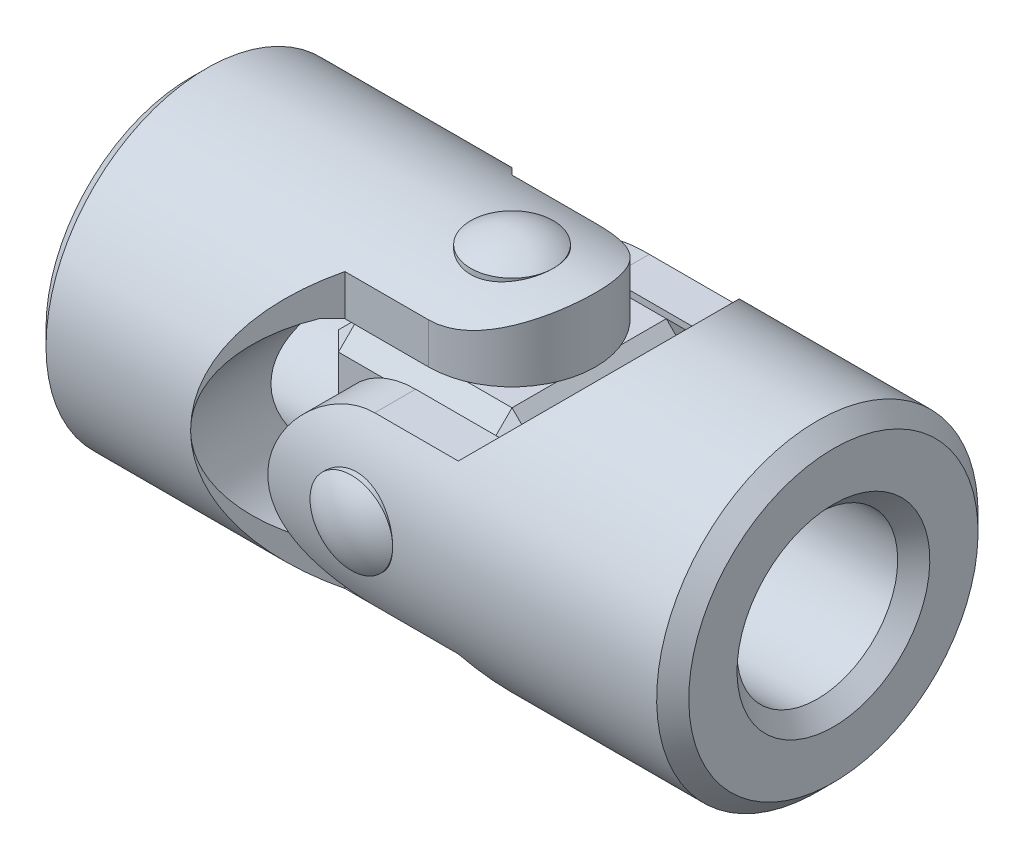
ISO-10303-21;
HEADER;
FILE_DESCRIPTION(('STEP AP214'),'2;1');
FILE_NAME('part.step','',(''),(''),'','','');
FILE_SCHEMA(('AUTOMOTIVE_DESIGN { 1 0 10303 214 1 1 1 1 }'));
ENDSEC;
DATA;
#1=APPLICATION_CONTEXT('core data for automotive mechanical design processes');
#2=APPLICATION_PROTOCOL_DEFINITION('international standard','automotive_design',2000,#1);
#3=PRODUCT_CONTEXT('',#1,'mechanical');
#4=PRODUCT('Part','Part','',(#3));
#5=PRODUCT_RELATED_PRODUCT_CATEGORY('part','',(#4));
#6=PRODUCT_DEFINITION_FORMATION('','',#4);
#7=PRODUCT_DEFINITION_CONTEXT('part definition',#1,'design');
#8=PRODUCT_DEFINITION('design','',#6,#7);
#9=PRODUCT_DEFINITION_SHAPE('','',#8);
#10=(LENGTH_UNIT() NAMED_UNIT(*) SI_UNIT(.MILLI.,.METRE.));
#11=(NAMED_UNIT(*) PLANE_ANGLE_UNIT() SI_UNIT($,.RADIAN.));
#12=(NAMED_UNIT(*) SI_UNIT($,.STERADIAN.) SOLID_ANGLE_UNIT());
#13=UNCERTAINTY_MEASURE_WITH_UNIT(LENGTH_MEASURE(1.E-05),#10,'distance_accuracy_value','');
#14=(GEOMETRIC_REPRESENTATION_CONTEXT(3) GLOBAL_UNCERTAINTY_ASSIGNED_CONTEXT((#13)) GLOBAL_UNIT_ASSIGNED_CONTEXT((#10,
#11,#12)) REPRESENTATION_CONTEXT('',''));
#15=CARTESIAN_POINT('',(0.,0.,0.));
#16=DIRECTION('',(0.,0.,1.));
#17=DIRECTION('',(1.,0.,0.));
#18=AXIS2_PLACEMENT_3D('',#15,#16,#17);
#19=CARTESIAN_POINT('',(0.,35.,0.));
#20=DIRECTION('',(0.,-1.,0.));
#21=DIRECTION('',(-1.,0.,0.));
#22=AXIS2_PLACEMENT_3D('',#19,#20,#21);
#23=CYLINDRICAL_SURFACE('',#22,9.);
#24=CARTESIAN_POINT('',(0.,35.,0.));
#25=DIRECTION('',(0.,1.,0.));
#26=DIRECTION('',(1.,0.,0.));
#27=AXIS2_PLACEMENT_3D('',#24,#25,#26);
#28=CIRCLE('',#27,9.);
#29=CARTESIAN_POINT('',(9.,35.,0.));
#30=VERTEX_POINT('',#29);
#31=EDGE_CURVE('P0_E10',#30,#30,#28,.T.);
#32=ORIENTED_EDGE('',*,*,#31,.F.);
#33=EDGE_LOOP('',(#32));
#34=FACE_BOUND('',#33,.T.);
#35=CARTESIAN_POINT('',(0.,-35.,0.));
#36=DIRECTION('',(0.,-1.,0.));
#37=DIRECTION('',(0.,0.,-1.));
#38=AXIS2_PLACEMENT_3D('',#35,#36,#37);
#39=CIRCLE('',#38,9.);
#40=CARTESIAN_POINT('',(0.,-35.,-9.));
#41=VERTEX_POINT('',#40);
#42=EDGE_CURVE('P0_E20',#41,#41,#39,.T.);
#43=ORIENTED_EDGE('',*,*,#42,.F.);
#44=EDGE_LOOP('',(#43));
#45=FACE_BOUND('',#44,.T.);
#46=ADVANCED_FACE('P0_F14',(#34,#45),#23,.T.);
#47=CARTESIAN_POINT('',(0.,21.9357142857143,0.));
#48=DIRECTION('',(0.,-1.,0.));
#49=DIRECTION('',(0.,0.,-1.));
#50=AXIS2_PLACEMENT_3D('',#47,#48,#49);
#51=SPHERICAL_SURFACE('',#50,15.8642857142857);
#52=ORIENTED_EDGE('',*,*,#31,.T.);
#53=EDGE_LOOP('',(#52));
#54=FACE_BOUND('',#53,.T.);
#55=ADVANCED_FACE('P0_F29',(#54),#51,.T.);
#56=CARTESIAN_POINT('',(0.,-21.9357142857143,0.));
#57=DIRECTION('',(0.,1.,0.));
#58=DIRECTION('',(0.,0.,-1.));
#59=AXIS2_PLACEMENT_3D('',#56,#57,#58);
#60=SPHERICAL_SURFACE('',#59,15.8642857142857);
#61=ORIENTED_EDGE('',*,*,#42,.T.);
#62=EDGE_LOOP('',(#61));
#63=FACE_BOUND('',#62,.T.);
#64=ADVANCED_FACE('P0_F26',(#63),#60,.T.);
#65=CLOSED_SHELL('',(#46,#55,#64));
#66=MANIFOLD_SOLID_BREP('P0_B1',#65);
#67=CARTESIAN_POINT('',(0.,0.,35.));
#68=DIRECTION('',(0.,0.,-1.));
#69=DIRECTION('',(-1.,0.,0.));
#70=AXIS2_PLACEMENT_3D('',#67,#68,#69);
#71=CYLINDRICAL_SURFACE('',#70,9.);
#72=CARTESIAN_POINT('',(0.,0.,35.));
#73=DIRECTION('',(0.,0.,1.));
#74=DIRECTION('',(1.,0.,0.));
#75=AXIS2_PLACEMENT_3D('',#72,#73,#74);
#76=CIRCLE('',#75,9.);
#77=CARTESIAN_POINT('',(9.,0.,35.));
#78=VERTEX_POINT('',#77);
#79=EDGE_CURVE('P1_E10',#78,#78,#76,.T.);
#80=ORIENTED_EDGE('',*,*,#79,.F.);
#81=EDGE_LOOP('',(#80));
#82=FACE_BOUND('',#81,.T.);
#83=CARTESIAN_POINT('',(0.,0.,-35.));
#84=DIRECTION('',(0.,0.,-1.));
#85=DIRECTION('',(0.,1.,0.));
#86=AXIS2_PLACEMENT_3D('',#83,#84,#85);
#87=CIRCLE('',#86,9.);
#88=CARTESIAN_POINT('',(0.,9.,-35.));
#89=VERTEX_POINT('',#88);
#90=EDGE_CURVE('P1_E20',#89,#89,#87,.T.);
#91=ORIENTED_EDGE('',*,*,#90,.F.);
#92=EDGE_LOOP('',(#91));
#93=FACE_BOUND('',#92,.T.);
#94=ADVANCED_FACE('P1_F14',(#82,#93),#71,.T.);
#95=CARTESIAN_POINT('',(0.,0.,21.9357142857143));
#96=DIRECTION('',(0.,0.,-1.));
#97=DIRECTION('',(0.,1.,0.));
#98=AXIS2_PLACEMENT_3D('',#95,#96,#97);
#99=SPHERICAL_SURFACE('',#98,15.8642857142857);
#100=ORIENTED_EDGE('',*,*,#79,.T.);
#101=EDGE_LOOP('',(#100));
#102=FACE_BOUND('',#101,.T.);
#103=ADVANCED_FACE('P1_F29',(#102),#99,.T.);
#104=CARTESIAN_POINT('',(0.,0.,-21.9357142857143));
#105=DIRECTION('',(0.,0.,1.));
#106=DIRECTION('',(0.,1.,0.));
#107=AXIS2_PLACEMENT_3D('',#104,#105,#106);
#108=SPHERICAL_SURFACE('',#107,15.8642857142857);
#109=ORIENTED_EDGE('',*,*,#90,.T.);
#110=EDGE_LOOP('',(#109));
#111=FACE_BOUND('',#110,.T.);
#112=ADVANCED_FACE('P1_F26',(#111),#108,.T.);
#113=CLOSED_SHELL('',(#94,#103,#112));
#114=MANIFOLD_SOLID_BREP('P1_B1',#113);
#115=CARTESIAN_POINT('',(0.,-35.,-18.2));
#116=DIRECTION('',(0.,0.,1.));
#117=DIRECTION('',(1.,0.,0.));
#118=AXIS2_PLACEMENT_3D('',#115,#116,#117);
#119=PLANE('',#118);
#120=DIRECTION('',(0.,1.,0.));
#121=VECTOR('',#120,1.);
#122=CARTESIAN_POINT('',(0.,-35.,-18.2));
#123=LINE('',#122,#121);
#124=CARTESIAN_POINT('',(0.,21.,-18.2));
#125=VERTEX_POINT('',#124);
#126=CARTESIAN_POINT('',(0.,29.8958191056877,-18.2));
#127=VERTEX_POINT('',#126);
#128=EDGE_CURVE('P2_E285',#125,#127,#123,.T.);
#129=ORIENTED_EDGE('',*,*,#128,.F.);
#130=DIRECTION('',(-1.,0.,0.));
#131=VECTOR('',#130,1.);
#132=CARTESIAN_POINT('',(0.,21.,-18.2));
#133=LINE('',#132,#131);
#134=CARTESIAN_POINT('',(-18.2000000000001,21.,-18.2));
#135=VERTEX_POINT('',#134);
#136=EDGE_CURVE('P2_E137',#125,#135,#133,.T.);
#137=ORIENTED_EDGE('',*,*,#136,.T.);
#138=DIRECTION('',(0.,1.,0.));
#139=VECTOR('',#138,1.);
#140=CARTESIAN_POINT('',(-18.2000000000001,-35.,-18.2));
#141=LINE('',#140,#139);
#142=CARTESIAN_POINT('',(-18.2000000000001,29.8958191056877,-18.2));
#143=VERTEX_POINT('',#142);
#144=EDGE_CURVE('P2_E292',#135,#143,#141,.T.);
#145=ORIENTED_EDGE('',*,*,#144,.T.);
#146=DIRECTION('',(1.,0.,0.));
#147=VECTOR('',#146,1.);
#148=CARTESIAN_POINT('',(-70.,29.8958191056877,-18.2));
#149=LINE('',#148,#147);
#150=EDGE_CURVE('P2_E230',#127,#143,#149,.F.);
#151=ORIENTED_EDGE('',*,*,#150,.F.);
#152=EDGE_LOOP('',(#129,#137,#145,#151));
#153=FACE_BOUND('',#152,.T.);
#154=ADVANCED_FACE('P2_F16',(#153),#119,.F.);
#155=CARTESIAN_POINT('',(-18.2000000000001,-35.,-18.2));
#156=DIRECTION('',(-0.707106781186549,0.,0.707106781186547));
#157=DIRECTION('',(0.707106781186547,0.,0.707106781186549));
#158=AXIS2_PLACEMENT_3D('',#155,#156,#157);
#159=PLANE('',#158);
#160=ORIENTED_EDGE('',*,*,#144,.F.);
#161=DIRECTION('',(-0.707106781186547,0.,-0.707106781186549));
#162=VECTOR('',#161,1.);
#163=CARTESIAN_POINT('',(-18.2000000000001,21.,-18.2));
#164=LINE('',#163,#162);
#165=CARTESIAN_POINT('',(-21.,21.,-20.9999999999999));
#166=VERTEX_POINT('',#165);
#167=EDGE_CURVE('P2_E140',#135,#166,#164,.T.);
#168=ORIENTED_EDGE('',*,*,#167,.T.);
#169=CARTESIAN_POINT('',(-12.25,0.,-12.2499999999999));
#170=DIRECTION('',(-0.707106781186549,0.,0.707106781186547));
#171=DIRECTION('',(-0.707106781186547,0.,-0.707106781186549));
#172=AXIS2_PLACEMENT_3D('',#169,#170,#171);
#173=ELLIPSE('',#172,32.173358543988,22.75);
#174=CARTESIAN_POINT('',(-35.,0.,-35.));
#175=VERTEX_POINT('',#174);
#176=EDGE_CURVE('P2_E146',#166,#175,#173,.T.);
#177=ORIENTED_EDGE('',*,*,#176,.T.);
#178=CARTESIAN_POINT('',(-1.38777878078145E-13,0.,0.));
#179=DIRECTION('',(-0.707106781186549,0.,0.707106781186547));
#180=DIRECTION('',(0.707106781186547,0.,0.707106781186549));
#181=AXIS2_PLACEMENT_3D('',#178,#179,#180);
#182=ELLIPSE('',#181,49.4974746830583,35.);
#183=EDGE_CURVE('P2_E234',#143,#175,#182,.T.);
#184=ORIENTED_EDGE('',*,*,#183,.F.);
#185=EDGE_LOOP('',(#160,#168,#177,#184));
#186=FACE_BOUND('',#185,.T.);
#187=ADVANCED_FACE('P2_F183',(#186),#159,.F.);
#188=CARTESIAN_POINT('',(-18.2000000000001,-35.,18.2));
#189=DIRECTION('',(-0.707106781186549,0.,-0.707106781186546));
#190=DIRECTION('',(-0.707106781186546,0.,0.707106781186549));
#191=AXIS2_PLACEMENT_3D('',#188,#189,#190);
#192=PLANE('',#191);
#193=CARTESIAN_POINT('',(-12.25,0.,12.2499999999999));
#194=DIRECTION('',(-0.707106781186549,0.,-0.707106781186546));
#195=DIRECTION('',(0.707106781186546,0.,-0.707106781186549));
#196=AXIS2_PLACEMENT_3D('',#193,#194,#195);
#197=ELLIPSE('',#196,32.173358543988,22.75);
#198=CARTESIAN_POINT('',(-35.,0.,35.));
#199=VERTEX_POINT('',#198);
#200=CARTESIAN_POINT('',(-21.,21.,21.));
#201=VERTEX_POINT('',#200);
#202=EDGE_CURVE('P2_E107',#199,#201,#197,.T.);
#203=ORIENTED_EDGE('',*,*,#202,.T.);
#204=DIRECTION('',(0.707106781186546,0.,-0.707106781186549));
#205=VECTOR('',#204,1.);
#206=CARTESIAN_POINT('',(-18.2000000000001,21.,18.2));
#207=LINE('',#206,#205);
#208=CARTESIAN_POINT('',(-18.2000000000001,21.,18.2));
#209=VERTEX_POINT('',#208);
#210=EDGE_CURVE('P2_E134',#201,#209,#207,.T.);
#211=ORIENTED_EDGE('',*,*,#210,.T.);
#212=DIRECTION('',(0.,1.,0.));
#213=VECTOR('',#212,1.);
#214=CARTESIAN_POINT('',(-18.2000000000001,-35.,18.2));
#215=LINE('',#214,#213);
#216=CARTESIAN_POINT('',(-18.2000000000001,29.8958191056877,18.2));
#217=VERTEX_POINT('',#216);
#218=EDGE_CURVE('P2_E295',#209,#217,#215,.T.);
#219=ORIENTED_EDGE('',*,*,#218,.T.);
#220=CARTESIAN_POINT('',(-1.11022302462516E-13,0.,0.));
#221=DIRECTION('',(-0.707106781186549,0.,-0.707106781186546));
#222=DIRECTION('',(0.707106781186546,0.,-0.707106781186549));
#223=AXIS2_PLACEMENT_3D('',#220,#221,#222);
#224=ELLIPSE('',#223,49.4974746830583,35.);
#225=EDGE_CURVE('P2_E243',#199,#217,#224,.T.);
#226=ORIENTED_EDGE('',*,*,#225,.F.);
#227=EDGE_LOOP('',(#203,#211,#219,#226));
#228=FACE_BOUND('',#227,.T.);
#229=ADVANCED_FACE('P2_F187',(#228),#192,.F.);
#230=CARTESIAN_POINT('',(0.,-35.,18.2));
#231=DIRECTION('',(0.,0.,-1.));
#232=DIRECTION('',(-1.,0.,0.));
#233=AXIS2_PLACEMENT_3D('',#230,#231,#232);
#234=PLANE('',#233);
#235=ORIENTED_EDGE('',*,*,#218,.F.);
#236=DIRECTION('',(1.,0.,0.));
#237=VECTOR('',#236,1.);
#238=CARTESIAN_POINT('',(0.,21.,18.2));
#239=LINE('',#238,#237);
#240=CARTESIAN_POINT('',(0.,21.,18.2));
#241=VERTEX_POINT('',#240);
#242=EDGE_CURVE('P2_E131',#209,#241,#239,.T.);
#243=ORIENTED_EDGE('',*,*,#242,.T.);
#244=DIRECTION('',(0.,1.,0.));
#245=VECTOR('',#244,1.);
#246=CARTESIAN_POINT('',(0.,-35.,18.2));
#247=LINE('',#246,#245);
#248=CARTESIAN_POINT('',(0.,29.8958191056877,18.2));
#249=VERTEX_POINT('',#248);
#250=EDGE_CURVE('P2_E157',#241,#249,#247,.T.);
#251=ORIENTED_EDGE('',*,*,#250,.T.);
#252=DIRECTION('',(1.,0.,0.));
#253=VECTOR('',#252,1.);
#254=CARTESIAN_POINT('',(-70.,29.8958191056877,18.2));
#255=LINE('',#254,#253);
#256=EDGE_CURVE('P2_E247',#217,#249,#255,.T.);
#257=ORIENTED_EDGE('',*,*,#256,.F.);
#258=EDGE_LOOP('',(#235,#243,#251,#257));
#259=FACE_BOUND('',#258,.T.);
#260=ADVANCED_FACE('P2_F190',(#259),#234,.F.);
#261=CARTESIAN_POINT('',(0.,-35.,0.));
#262=DIRECTION('',(0.,1.,0.));
#263=DIRECTION('',(0.,0.,-1.));
#264=AXIS2_PLACEMENT_3D('',#261,#262,#263);
#265=CYLINDRICAL_SURFACE('',#264,18.2);
#266=ORIENTED_EDGE('',*,*,#250,.F.);
#267=CARTESIAN_POINT('',(0.,21.,0.));
#268=DIRECTION('',(0.,1.,0.));
#269=DIRECTION('',(1.,0.,0.));
#270=AXIS2_PLACEMENT_3D('',#267,#268,#269);
#271=CIRCLE('',#270,18.2);
#272=EDGE_CURVE('P2_E111',#241,#125,#271,.T.);
#273=ORIENTED_EDGE('',*,*,#272,.T.);
#274=ORIENTED_EDGE('',*,*,#128,.T.);
#275=CARTESIAN_POINT('',(0.,29.8958191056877,18.2));
#276=CARTESIAN_POINT('',(0.236826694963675,29.8958132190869,18.2000019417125));
#277=CARTESIAN_POINT('',(0.473619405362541,29.8986344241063,18.1953764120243));
#278=CARTESIAN_POINT('',(0.946701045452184,29.909870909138,18.176902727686));
#279=CARTESIAN_POINT('',(1.18298999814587,29.9182859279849,18.1630550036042));
#280=CARTESIAN_POINT('',(1.89005144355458,29.9518115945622,18.1077599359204));
#281=CARTESIAN_POINT('',(2.3594511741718,29.9852030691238,18.0525605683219));
#282=CARTESIAN_POINT('',(3.28768578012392,30.0725204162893,17.9067198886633));
#283=CARTESIAN_POINT('',(3.74656784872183,30.1263188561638,17.8162984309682));
#284=CARTESIAN_POINT('',(4.65365333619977,30.2525161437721,17.6011589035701));
#285=CARTESIAN_POINT('',(5.10185537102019,30.3249173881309,17.4764364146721));
#286=CARTESIAN_POINT('',(5.98366660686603,30.4856803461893,17.19446209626));
#287=CARTESIAN_POINT('',(6.41730895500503,30.5740024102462,17.0372909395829));
#288=CARTESIAN_POINT('',(7.26890010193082,30.7640144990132,16.6917422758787));
#289=CARTESIAN_POINT('',(7.6868491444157,30.8657043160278,16.503365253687));
#290=CARTESIAN_POINT('',(8.5057848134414,31.0797668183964,16.0966133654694));
#291=CARTESIAN_POINT('',(8.90674655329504,31.1921544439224,15.8781963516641));
#292=CARTESIAN_POINT('',(9.68964377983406,31.4246622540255,15.412924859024));
#293=CARTESIAN_POINT('',(10.0715721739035,31.5447852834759,15.1660598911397));
#294=CARTESIAN_POINT('',(10.8478717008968,31.8007919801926,14.622167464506));
#295=CARTESIAN_POINT('',(11.2403386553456,31.9371282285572,14.3226325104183));
#296=CARTESIAN_POINT('',(11.9992222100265,32.2120509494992,13.6931275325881));
#297=CARTESIAN_POINT('',(12.365637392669,32.3506375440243,13.363155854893));
#298=CARTESIAN_POINT('',(13.0708836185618,32.6267169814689,12.6741903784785));
#299=CARTESIAN_POINT('',(13.4097025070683,32.7642093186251,12.3151839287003));
#300=CARTESIAN_POINT('',(14.0576987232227,33.0347126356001,11.5699970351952));
#301=CARTESIAN_POINT('',(14.3668858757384,33.1677250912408,11.1838256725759));
#302=CARTESIAN_POINT('',(14.9758685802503,33.435854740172,10.3560009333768));
#303=CARTESIAN_POINT('',(15.273227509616,33.5703838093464,9.91235832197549));
#304=CARTESIAN_POINT('',(15.8292007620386,33.8269532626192,8.99792870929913));
#305=CARTESIAN_POINT('',(16.0878126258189,33.9489928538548,8.52713998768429));
#306=CARTESIAN_POINT('',(16.5635647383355,34.177011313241,7.56160006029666));
#307=CARTESIAN_POINT('',(16.7807261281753,34.2829983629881,7.06686123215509));
#308=CARTESIAN_POINT('',(17.1711621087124,34.4757880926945,6.05675432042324));
#309=CARTESIAN_POINT('',(17.344441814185,34.5625930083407,5.54138864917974));
#310=CARTESIAN_POINT('',(17.633386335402,34.7085291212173,4.53398941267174));
#311=CARTESIAN_POINT('',(17.752426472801,34.7692609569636,4.04315488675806));
#312=CARTESIAN_POINT('',(17.9495271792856,34.870307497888,3.05124469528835));
#313=CARTESIAN_POINT('',(18.0275896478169,34.9106231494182,2.55016950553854));
#314=CARTESIAN_POINT('',(18.1416241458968,34.9696460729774,1.54225931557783));
#315=CARTESIAN_POINT('',(18.1776189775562,34.988365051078,1.03542758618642));
#316=CARTESIAN_POINT('',(18.2070705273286,35.0036747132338,0.020209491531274));
#317=CARTESIAN_POINT('',(18.2005301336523,35.000266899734,-0.48817676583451));
#318=CARTESIAN_POINT('',(18.1476350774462,34.9727929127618,-1.45428244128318));
#319=CARTESIAN_POINT('',(18.1050809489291,34.9506988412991,-1.91227222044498));
#320=CARTESIAN_POINT('',(17.9856613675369,34.8889867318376,-2.8225265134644));
#321=CARTESIAN_POINT('',(17.9087985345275,34.8493700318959,-3.27479146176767));
#322=CARTESIAN_POINT('',(17.7216240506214,34.7535538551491,-4.1705417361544));
#323=CARTESIAN_POINT('',(17.6113119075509,34.6973541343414,-4.6140269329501));
#324=CARTESIAN_POINT('',(17.3583917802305,34.5696667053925,-5.48942910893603));
#325=CARTESIAN_POINT('',(17.215782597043,34.4981784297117,-5.92134565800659));
#326=CARTESIAN_POINT('',(16.8976136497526,34.340501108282,-6.77653724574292));
#327=CARTESIAN_POINT('',(16.7216570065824,34.2541362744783,-7.19963193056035));
#328=CARTESIAN_POINT('',(16.3395531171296,34.0692390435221,-8.02916924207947));
#329=CARTESIAN_POINT('',(16.1334059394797,33.9707066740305,-8.43561190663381));
#330=CARTESIAN_POINT('',(15.6924424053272,33.7635137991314,-9.23004339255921));
#331=CARTESIAN_POINT('',(15.4576194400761,33.6548509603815,-9.61802793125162));
#332=CARTESIAN_POINT('',(14.9608746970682,33.4296091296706,-10.3738507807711));
#333=CARTESIAN_POINT('',(14.6989501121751,33.3130293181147,-10.7416869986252));
#334=CARTESIAN_POINT('',(14.1220245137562,33.0623272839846,-11.4914739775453));
#335=CARTESIAN_POINT('',(13.8043351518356,32.9276162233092,-11.8711619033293));
#336=CARTESIAN_POINT('',(13.1398247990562,32.654605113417,-12.6027475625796));
#337=CARTESIAN_POINT('',(12.7930019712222,32.516304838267,-12.9546435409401));
#338=CARTESIAN_POINT('',(12.0716095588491,32.2393042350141,-13.6293947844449));
#339=CARTESIAN_POINT('',(11.6970125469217,32.1006036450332,-13.9522206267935));
#340=CARTESIAN_POINT('',(10.9220806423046,31.8264123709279,-14.566836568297));
#341=CARTESIAN_POINT('',(10.5217462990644,31.6909216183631,-14.8586273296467));
#342=CARTESIAN_POINT('',(9.66665060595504,31.4170061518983,-15.4298186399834));
#343=CARTESIAN_POINT('',(9.21005207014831,31.2790996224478,-15.7067260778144));
#344=CARTESIAN_POINT('',(8.27139936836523,31.0156926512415,-16.2206736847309));
#345=CARTESIAN_POINT('',(7.78934169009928,30.8901939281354,-16.4577083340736));
#346=CARTESIAN_POINT('',(6.80374442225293,30.6565213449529,-16.8889832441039));
#347=CARTESIAN_POINT('',(6.30025639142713,30.548308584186,-17.0833199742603));
#348=CARTESIAN_POINT('',(5.27433011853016,30.353342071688,-17.4273877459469));
#349=CARTESIAN_POINT('',(4.75190007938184,30.2665791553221,-17.5771378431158));
#350=CARTESIAN_POINT('',(3.87925449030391,30.1445364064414,-17.7852698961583));
#351=CARTESIAN_POINT('',(3.53324532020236,30.1018894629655,-17.8572519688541));
#352=CARTESIAN_POINT('',(2.83649424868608,30.0280829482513,-17.9810852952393));
#353=CARTESIAN_POINT('',(2.48575369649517,29.9969201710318,-18.0329421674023));
#354=CARTESIAN_POINT('',(1.78010770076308,29.9466997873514,-18.116226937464));
#355=CARTESIAN_POINT('',(1.42519409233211,29.9276723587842,-18.1476039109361));
#356=CARTESIAN_POINT('',(0.713527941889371,29.9022042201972,-18.1895102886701));
#357=CARTESIAN_POINT('',(0.356774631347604,29.8957692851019,-18.2000301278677));
#358=CARTESIAN_POINT('',(0.,29.8958191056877,-18.2));
#359=B_SPLINE_CURVE_WITH_KNOTS('',3,(#275,#276,#277,#278,#279,#280,#281,#282,#283,#284,#285,
#286,#287,#288,#289,#290,#291,#292,#293,#294,#295,#296,#297,#298,#299,#300,#301,#302,#303,#304,
#305,#306,#307,#308,#309,#310,#311,#312,#313,#314,#315,#316,#317,#318,#319,#320,#321,#322,#323,
#324,#325,#326,#327,#328,#329,#330,#331,#332,#333,#334,#335,#336,#337,#338,#339,#340,#341,#342,
#343,#344,#345,#346,#347,#348,#349,#350,#351,#352,#353,#354,#355,#356,#357,#358),.UNSPECIFIED.,
.F.,.F.,(4,2,2,2,2,2,2,2,2,2,2,2,2,2,2,2,2,2,2,2,2,2,2,2,2,2,2,2,2,2,2,2,2,2,2,2,2,2,2,2,2,4),
(0.,0.710351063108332,1.42066896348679,2.84001168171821,4.250633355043,5.66143685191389,
7.06877420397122,8.47608969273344,9.88540025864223,11.295232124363,12.830191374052,
14.3652340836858,15.9009492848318,17.4361535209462,19.0863073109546,20.736565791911,
22.3859803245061,24.0352025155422,25.5592180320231,27.0831628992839,28.6062813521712,
30.1292963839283,31.5091405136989,32.8888792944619,34.2686383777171,35.6484486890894,
37.0458488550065,38.4432458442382,39.8409654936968,41.2388300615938,42.776385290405,
44.3140375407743,45.8532290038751,47.3923876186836,49.0448442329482,50.6975294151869,
52.3464413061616,53.9946474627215,55.0618879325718,56.128830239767,57.198415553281,
58.2684912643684),.UNSPECIFIED.);
#360=EDGE_CURVE('P2_E205',#249,#127,#359,.T.);
#361=ORIENTED_EDGE('',*,*,#360,.F.);
#362=EDGE_LOOP('',(#266,#273,#274,#361));
#363=FACE_BOUND('',#362,.T.);
#364=ADVANCED_FACE('P2_F194',(#363),#265,.T.);
#365=CARTESIAN_POINT('',(-70.,0.,0.));
#366=DIRECTION('',(-1.,0.,0.));
#367=DIRECTION('',(0.,0.,1.));
#368=AXIS2_PLACEMENT_3D('',#365,#366,#367);
#369=PLANE('',#368);
#370=CARTESIAN_POINT('',(-70.,0.,0.));
#371=DIRECTION('',(-1.,0.,0.));
#372=DIRECTION('',(0.,0.,1.));
#373=AXIS2_PLACEMENT_3D('',#370,#371,#372);
#374=CIRCLE('',#373,21.);
#375=CARTESIAN_POINT('',(-70.,0.,21.));
#376=VERTEX_POINT('',#375);
#377=EDGE_CURVE('P2_E24',#376,#376,#374,.F.);
#378=ORIENTED_EDGE('',*,*,#377,.T.);
#379=EDGE_LOOP('',(#378));
#380=FACE_BOUND('',#379,.T.);
#381=CARTESIAN_POINT('',(-70.,0.,0.));
#382=DIRECTION('',(-1.,0.,0.));
#383=DIRECTION('',(0.,0.,1.));
#384=AXIS2_PLACEMENT_3D('',#381,#382,#383);
#385=CIRCLE('',#384,31.5);
#386=CARTESIAN_POINT('',(-70.,0.,31.5));
#387=VERTEX_POINT('',#386);
#388=EDGE_CURVE('P2_E257',#387,#387,#385,.T.);
#389=ORIENTED_EDGE('',*,*,#388,.T.);
#390=EDGE_LOOP('',(#389));
#391=FACE_BOUND('',#390,.T.);
#392=ADVANCED_FACE('P2_F216',(#380,#391),#369,.T.);
#393=CARTESIAN_POINT('',(-70.,0.,0.));
#394=DIRECTION('',(1.,0.,0.));
#395=DIRECTION('',(0.,0.,-1.));
#396=AXIS2_PLACEMENT_3D('',#393,#394,#395);
#397=CYLINDRICAL_SURFACE('',#396,35.);
#398=CARTESIAN_POINT('',(-66.5,0.,0.));
#399=DIRECTION('',(-1.,0.,0.));
#400=DIRECTION('',(0.,0.,1.));
#401=AXIS2_PLACEMENT_3D('',#398,#399,#400);
#402=CIRCLE('',#401,35.);
#403=CARTESIAN_POINT('',(-66.5,0.,35.));
#404=VERTEX_POINT('',#403);
#405=EDGE_CURVE('P2_E11',#404,#404,#402,.F.);
#406=ORIENTED_EDGE('',*,*,#405,.T.);
#407=EDGE_LOOP('',(#406));
#408=FACE_BOUND('',#407,.T.);
#409=CARTESIAN_POINT('',(9.,-35.,0.));
#410=CARTESIAN_POINT('',(9.00000786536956,-35.0000048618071,-0.248473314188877));
#411=CARTESIAN_POINT('',(8.98970884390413,-34.9973502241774,-0.496862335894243));
#412=CARTESIAN_POINT('',(8.948618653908,-34.9868165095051,-0.991897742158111));
#413=CARTESIAN_POINT('',(8.91782533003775,-34.9789368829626,-1.23854394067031));
#414=CARTESIAN_POINT('',(8.83598743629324,-34.9581624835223,-1.72829482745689));
#415=CARTESIAN_POINT('',(8.78493724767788,-34.9452663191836,-1.97139851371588));
#416=CARTESIAN_POINT('',(8.66299222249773,-34.9148098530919,-2.45237331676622));
#417=CARTESIAN_POINT('',(8.59209006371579,-34.8972478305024,-2.69024246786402));
#418=CARTESIAN_POINT('',(8.43115276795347,-34.8579727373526,-3.15862098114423));
#419=CARTESIAN_POINT('',(8.34114912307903,-34.8362665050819,-3.38914174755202));
#420=CARTESIAN_POINT('',(8.14259681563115,-34.7892595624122,-3.84177242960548));
#421=CARTESIAN_POINT('',(8.03404120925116,-34.7639575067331,-4.06387915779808));
#422=CARTESIAN_POINT('',(7.79925317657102,-34.7104493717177,-4.49805922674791));
#423=CARTESIAN_POINT('',(7.67302772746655,-34.6822444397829,-4.71013648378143));
#424=CARTESIAN_POINT('',(7.40369132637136,-34.6236532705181,-5.12310014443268));
#425=CARTESIAN_POINT('',(7.26057265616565,-34.5932660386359,-5.32398137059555));
#426=CARTESIAN_POINT('',(6.95550786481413,-34.5305137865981,-5.71699130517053));
#427=CARTESIAN_POINT('',(6.79324917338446,-34.4981217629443,-5.90887313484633));
#428=CARTESIAN_POINT('',(6.4533887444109,-34.4328104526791,-6.27827517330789));
#429=CARTESIAN_POINT('',(6.27579362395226,-34.3998913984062,-6.45580151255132));
#430=CARTESIAN_POINT('',(5.90626156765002,-34.3343974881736,-6.79552035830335));
#431=CARTESIAN_POINT('',(5.71431714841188,-34.3018228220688,-6.95770476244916));
#432=CARTESIAN_POINT('',(5.3174829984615,-34.2379511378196,-7.26549408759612));
#433=CARTESIAN_POINT('',(5.11259813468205,-34.2066536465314,-7.41110518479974));
#434=CARTESIAN_POINT('',(4.68771054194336,-34.145713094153,-7.68703928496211));
#435=CARTESIAN_POINT('',(4.46751615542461,-34.1161052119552,-7.81707518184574));
#436=CARTESIAN_POINT('',(4.0166362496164,-34.0599964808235,-8.05803609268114));
#437=CARTESIAN_POINT('',(3.78595481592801,-34.0334944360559,-8.16896846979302));
#438=CARTESIAN_POINT('',(3.31560860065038,-33.9843870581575,-8.37091656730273));
#439=CARTESIAN_POINT('',(3.07594321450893,-33.9617819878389,-8.46193094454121));
#440=CARTESIAN_POINT('',(2.58936863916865,-33.9211743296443,-8.62327439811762));
#441=CARTESIAN_POINT('',(2.34245963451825,-33.9031716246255,-8.69360400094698));
#442=CARTESIAN_POINT('',(1.84850089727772,-33.8726656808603,-8.8117060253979));
#443=CARTESIAN_POINT('',(1.60156417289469,-33.8600543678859,-8.85992330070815));
#444=CARTESIAN_POINT('',(1.10430878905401,-33.8401801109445,-8.93553262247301));
#445=CARTESIAN_POINT('',(0.853990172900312,-33.8329170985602,-8.96292493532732));
#446=CARTESIAN_POINT('',(0.351876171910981,-33.8239680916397,-8.99663759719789));
#447=CARTESIAN_POINT('',(0.10008101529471,-33.8222812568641,-9.0029611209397));
#448=CARTESIAN_POINT('',(-0.403126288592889,-33.8245356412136,-8.99448768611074));
#449=CARTESIAN_POINT('',(-0.654538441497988,-33.8284767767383,-8.9796910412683));
#450=CARTESIAN_POINT('',(-1.14858264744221,-33.8416880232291,-8.9297700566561));
#451=CARTESIAN_POINT('',(-1.39127309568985,-33.8508170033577,-8.8951839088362));
#452=CARTESIAN_POINT('',(-1.8728831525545,-33.8740286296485,-8.80637771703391));
#453=CARTESIAN_POINT('',(-2.11180137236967,-33.8881130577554,-8.75215061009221));
#454=CARTESIAN_POINT('',(-2.58409624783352,-33.9208203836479,-8.6245160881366));
#455=CARTESIAN_POINT('',(-2.81747374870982,-33.9394425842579,-8.5511116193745));
#456=CARTESIAN_POINT('',(-3.27717794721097,-33.9806927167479,-8.38568916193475));
#457=CARTESIAN_POINT('',(-3.5035043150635,-34.0033208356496,-8.29367030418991));
#458=CARTESIAN_POINT('',(-3.94997687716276,-34.0522033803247,-8.09064001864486));
#459=CARTESIAN_POINT('',(-4.17003265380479,-34.0784935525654,-7.97943842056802));
#460=CARTESIAN_POINT('',(-4.60003168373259,-34.1337782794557,-7.739530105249));
#461=CARTESIAN_POINT('',(-4.80997466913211,-34.1627729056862,-7.61082292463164));
#462=CARTESIAN_POINT('',(-5.21845743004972,-34.2226747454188,-7.33677051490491));
#463=CARTESIAN_POINT('',(-5.41699557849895,-34.2535822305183,-7.19142292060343));
#464=CARTESIAN_POINT('',(-5.80141061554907,-34.3164741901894,-6.88505968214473));
#465=CARTESIAN_POINT('',(-5.98728723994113,-34.3484586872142,-6.72404371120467));
#466=CARTESIAN_POINT('',(-6.35064935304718,-34.4136286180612,-6.382266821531));
#467=CARTESIAN_POINT('',(-6.52771040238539,-34.4468210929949,-6.20105569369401));
#468=CARTESIAN_POINT('',(-6.86598567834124,-34.5125226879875,-5.82428859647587));
#469=CARTESIAN_POINT('',(-7.027199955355,-34.5450318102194,-5.62873267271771));
#470=CARTESIAN_POINT('',(-7.33268930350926,-34.6084671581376,-5.2245424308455));
#471=CARTESIAN_POINT('',(-7.4769631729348,-34.6393932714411,-5.01590718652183));
#472=CARTESIAN_POINT('',(-7.74752240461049,-34.6987993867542,-4.58695899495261));
#473=CARTESIAN_POINT('',(-7.87380845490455,-34.7272794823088,-4.36664649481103));
#474=CARTESIAN_POINT('',(-8.10792809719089,-34.7811078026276,-3.91490516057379));
#475=CARTESIAN_POINT('',(-8.21568474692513,-34.8064428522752,-3.68343485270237));
#476=CARTESIAN_POINT('',(-8.41122355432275,-34.8531155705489,-3.21192013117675));
#477=CARTESIAN_POINT('',(-8.49901361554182,-34.8744548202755,-2.97187915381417));
#478=CARTESIAN_POINT('',(-8.65394687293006,-34.9125357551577,-2.48485489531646));
#479=CARTESIAN_POINT('',(-8.72108931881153,-34.9292772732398,-2.23787136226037));
#480=CARTESIAN_POINT('',(-8.83413905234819,-34.9576746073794,-1.73880524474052));
#481=CARTESIAN_POINT('',(-8.88004689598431,-34.9693305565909,-1.486722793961));
#482=CARTESIAN_POINT('',(-8.94927092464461,-34.9869741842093,-0.986225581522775));
#483=CARTESIAN_POINT('',(-8.97316349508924,-34.9931063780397,-0.737895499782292));
#484=CARTESIAN_POINT('',(-9.00025156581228,-35.0000622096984,-0.240036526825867));
#485=CARTESIAN_POINT('',(-9.00344743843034,-35.0008859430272,0.0094923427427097));
#486=CARTESIAN_POINT('',(-8.98911530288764,-34.9972019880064,0.507891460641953));
#487=CARTESIAN_POINT('',(-8.97158911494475,-34.9926947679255,0.75676176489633));
#488=CARTESIAN_POINT('',(-8.91596831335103,-34.9784758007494,1.25204117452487));
#489=CARTESIAN_POINT('',(-8.87787378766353,-34.9687640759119,1.49845029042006));
#490=CARTESIAN_POINT('',(-8.78221646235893,-34.9446022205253,1.98310513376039));
#491=CARTESIAN_POINT('',(-8.72497543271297,-34.9302305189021,2.22141840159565));
#492=CARTESIAN_POINT('',(-8.59133220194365,-34.8970887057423,2.6923876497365));
#493=CARTESIAN_POINT('',(-8.51492308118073,-34.8783170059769,2.92504155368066));
#494=CARTESIAN_POINT('',(-8.34357198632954,-34.8368811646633,3.38298064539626));
#495=CARTESIAN_POINT('',(-8.24863545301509,-34.814218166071,3.60826797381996));
#496=CARTESIAN_POINT('',(-8.04088067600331,-34.7655801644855,4.05016948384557));
#497=CARTESIAN_POINT('',(-7.9280556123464,-34.7396038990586,4.2667803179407));
#498=CARTESIAN_POINT('',(-7.68314663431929,-34.6845246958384,4.69370984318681));
#499=CARTESIAN_POINT('',(-7.55075077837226,-34.655373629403,4.90384338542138));
#500=CARTESIAN_POINT('',(-7.26914088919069,-34.5951078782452,5.31235996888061));
#501=CARTESIAN_POINT('',(-7.11991928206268,-34.5639923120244,5.51073765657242));
#502=CARTESIAN_POINT('',(-6.80568117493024,-34.5006321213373,5.89442134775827));
#503=CARTESIAN_POINT('',(-6.64066214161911,-34.4683873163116,6.07972524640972));
#504=CARTESIAN_POINT('',(-6.29599519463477,-34.403646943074,6.43598076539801));
#505=CARTESIAN_POINT('',(-6.11635358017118,-34.3711514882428,6.60693850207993));
#506=CARTESIAN_POINT('',(-5.73856355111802,-34.3059119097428,6.93783845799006));
#507=CARTESIAN_POINT('',(-5.54005049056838,-34.2731840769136,7.09736788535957));
#508=CARTESIAN_POINT('',(-5.13013182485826,-34.209315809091,7.39908717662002));
#509=CARTESIAN_POINT('',(-4.9187310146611,-34.1781747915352,7.54128343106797));
#510=CARTESIAN_POINT('',(-4.4842959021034,-34.1183618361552,7.80743263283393));
#511=CARTESIAN_POINT('',(-4.26125734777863,-34.0896908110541,7.93137884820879));
#512=CARTESIAN_POINT('',(-3.80522478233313,-34.0356945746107,8.15998113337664));
#513=CARTESIAN_POINT('',(-3.57223483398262,-34.0103680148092,8.26464498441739));
#514=CARTESIAN_POINT('',(-3.09921302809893,-33.9639522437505,8.45336283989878));
#515=CARTESIAN_POINT('',(-2.85922960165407,-33.9428394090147,8.53753236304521));
#516=CARTESIAN_POINT('',(-2.37265739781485,-33.9053193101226,8.6853407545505));
#517=CARTESIAN_POINT('',(-2.12606862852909,-33.8889120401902,8.74897964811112));
#518=CARTESIAN_POINT('',(-1.6281507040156,-33.8613216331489,8.85516296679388));
#519=CARTESIAN_POINT('',(-1.37682248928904,-33.8501374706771,8.8977115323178));
#520=CARTESIAN_POINT('',(-0.871280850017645,-33.8333462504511,8.96134867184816));
#521=CARTESIAN_POINT('',(-0.617067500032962,-33.8277390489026,8.98243779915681));
#522=CARTESIAN_POINT('',(-0.11547305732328,-33.8223648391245,9.00265170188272));
#523=CARTESIAN_POINT('',(0.13188023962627,-33.8224251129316,9.00242605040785));
#524=CARTESIAN_POINT('',(0.625665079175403,-33.8279545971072,8.98162591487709));
#525=CARTESIAN_POINT('',(0.872096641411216,-33.8334236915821,8.96105186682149));
#526=CARTESIAN_POINT('',(1.36225310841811,-33.8496046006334,8.89973426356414));
#527=CARTESIAN_POINT('',(1.60597809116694,-33.8603162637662,8.85899129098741));
#528=CARTESIAN_POINT('',(2.08899963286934,-33.8866604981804,8.75768091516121));
#529=CARTESIAN_POINT('',(2.32829616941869,-33.9022930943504,8.69711341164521));
#530=CARTESIAN_POINT('',(2.79917230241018,-33.9378935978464,8.55713446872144));
#531=CARTESIAN_POINT('',(3.03079370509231,-33.9578308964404,8.47785572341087));
#532=CARTESIAN_POINT('',(3.48658068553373,-34.0015405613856,8.30081618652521));
#533=CARTESIAN_POINT('',(3.71074353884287,-34.0253143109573,8.20304872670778));
#534=CARTESIAN_POINT('',(4.15006657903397,-34.0760244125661,7.98977883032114));
#535=CARTESIAN_POINT('',(4.36522753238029,-34.1029604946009,7.87427790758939));
#536=CARTESIAN_POINT('',(4.78523253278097,-34.1592612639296,7.62633758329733));
#537=CARTESIAN_POINT('',(4.99007606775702,-34.1886260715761,7.49389734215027));
#538=CARTESIAN_POINT('',(5.39366112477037,-34.2498278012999,7.20909713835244));
#539=CARTESIAN_POINT('',(5.59207996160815,-34.2817104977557,7.05628956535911));
#540=CARTESIAN_POINT('',(5.97542232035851,-34.346323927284,6.73475430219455));
#541=CARTESIAN_POINT('',(6.16034562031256,-34.3790546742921,6.56602635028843));
#542=CARTESIAN_POINT('',(6.51554941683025,-34.4444755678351,6.21371093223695));
#543=CARTESIAN_POINT('',(6.68582634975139,-34.4771657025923,6.03011987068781));
#544=CARTESIAN_POINT('',(7.01056545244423,-34.5416081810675,5.64930013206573));
#545=CARTESIAN_POINT('',(7.16502794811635,-34.5733605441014,5.45207173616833));
#546=CARTESIAN_POINT('',(7.45997918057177,-34.6356766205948,5.04122091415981));
#547=CARTESIAN_POINT('',(7.60013230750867,-34.6662045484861,4.82735190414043));
#548=CARTESIAN_POINT('',(7.86183109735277,-34.724517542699,4.3882700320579));
#549=CARTESIAN_POINT('',(7.98338357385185,-34.7523036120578,4.16306136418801));
#550=CARTESIAN_POINT('',(8.20696380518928,-34.8043448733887,3.70285573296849));
#551=CARTESIAN_POINT('',(8.30899941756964,-34.8286014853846,3.46786275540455));
#552=CARTESIAN_POINT('',(8.49275887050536,-34.8728983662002,2.98976207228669));
#553=CARTESIAN_POINT('',(8.57448563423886,-34.8929392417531,2.74665554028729));
#554=CARTESIAN_POINT('',(8.76281229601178,-34.9395725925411,2.09536383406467));
#555=CARTESIAN_POINT('',(8.85159733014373,-34.9620874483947,1.68157916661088));
#556=CARTESIAN_POINT('',(8.97018200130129,-34.9922963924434,0.845114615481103));
#557=CARTESIAN_POINT('',(8.9999866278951,-34.9999917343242,0.422435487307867));
#558=CARTESIAN_POINT('',(9.,-35.,0.));
#559=B_SPLINE_CURVE_WITH_KNOTS('',3,(#409,#410,#411,#412,#413,#414,#415,#416,#417,#418,#419,
#420,#421,#422,#423,#424,#425,#426,#427,#428,#429,#430,#431,#432,#433,#434,#435,#436,#437,#438,
#439,#440,#441,#442,#443,#444,#445,#446,#447,#448,#449,#450,#451,#452,#453,#454,#455,#456,#457,
#458,#459,#460,#461,#462,#463,#464,#465,#466,#467,#468,#469,#470,#471,#472,#473,#474,#475,#476,
#477,#478,#479,#480,#481,#482,#483,#484,#485,#486,#487,#488,#489,#490,#491,#492,#493,#494,#495,
#496,#497,#498,#499,#500,#501,#502,#503,#504,#505,#506,#507,#508,#509,#510,#511,#512,#513,#514,
#515,#516,#517,#518,#519,#520,#521,#522,#523,#524,#525,#526,#527,#528,#529,#530,#531,#532,#533,
#534,#535,#536,#537,#538,#539,#540,#541,#542,#543,#544,#545,#546,#547,#548,#549,#550,#551,#552,
#553,#554,#555,#556,#557,#558),.UNSPECIFIED.,.T.,.F.,(4,2,2,2,2,2,2,2,2,2,2,2,2,2,2,2,2,2,2,2,2,
2,2,2,2,2,2,2,2,2,2,2,2,2,2,2,2,2,2,2,2,2,2,2,2,2,2,2,2,2,2,2,2,2,2,2,2,2,2,2,2,2,2,2,2,2,2,2,2,
2,2,2,2,2,4),(0.,0.745047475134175,1.49017331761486,2.23550598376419,2.98111392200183,
3.7255020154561,4.47016933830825,5.21454344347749,5.95925896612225,6.71848833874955,
7.47739175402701,8.23669374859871,8.99571184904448,9.76707248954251,10.5381351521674,
11.3092497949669,12.0803448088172,12.8351615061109,13.5899685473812,14.3446618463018,
15.099343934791,15.8344161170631,16.5697528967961,17.3049767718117,18.0402349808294,
18.7832519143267,19.5262885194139,20.2694308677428,21.0125887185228,21.7782467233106,
22.5439022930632,23.3096121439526,24.0752926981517,24.8440796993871,25.6125618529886,
26.3810719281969,27.1495618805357,27.8973072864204,28.6450392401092,29.3927055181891,
30.1403685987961,30.8760500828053,31.6119975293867,32.3477291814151,33.0837420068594,
33.8330921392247,34.5827809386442,35.3325901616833,36.082078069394,36.8514582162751,
37.6205538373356,38.3899324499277,39.158999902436,39.9236264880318,40.6882521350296,
41.4527276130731,42.2171833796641,42.9583499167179,43.6995005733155,44.4406298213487,
45.1817628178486,45.9177900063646,46.6540831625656,47.3903134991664,48.1265803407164,
48.8830931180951,49.6396183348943,50.3963271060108,51.153020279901,51.9246346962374,
52.6959657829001,53.4669856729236,54.2378945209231,55.5046749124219,56.7713481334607),.UNSPECIFIED.);
#560=CARTESIAN_POINT('',(9.,-35.,0.));
#561=VERTEX_POINT('',#560);
#562=EDGE_CURVE('P2_E225',#561,#561,#559,.T.);
#563=ORIENTED_EDGE('',*,*,#562,.T.);
#564=EDGE_LOOP('',(#563));
#565=FACE_BOUND('',#564,.T.);
#566=CARTESIAN_POINT('',(0.,33.8230690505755,-9.));
#567=CARTESIAN_POINT('',(0.248320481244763,33.8230635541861,-9.00000794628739));
#568=CARTESIAN_POINT('',(0.496556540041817,33.825808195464,-8.98972142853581));
#569=CARTESIAN_POINT('',(0.991281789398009,33.8366900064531,-8.94868254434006));
#570=CARTESIAN_POINT('',(1.23777079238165,33.8448277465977,-8.91792801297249));
#571=CARTESIAN_POINT('',(1.72720439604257,33.8662575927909,-8.83619607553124));
#572=CARTESIAN_POINT('',(1.97014794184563,33.8795512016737,-8.78521277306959));
#573=CARTESIAN_POINT('',(2.45079875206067,33.9108962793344,-8.6634327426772));
#574=CARTESIAN_POINT('',(2.68850404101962,33.928949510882,-8.59262867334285));
#575=CARTESIAN_POINT('',(3.15653358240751,33.969242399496,-8.43192815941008));
#576=CARTESIAN_POINT('',(3.38686995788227,33.9914747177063,-8.34206514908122));
#577=CARTESIAN_POINT('',(3.83914681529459,34.0395132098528,-8.14382826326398));
#578=CARTESIAN_POINT('',(4.06108411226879,34.0653207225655,-8.03544744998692));
#579=CARTESIAN_POINT('',(4.49495390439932,34.1197640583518,-7.80103617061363));
#580=CARTESIAN_POINT('',(4.70689022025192,34.1483987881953,-7.67501251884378));
#581=CARTESIAN_POINT('',(5.11960861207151,34.2077280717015,-7.40609886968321));
#582=CARTESIAN_POINT('',(5.32038552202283,34.2384235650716,-7.26320115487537));
#583=CARTESIAN_POINT('',(5.71352435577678,34.3016898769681,-6.95836203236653));
#584=CARTESIAN_POINT('',(5.90562088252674,34.3342865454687,-6.79608361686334));
#585=CARTESIAN_POINT('',(6.27545507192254,34.3998287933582,-6.45613840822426));
#586=CARTESIAN_POINT('',(6.45319887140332,34.4327742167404,-6.27847825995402));
#587=CARTESIAN_POINT('',(6.79334512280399,34.4981399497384,-5.90877213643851));
#588=CARTESIAN_POINT('',(6.95573975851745,34.5305599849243,-5.71671892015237));
#589=CARTESIAN_POINT('',(7.26393496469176,34.5939591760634,-5.31962335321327));
#590=CARTESIAN_POINT('',(7.40974174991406,34.6249388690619,-5.11458591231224));
#591=CARTESIAN_POINT('',(7.68590702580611,34.6850792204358,-4.68956640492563));
#592=CARTESIAN_POINT('',(7.81599592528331,34.7142049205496,-4.46940407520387));
#593=CARTESIAN_POINT('',(8.0570658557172,34.7692757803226,-4.01858212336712));
#594=CARTESIAN_POINT('',(8.16805424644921,34.7952221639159,-3.78792658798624));
#595=CARTESIAN_POINT('',(8.37011478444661,34.8432085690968,-3.31763215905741));
#596=CARTESIAN_POINT('',(8.4611853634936,34.865248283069,-3.07799255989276));
#597=CARTESIAN_POINT('',(8.62264021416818,34.9047817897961,-2.59147863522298));
#598=CARTESIAN_POINT('',(8.69302499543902,34.9222756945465,-2.34460448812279));
#599=CARTESIAN_POINT('',(8.81122234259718,34.9518874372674,-1.85079241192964));
#600=CARTESIAN_POINT('',(8.85948523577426,34.9641121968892,-1.60396864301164));
#601=CARTESIAN_POINT('',(8.93520290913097,34.9833747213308,-1.10694888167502));
#602=CARTESIAN_POINT('',(8.96265795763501,34.9904125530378,-0.856752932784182));
#603=CARTESIAN_POINT('',(8.99651636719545,34.9991005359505,-0.354881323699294));
#604=CARTESIAN_POINT('',(9.00292258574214,35.0007514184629,-0.103205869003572));
#605=CARTESIAN_POINT('',(8.9946341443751,34.9986203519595,0.399772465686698));
#606=CARTESIAN_POINT('',(8.97993976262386,34.994838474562,0.651075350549));
#607=CARTESIAN_POINT('',(8.93017902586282,34.9821031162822,1.14549923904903));
#608=CARTESIAN_POINT('',(8.89560347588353,34.9732742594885,1.38867304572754));
#609=CARTESIAN_POINT('',(8.8067376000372,34.9507765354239,1.87125340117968));
#610=CARTESIAN_POINT('',(8.75244017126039,34.9371059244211,2.11065856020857));
#611=CARTESIAN_POINT('',(8.62458378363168,34.9052949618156,2.58391687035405));
#612=CARTESIAN_POINT('',(8.55102810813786,34.8871553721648,2.81777096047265));
#613=CARTESIAN_POINT('',(8.38522297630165,34.8468865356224,3.27840810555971));
#614=CARTESIAN_POINT('',(8.29297268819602,34.8247571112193,3.50519084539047));
#615=CARTESIAN_POINT('',(8.08952040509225,34.7768670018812,3.95228361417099));
#616=CARTESIAN_POINT('',(7.97814878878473,34.7510742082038,4.17251299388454));
#617=CARTESIAN_POINT('',(7.73787268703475,34.6966999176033,4.60283138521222));
#618=CARTESIAN_POINT('',(7.60896774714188,34.6681183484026,4.81292013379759));
#619=CARTESIAN_POINT('',(7.33450152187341,34.6089144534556,5.22165639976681));
#620=CARTESIAN_POINT('',(7.18893789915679,34.5782918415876,5.42030230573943));
#621=CARTESIAN_POINT('',(6.88213427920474,34.5158111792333,5.80488935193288));
#622=CARTESIAN_POINT('',(6.72089394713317,34.4839531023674,5.99083022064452));
#623=CARTESIAN_POINT('',(6.3789397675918,34.4189178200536,6.35398270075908));
#624=CARTESIAN_POINT('',(6.19780051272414,34.385728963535,6.5307918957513));
#625=CARTESIAN_POINT('',(5.82122926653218,34.3198536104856,6.86857089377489));
#626=CARTESIAN_POINT('',(5.62579733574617,34.2871671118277,7.02954076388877));
#627=CARTESIAN_POINT('',(5.22189967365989,34.223215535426,7.33456274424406));
#628=CARTESIAN_POINT('',(5.01343279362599,34.1919505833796,7.47861336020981));
#629=CARTESIAN_POINT('',(4.58486002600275,34.1317438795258,7.74875591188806));
#630=CARTESIAN_POINT('',(4.36475457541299,34.1028020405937,7.87484852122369));
#631=CARTESIAN_POINT('',(3.91309708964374,34.0479340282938,8.10880481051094));
#632=CARTESIAN_POINT('',(3.68148747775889,34.0220257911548,8.21656162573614));
#633=CARTESIAN_POINT('',(3.20968232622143,33.9742110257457,8.41208169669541));
#634=CARTESIAN_POINT('',(2.96949023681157,33.9523029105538,8.49985288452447));
#635=CARTESIAN_POINT('',(2.48215310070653,33.9131552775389,8.6547262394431));
#636=CARTESIAN_POINT('',(2.23500794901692,33.8959158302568,8.72182809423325));
#637=CARTESIAN_POINT('',(1.7356045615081,33.8666532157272,8.83477283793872));
#638=CARTESIAN_POINT('',(1.48334646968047,33.8546299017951,8.88061632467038));
#639=CARTESIAN_POINT('',(0.982723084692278,33.8364437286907,8.94965433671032));
#640=CARTESIAN_POINT('',(0.734445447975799,33.8301267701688,8.97344489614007));
#641=CARTESIAN_POINT('',(0.23669500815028,33.8229819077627,9.00033840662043));
#642=CARTESIAN_POINT('',(-0.0127777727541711,33.8221539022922,9.00344174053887));
#643=CARTESIAN_POINT('',(-0.511053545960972,33.8260123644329,8.98893444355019));
#644=CARTESIAN_POINT('',(-0.75985659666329,33.8306983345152,8.97132568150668));
#645=CARTESIAN_POINT('',(-1.2549851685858,33.8454391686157,8.91555254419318));
#646=CARTESIAN_POINT('',(-1.50131070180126,33.8554940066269,8.87738826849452));
#647=CARTESIAN_POINT('',(-1.9853546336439,33.8804404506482,8.78169393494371));
#648=CARTESIAN_POINT('',(-2.22314819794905,33.8952429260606,8.72452008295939));
#649=CARTESIAN_POINT('',(-2.69308569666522,33.9293054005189,8.59109842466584));
#650=CARTESIAN_POINT('',(-2.9252275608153,33.9485670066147,8.51484374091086));
#651=CARTESIAN_POINT('',(-3.38216930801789,33.9909888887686,8.34388529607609));
#652=CARTESIAN_POINT('',(-3.6069711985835,34.0141480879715,8.24918662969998));
#653=CARTESIAN_POINT('',(-4.04794072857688,34.0637314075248,8.04198654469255));
#654=CARTESIAN_POINT('',(-4.26410502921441,34.0901567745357,7.92947832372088));
#655=CARTESIAN_POINT('',(-4.69063008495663,34.1461038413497,7.68502593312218));
#656=CARTESIAN_POINT('',(-4.900785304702,34.17567731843,7.55273496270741));
#657=CARTESIAN_POINT('',(-5.3093663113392,34.2366548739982,7.27132669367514));
#658=CARTESIAN_POINT('',(-5.50778674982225,34.2680597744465,7.12220181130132));
#659=CARTESIAN_POINT('',(-5.89157846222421,34.3318347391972,6.80814178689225));
#660=CARTESIAN_POINT('',(-6.07694772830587,34.3642049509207,6.64320422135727));
#661=CARTESIAN_POINT('',(-6.4333559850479,34.4290192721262,6.29867744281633));
#662=CARTESIAN_POINT('',(-6.60440109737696,34.4614633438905,6.11909455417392));
#663=CARTESIAN_POINT('',(-6.93558764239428,34.5264433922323,5.74129118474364));
#664=CARTESIAN_POINT('',(-7.0953077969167,34.5589580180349,5.54269743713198));
#665=CARTESIAN_POINT('',(-7.39739719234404,34.6222424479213,5.13257783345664));
#666=CARTESIAN_POINT('',(-7.539772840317,34.6530128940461,4.92105679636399));
#667=CARTESIAN_POINT('',(-7.80625793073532,34.7119686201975,4.4863519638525));
#668=CARTESIAN_POINT('',(-7.93036079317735,34.7401529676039,4.26316400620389));
#669=CARTESIAN_POINT('',(-8.15924648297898,34.7931157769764,3.8068135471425));
#670=CARTESIAN_POINT('',(-8.26403710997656,34.81789561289,3.57365511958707));
#671=CARTESIAN_POINT('',(-8.45283211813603,34.8631901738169,3.10064534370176));
#672=CARTESIAN_POINT('',(-8.53698201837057,34.8837345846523,2.86085494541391));
#673=CARTESIAN_POINT('',(-8.68477968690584,34.9201985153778,2.3746893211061));
#674=CARTESIAN_POINT('',(-8.74842749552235,34.9361180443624,2.1283141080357));
#675=CARTESIAN_POINT('',(-8.85466323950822,34.962871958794,1.63083427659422));
#676=CARTESIAN_POINT('',(-8.89725477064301,34.9737072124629,1.37973047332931));
#677=CARTESIAN_POINT('',(-8.961014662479,34.9899818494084,0.874645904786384));
#678=CARTESIAN_POINT('',(-8.98218352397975,34.9954213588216,0.620665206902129));
#679=CARTESIAN_POINT('',(-9.00261213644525,35.0006704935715,0.119049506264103));
#680=CARTESIAN_POINT('',(-9.00248113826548,35.000636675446,-0.128559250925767));
#681=CARTESIAN_POINT('',(-8.98182763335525,34.9953300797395,-0.622864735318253));
#682=CARTESIAN_POINT('',(-8.96130554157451,34.9900574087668,-0.869561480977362));
#683=CARTESIAN_POINT('',(-8.90004689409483,34.9744186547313,-1.36025671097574));
#684=CARTESIAN_POINT('',(-8.85931110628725,34.9640527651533,-1.60425529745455));
#685=CARTESIAN_POINT('',(-8.75796710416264,34.9385115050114,-2.08783197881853));
#686=CARTESIAN_POINT('',(-8.69735880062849,34.9233361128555,-2.32741005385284));
#687=CARTESIAN_POINT('',(-8.55720093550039,34.8886960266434,-2.79900883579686));
#688=CARTESIAN_POINT('',(-8.47777137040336,34.8692585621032,-3.0310672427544));
#689=CARTESIAN_POINT('',(-8.30035652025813,34.8265488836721,-3.48770752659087));
#690=CARTESIAN_POINT('',(-8.2023645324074,34.8032752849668,-3.71228666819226));
#691=CARTESIAN_POINT('',(-7.98857921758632,34.7535120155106,-4.15240280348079));
#692=CARTESIAN_POINT('',(-7.87278763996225,34.7270226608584,-4.36794068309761));
#693=CARTESIAN_POINT('',(-7.62420828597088,34.6715139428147,-4.7886480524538));
#694=CARTESIAN_POINT('',(-7.49141968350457,34.6424944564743,-4.99381703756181));
#695=CARTESIAN_POINT('',(-7.20620398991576,34.5819241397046,-5.39752050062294));
#696=CARTESIAN_POINT('',(-7.0533675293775,34.5503280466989,-5.59575906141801));
#697=CARTESIAN_POINT('',(-6.73181228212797,34.486120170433,-5.97873088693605));
#698=CARTESIAN_POINT('',(-6.5630932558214,34.4535083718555,-6.16346394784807));
#699=CARTESIAN_POINT('',(-6.21083514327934,34.3881450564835,-6.51828487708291));
#700=CARTESIAN_POINT('',(-6.02729223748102,34.3553935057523,-6.68836894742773));
#701=CARTESIAN_POINT('',(-5.6466109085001,34.29065528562,-7.01272536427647));
#702=CARTESIAN_POINT('',(-5.44947274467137,34.2586686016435,-7.16699801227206));
#703=CARTESIAN_POINT('',(-5.03872631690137,34.1957125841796,-7.46166241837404));
#704=CARTESIAN_POINT('',(-4.82486503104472,34.164777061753,-7.60170901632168));
#705=CARTESIAN_POINT('',(-4.385816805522,34.1055434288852,-7.86319771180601));
#706=CARTESIAN_POINT('',(-4.16063405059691,34.0772443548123,-7.98464661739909));
#707=CARTESIAN_POINT('',(-3.70049096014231,34.0241307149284,-8.20802807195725));
#708=CARTESIAN_POINT('',(-3.46553470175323,33.9993147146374,-8.30996866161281));
#709=CARTESIAN_POINT('',(-2.98750713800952,33.9539173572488,-8.4935503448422));
#710=CARTESIAN_POINT('',(-2.74443702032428,33.9333353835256,-8.57519439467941));
#711=CARTESIAN_POINT('',(-2.09354414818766,33.8854053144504,-8.76322742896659));
#712=CARTESIAN_POINT('',(-1.68012906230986,33.8621957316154,-8.85185512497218));
#713=CARTESIAN_POINT('',(-0.844394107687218,33.8310330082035,-8.97023181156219));
#714=CARTESIAN_POINT('',(-0.422075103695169,33.8230783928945,-8.99998649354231));
#715=CARTESIAN_POINT('',(0.,33.8230690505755,-9.));
#716=B_SPLINE_CURVE_WITH_KNOTS('',3,(#566,#567,#568,#569,#570,#571,#572,#573,#574,#575,#576,
#577,#578,#579,#580,#581,#582,#583,#584,#585,#586,#587,#588,#589,#590,#591,#592,#593,#594,#595,
#596,#597,#598,#599,#600,#601,#602,#603,#604,#605,#606,#607,#608,#609,#610,#611,#612,#613,#614,
#615,#616,#617,#618,#619,#620,#621,#622,#623,#624,#625,#626,#627,#628,#629,#630,#631,#632,#633,
#634,#635,#636,#637,#638,#639,#640,#641,#642,#643,#644,#645,#646,#647,#648,#649,#650,#651,#652,
#653,#654,#655,#656,#657,#658,#659,#660,#661,#662,#663,#664,#665,#666,#667,#668,#669,#670,#671,
#672,#673,#674,#675,#676,#677,#678,#679,#680,#681,#682,#683,#684,#685,#686,#687,#688,#689,#690,
#691,#692,#693,#694,#695,#696,#697,#698,#699,#700,#701,#702,#703,#704,#705,#706,#707,#708,#709,
#710,#711,#712,#713,#714,#715),.UNSPECIFIED.,.T.,.F.,(4,2,2,2,2,2,2,2,2,2,2,2,2,2,2,2,2,2,2,2,2,
2,2,2,2,2,2,2,2,2,2,2,2,2,2,2,2,2,2,2,2,2,2,2,2,2,2,2,2,2,2,2,2,2,2,2,2,2,2,2,2,2,2,2,2,2,2,2,2,
2,2,2,2,2,4),(0.,0.744588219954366,1.48925520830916,2.23413941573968,2.97929988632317,
3.72316380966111,4.46730703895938,5.21116364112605,5.95536177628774,6.71519424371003,
7.47470008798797,8.23459063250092,8.99419553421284,9.76538805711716,10.5362827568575,
11.3072381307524,12.0781745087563,12.8326319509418,13.5870796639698,14.3414249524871,
15.0957602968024,15.8322273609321,16.5689599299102,17.3055669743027,18.042206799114,
18.7857550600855,19.5293225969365,20.2729945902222,21.0166824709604,21.781665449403,
22.5466451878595,23.3116924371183,24.0767109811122,24.8460458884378,25.6150749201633,
26.3841155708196,27.1531345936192,27.9007051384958,28.6482618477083,29.3957511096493,
30.1432367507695,30.8774386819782,31.6119056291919,32.346169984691,33.0807154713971,
33.830103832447,34.5798311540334,35.3296735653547,36.07919386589,36.8490325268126,
37.6185859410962,38.3884157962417,39.1579340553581,39.921860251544,40.6857849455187,
41.4495791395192,42.2133554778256,42.9552890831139,43.6972075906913,44.4390979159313,
45.1809915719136,45.9182767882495,46.6558287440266,47.3933082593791,48.1308236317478,
48.8868564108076,49.6429005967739,50.3991402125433,51.1553654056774,51.9269346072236,
52.6982206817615,53.4691881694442,54.2400432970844,55.5057565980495,56.7713475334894),.UNSPECIFIED.);
#717=CARTESIAN_POINT('',(0.,33.8230690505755,-9.));
#718=VERTEX_POINT('',#717);
#719=EDGE_CURVE('P2_E220',#718,#718,#716,.T.);
#720=ORIENTED_EDGE('',*,*,#719,.T.);
#721=EDGE_LOOP('',(#720));
#722=FACE_BOUND('',#721,.T.);
#723=ORIENTED_EDGE('',*,*,#256,.T.);
#724=ORIENTED_EDGE('',*,*,#360,.T.);
#725=ORIENTED_EDGE('',*,*,#150,.T.);
#726=ORIENTED_EDGE('',*,*,#183,.T.);
#727=CARTESIAN_POINT('',(-18.2000000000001,-29.8958191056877,-18.2));
#728=VERTEX_POINT('',#727);
#729=EDGE_CURVE('P2_E233',#175,#728,#182,.T.);
#730=ORIENTED_EDGE('',*,*,#729,.T.);
#731=DIRECTION('',(1.,0.,0.));
#732=VECTOR('',#731,1.);
#733=CARTESIAN_POINT('',(-70.,-29.8958191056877,-18.2));
#734=LINE('',#733,#732);
#735=CARTESIAN_POINT('',(0.,-29.8958191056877,-18.2));
#736=VERTEX_POINT('',#735);
#737=EDGE_CURVE('P2_E237',#728,#736,#734,.T.);
#738=ORIENTED_EDGE('',*,*,#737,.T.);
#739=CARTESIAN_POINT('',(0.,-29.8958191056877,-18.2));
#740=CARTESIAN_POINT('',(0.236826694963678,-29.8958132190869,-18.2000019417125));
#741=CARTESIAN_POINT('',(0.473619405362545,-29.8986344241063,-18.1953764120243));
#742=CARTESIAN_POINT('',(0.946701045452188,-29.909870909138,-18.176902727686));
#743=CARTESIAN_POINT('',(1.18298999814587,-29.9182859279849,-18.1630550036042));
#744=CARTESIAN_POINT('',(1.89005144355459,-29.9518115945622,-18.1077599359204));
#745=CARTESIAN_POINT('',(2.35945117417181,-29.9852030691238,-18.0525605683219));
#746=CARTESIAN_POINT('',(3.28768578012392,-30.0725204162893,-17.9067198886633));
#747=CARTESIAN_POINT('',(3.74656784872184,-30.1263188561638,-17.8162984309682));
#748=CARTESIAN_POINT('',(4.65365333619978,-30.2525161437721,-17.6011589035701));
#749=CARTESIAN_POINT('',(5.1018553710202,-30.3249173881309,-17.4764364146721));
#750=CARTESIAN_POINT('',(5.98366660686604,-30.4856803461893,-17.19446209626));
#751=CARTESIAN_POINT('',(6.41730895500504,-30.5740024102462,-17.0372909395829));
#752=CARTESIAN_POINT('',(7.26890010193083,-30.7640144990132,-16.6917422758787));
#753=CARTESIAN_POINT('',(7.6868491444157,-30.8657043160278,-16.503365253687));
#754=CARTESIAN_POINT('',(8.50578481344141,-31.0797668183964,-16.0966133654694));
#755=CARTESIAN_POINT('',(8.90674655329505,-31.1921544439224,-15.8781963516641));
#756=CARTESIAN_POINT('',(9.68964377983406,-31.4246622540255,-15.412924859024));
#757=CARTESIAN_POINT('',(10.0715721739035,-31.5447852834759,-15.1660598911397));
#758=CARTESIAN_POINT('',(10.8478717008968,-31.8007919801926,-14.622167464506));
#759=CARTESIAN_POINT('',(11.2403386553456,-31.9371282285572,-14.3226325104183));
#760=CARTESIAN_POINT('',(11.9992222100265,-32.2120509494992,-13.6931275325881));
#761=CARTESIAN_POINT('',(12.365637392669,-32.3506375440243,-13.363155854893));
#762=CARTESIAN_POINT('',(13.0708836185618,-32.6267169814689,-12.6741903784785));
#763=CARTESIAN_POINT('',(13.4097025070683,-32.7642093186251,-12.3151839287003));
#764=CARTESIAN_POINT('',(14.0576987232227,-33.0347126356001,-11.5699970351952));
#765=CARTESIAN_POINT('',(14.3668858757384,-33.1677250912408,-11.1838256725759));
#766=CARTESIAN_POINT('',(14.9758685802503,-33.435854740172,-10.3560009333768));
#767=CARTESIAN_POINT('',(15.273227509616,-33.5703838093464,-9.91235832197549));
#768=CARTESIAN_POINT('',(15.8292007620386,-33.8269532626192,-8.99792870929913));
#769=CARTESIAN_POINT('',(16.0878126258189,-33.9489928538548,-8.52713998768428));
#770=CARTESIAN_POINT('',(16.5635647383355,-34.177011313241,-7.56160006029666));
#771=CARTESIAN_POINT('',(16.7807261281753,-34.2829983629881,-7.06686123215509));
#772=CARTESIAN_POINT('',(17.1711621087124,-34.4757880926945,-6.05675432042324));
#773=CARTESIAN_POINT('',(17.344441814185,-34.5625930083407,-5.54138864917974));
#774=CARTESIAN_POINT('',(17.633386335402,-34.7085291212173,-4.53398941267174));
#775=CARTESIAN_POINT('',(17.752426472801,-34.7692609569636,-4.04315488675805));
#776=CARTESIAN_POINT('',(17.9495271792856,-34.870307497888,-3.05124469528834));
#777=CARTESIAN_POINT('',(18.0275896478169,-34.9106231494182,-2.55016950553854));
#778=CARTESIAN_POINT('',(18.1416241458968,-34.9696460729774,-1.54225931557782));
#779=CARTESIAN_POINT('',(18.1776189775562,-34.988365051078,-1.03542758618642));
#780=CARTESIAN_POINT('',(18.2070705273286,-35.0036747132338,-0.0202094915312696));
#781=CARTESIAN_POINT('',(18.2005301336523,-35.000266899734,0.488176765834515));
#782=CARTESIAN_POINT('',(18.1476350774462,-34.9727929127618,1.45428244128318));
#783=CARTESIAN_POINT('',(18.1050809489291,-34.9506988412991,1.91227222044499));
#784=CARTESIAN_POINT('',(17.9856613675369,-34.8889867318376,2.82252651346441));
#785=CARTESIAN_POINT('',(17.9087985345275,-34.8493700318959,3.27479146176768));
#786=CARTESIAN_POINT('',(17.7216240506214,-34.7535538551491,4.17054173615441));
#787=CARTESIAN_POINT('',(17.6113119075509,-34.6973541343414,4.61402693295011));
#788=CARTESIAN_POINT('',(17.3583917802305,-34.5696667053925,5.48942910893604));
#789=CARTESIAN_POINT('',(17.215782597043,-34.4981784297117,5.9213456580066));
#790=CARTESIAN_POINT('',(16.8976136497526,-34.340501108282,6.77653724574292));
#791=CARTESIAN_POINT('',(16.7216570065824,-34.2541362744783,7.19963193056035));
#792=CARTESIAN_POINT('',(16.3395531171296,-34.0692390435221,8.02916924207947));
#793=CARTESIAN_POINT('',(16.1334059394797,-33.9707066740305,8.43561190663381));
#794=CARTESIAN_POINT('',(15.6924424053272,-33.7635137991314,9.23004339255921));
#795=CARTESIAN_POINT('',(15.4576194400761,-33.6548509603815,9.61802793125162));
#796=CARTESIAN_POINT('',(14.9608746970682,-33.4296091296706,10.3738507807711));
#797=CARTESIAN_POINT('',(14.6989501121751,-33.3130293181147,10.7416869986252));
#798=CARTESIAN_POINT('',(14.1220245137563,-33.0623272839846,11.4914739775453));
#799=CARTESIAN_POINT('',(13.8043351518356,-32.9276162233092,11.8711619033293));
#800=CARTESIAN_POINT('',(13.1398247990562,-32.654605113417,12.6027475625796));
#801=CARTESIAN_POINT('',(12.7930019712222,-32.516304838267,12.9546435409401));
#802=CARTESIAN_POINT('',(12.0716095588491,-32.2393042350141,13.6293947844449));
#803=CARTESIAN_POINT('',(11.6970125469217,-32.1006036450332,13.9522206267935));
#804=CARTESIAN_POINT('',(10.9220806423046,-31.8264123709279,14.566836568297));
#805=CARTESIAN_POINT('',(10.5217462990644,-31.6909216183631,14.8586273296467));
#806=CARTESIAN_POINT('',(9.66665060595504,-31.4170061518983,15.4298186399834));
#807=CARTESIAN_POINT('',(9.21005207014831,-31.2790996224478,15.7067260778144));
#808=CARTESIAN_POINT('',(8.27139936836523,-31.0156926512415,16.2206736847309));
#809=CARTESIAN_POINT('',(7.78934169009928,-30.8901939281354,16.4577083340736));
#810=CARTESIAN_POINT('',(6.80374442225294,-30.6565213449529,16.8889832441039));
#811=CARTESIAN_POINT('',(6.30025639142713,-30.548308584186,17.0833199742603));
#812=CARTESIAN_POINT('',(5.27433011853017,-30.353342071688,17.4273877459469));
#813=CARTESIAN_POINT('',(4.75190007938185,-30.2665791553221,17.5771378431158));
#814=CARTESIAN_POINT('',(3.87925449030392,-30.1445364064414,17.7852698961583));
#815=CARTESIAN_POINT('',(3.53324532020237,-30.1018894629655,17.8572519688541));
#816=CARTESIAN_POINT('',(2.83649424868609,-30.0280829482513,17.9810852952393));
#817=CARTESIAN_POINT('',(2.48575369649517,-29.9969201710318,18.0329421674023));
#818=CARTESIAN_POINT('',(1.78010770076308,-29.9466997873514,18.116226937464));
#819=CARTESIAN_POINT('',(1.42519409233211,-29.9276723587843,18.1476039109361));
#820=CARTESIAN_POINT('',(0.713527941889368,-29.9022042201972,18.1895102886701));
#821=CARTESIAN_POINT('',(0.356774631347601,-29.8957692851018,18.2000301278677));
#822=CARTESIAN_POINT('',(0.,-29.8958191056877,18.2));
#823=B_SPLINE_CURVE_WITH_KNOTS('',3,(#739,#740,#741,#742,#743,#744,#745,#746,#747,#748,#749,
#750,#751,#752,#753,#754,#755,#756,#757,#758,#759,#760,#761,#762,#763,#764,#765,#766,#767,#768,
#769,#770,#771,#772,#773,#774,#775,#776,#777,#778,#779,#780,#781,#782,#783,#784,#785,#786,#787,
#788,#789,#790,#791,#792,#793,#794,#795,#796,#797,#798,#799,#800,#801,#802,#803,#804,#805,#806,
#807,#808,#809,#810,#811,#812,#813,#814,#815,#816,#817,#818,#819,#820,#821,#822),.UNSPECIFIED.,
.F.,.F.,(4,2,2,2,2,2,2,2,2,2,2,2,2,2,2,2,2,2,2,2,2,2,2,2,2,2,2,2,2,2,2,2,2,2,2,2,2,2,2,2,2,4),
(0.,0.710351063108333,1.42066896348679,2.84001168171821,4.250633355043,5.66143685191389,
7.06877420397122,8.47608969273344,9.88540025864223,11.295232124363,12.830191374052,
14.3652340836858,15.9009492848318,17.4361535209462,19.0863073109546,20.736565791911,
22.3859803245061,24.0352025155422,25.5592180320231,27.0831628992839,28.6062813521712,
30.1292963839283,31.5091405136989,32.8888792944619,34.2686383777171,35.6484486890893,
37.0458488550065,38.4432458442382,39.8409654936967,41.2388300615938,42.776385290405,
44.3140375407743,45.8532290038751,47.3923876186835,49.0448442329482,50.6975294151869,
52.3464413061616,53.9946474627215,55.0618879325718,56.128830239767,57.198415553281,
58.2684912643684),.UNSPECIFIED.);
#824=CARTESIAN_POINT('',(0.,-29.8958191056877,18.2));
#825=VERTEX_POINT('',#824);
#826=EDGE_CURVE('P2_E198',#736,#825,#823,.T.);
#827=ORIENTED_EDGE('',*,*,#826,.T.);
#828=DIRECTION('',(1.,0.,0.));
#829=VECTOR('',#828,1.);
#830=CARTESIAN_POINT('',(-70.,-29.8958191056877,18.2));
#831=LINE('',#830,#829);
#832=CARTESIAN_POINT('',(-18.2000000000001,-29.8958191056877,18.2));
#833=VERTEX_POINT('',#832);
#834=EDGE_CURVE('P2_E240',#825,#833,#831,.F.);
#835=ORIENTED_EDGE('',*,*,#834,.T.);
#836=EDGE_CURVE('P2_E244',#833,#199,#224,.T.);
#837=ORIENTED_EDGE('',*,*,#836,.T.);
#838=ORIENTED_EDGE('',*,*,#225,.T.);
#839=EDGE_LOOP('',(#723,#724,#725,#726,#730,#738,#827,#835,#837,#838));
#840=FACE_BOUND('',#839,.T.);
#841=ADVANCED_FACE('P2_F213',(#408,#565,#722,#840),#397,.T.);
#842=CARTESIAN_POINT('',(-70.,0.,0.));
#843=DIRECTION('',(1.,0.,0.));
#844=DIRECTION('',(0.,0.,-1.));
#845=AXIS2_PLACEMENT_3D('',#842,#843,#844);
#846=CYLINDRICAL_SURFACE('',#845,17.5);
#847=CARTESIAN_POINT('',(-66.5,0.,0.));
#848=DIRECTION('',(-1.,0.,0.));
#849=DIRECTION('',(0.,0.,1.));
#850=AXIS2_PLACEMENT_3D('',#847,#848,#849);
#851=CIRCLE('',#850,17.5);
#852=CARTESIAN_POINT('',(-66.5,0.,17.5));
#853=VERTEX_POINT('',#852);
#854=EDGE_CURVE('P2_E254',#853,#853,#851,.T.);
#855=ORIENTED_EDGE('',*,*,#854,.T.);
#856=EDGE_LOOP('',(#855));
#857=FACE_BOUND('',#856,.T.);
#858=CARTESIAN_POINT('',(-35.,0.,-17.5));
#859=CARTESIAN_POINT('',(-35.0000027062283,-0.424912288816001,-17.500002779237));
#860=CARTESIAN_POINT('',(-34.9880730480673,-0.849790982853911,-17.484503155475));
#861=CARTESIAN_POINT('',(-34.9406429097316,-1.69614036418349,-17.4227773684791));
#862=CARTESIAN_POINT('',(-34.905134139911,-2.11760980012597,-17.3765403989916));
#863=CARTESIAN_POINT('',(-34.8113149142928,-2.95414880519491,-17.2540424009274));
#864=CARTESIAN_POINT('',(-34.7529736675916,-3.36920894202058,-17.1777408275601));
#865=CARTESIAN_POINT('',(-34.6148235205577,-4.1892813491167,-16.9963608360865));
#866=CARTESIAN_POINT('',(-34.5350161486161,-4.59429433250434,-16.89128446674));
#867=CARTESIAN_POINT('',(-34.3561607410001,-5.38936330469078,-16.6546032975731));
#868=CARTESIAN_POINT('',(-34.2572292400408,-5.77949356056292,-16.5231589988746));
#869=CARTESIAN_POINT('',(-34.0417460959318,-6.54526848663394,-16.2350497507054));
#870=CARTESIAN_POINT('',(-33.9251941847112,-6.92091293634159,-16.0783844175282));
#871=CARTESIAN_POINT('',(-33.6765745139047,-7.65603925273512,-15.7416166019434));
#872=CARTESIAN_POINT('',(-33.5445110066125,-8.01552551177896,-15.5615205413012));
#873=CARTESIAN_POINT('',(-33.2669672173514,-8.71734066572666,-15.1795137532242));
#874=CARTESIAN_POINT('',(-33.1214849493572,-9.05966700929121,-14.9775997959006));
#875=CARTESIAN_POINT('',(-32.8051360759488,-9.75751240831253,-14.5336713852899));
#876=CARTESIAN_POINT('',(-32.6331680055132,-10.1112687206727,-14.2896725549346));
#877=CARTESIAN_POINT('',(-32.2786293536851,-10.7965440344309,-13.7792313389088));
#878=CARTESIAN_POINT('',(-32.0960582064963,-11.1280618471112,-13.5127877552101));
#879=CARTESIAN_POINT('',(-31.7229279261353,-11.7688228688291,-12.9585679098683));
#880=CARTESIAN_POINT('',(-31.5323588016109,-12.0780368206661,-12.6707645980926));
#881=CARTESIAN_POINT('',(-31.146371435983,-12.6734188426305,-12.0752541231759));
#882=CARTESIAN_POINT('',(-30.9509527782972,-12.9595849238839,-11.7675452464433));
#883=CARTESIAN_POINT('',(-30.5164095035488,-13.5671804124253,-11.065298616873));
#884=CARTESIAN_POINT('',(-30.2768569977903,-13.8831038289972,-10.6662441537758));
#885=CARTESIAN_POINT('',(-29.8010231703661,-14.4799785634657,-9.84071947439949));
#886=CARTESIAN_POINT('',(-29.564742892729,-14.7609189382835,-9.4142407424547));
#887=CARTESIAN_POINT('',(-29.1026331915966,-15.2863839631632,-8.53456390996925));
#888=CARTESIAN_POINT('',(-28.876795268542,-15.5309386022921,-8.08138824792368));
#889=CARTESIAN_POINT('',(-28.4437308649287,-15.9819645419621,-7.14808763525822));
#890=CARTESIAN_POINT('',(-28.2364937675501,-16.1884576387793,-6.66797831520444));
#891=CARTESIAN_POINT('',(-27.9191690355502,-16.4945338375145,-5.85628275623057));
#892=CARTESIAN_POINT('',(-27.8007007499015,-16.6060543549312,-5.53243946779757));
#893=CARTESIAN_POINT('',(-27.5788398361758,-16.8110666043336,-4.87409822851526));
#894=CARTESIAN_POINT('',(-27.4754423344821,-16.9045641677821,-4.53960376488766));
#895=CARTESIAN_POINT('',(-27.2871821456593,-17.0722449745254,-3.86137481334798));
#896=CARTESIAN_POINT('',(-27.2022840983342,-17.1464651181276,-3.5176593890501));
#897=CARTESIAN_POINT('',(-27.05404513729,-17.2746166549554,-2.82183030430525));
#898=CARTESIAN_POINT('',(-26.9907039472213,-17.3285483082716,-2.46971675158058));
#899=CARTESIAN_POINT('',(-26.8878927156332,-17.4154880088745,-1.7554405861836));
#900=CARTESIAN_POINT('',(-26.8486897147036,-17.4482621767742,-1.39321033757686));
#901=CARTESIAN_POINT('',(-26.7972916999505,-17.4911391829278,-0.665486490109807));
#902=CARTESIAN_POINT('',(-26.785095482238,-17.5012430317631,-0.299993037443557));
#903=CARTESIAN_POINT('',(-26.7883823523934,-17.4985124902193,0.430811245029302));
#904=CARTESIAN_POINT('',(-26.8038678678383,-17.4856760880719,0.796122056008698));
#905=CARTESIAN_POINT('',(-26.8616715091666,-17.4374009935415,1.52307762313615));
#906=CARTESIAN_POINT('',(-26.903989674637,-17.4019622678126,1.88472237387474));
#907=CARTESIAN_POINT('',(-27.0064039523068,-17.3151638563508,2.55635809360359));
#908=CARTESIAN_POINT('',(-27.0636009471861,-17.2663616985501,2.86713360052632));
#909=CARTESIAN_POINT('',(-27.1948293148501,-17.1529036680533,3.48221059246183));
#910=CARTESIAN_POINT('',(-27.2688666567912,-17.0882421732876,3.78650973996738));
#911=CARTESIAN_POINT('',(-27.5129685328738,-16.8716195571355,4.68834617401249));
#912=CARTESIAN_POINT('',(-27.7050010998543,-16.6970379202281,5.27469028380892));
#913=CARTESIAN_POINT('',(-28.0927140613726,-16.3287941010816,6.31431247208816));
#914=CARTESIAN_POINT('',(-28.2820708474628,-16.1435957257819,6.77311662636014));
#915=CARTESIAN_POINT('',(-28.6797109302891,-15.7387304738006,7.66701065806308));
#916=CARTESIAN_POINT('',(-28.8880046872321,-15.5190444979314,8.10208721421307));
#917=CARTESIAN_POINT('',(-29.3164721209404,-15.0465937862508,8.94906399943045));
#918=CARTESIAN_POINT('',(-29.5366702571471,-14.793759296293,9.36091266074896));
#919=CARTESIAN_POINT('',(-29.9823132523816,-14.2565555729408,10.1603374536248));
#920=CARTESIAN_POINT('',(-30.2077572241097,-13.9721916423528,10.5479176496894));
#921=CARTESIAN_POINT('',(-30.6660020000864,-13.3627638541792,11.3107295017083));
#922=CARTESIAN_POINT('',(-30.8988019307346,-13.0366720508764,11.6851410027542));
#923=CARTESIAN_POINT('',(-31.3591611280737,-12.3520306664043,12.4066371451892));
#924=CARTESIAN_POINT('',(-31.5867198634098,-11.9934778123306,12.7537190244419));
#925=CARTESIAN_POINT('',(-32.0313312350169,-11.2450264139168,13.4182492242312));
#926=CARTESIAN_POINT('',(-32.2483999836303,-10.855178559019,13.7357437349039));
#927=CARTESIAN_POINT('',(-32.6676575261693,-10.0443978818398,14.3392933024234));
#928=CARTESIAN_POINT('',(-32.8698496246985,-9.62347200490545,14.6253553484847));
#929=CARTESIAN_POINT('',(-33.2196855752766,-8.83101356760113,15.1141911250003));
#930=CARTESIAN_POINT('',(-33.3705642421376,-8.46440990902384,15.3226526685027));
#931=CARTESIAN_POINT('',(-33.6566569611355,-7.71228495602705,15.7146562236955));
#932=CARTESIAN_POINT('',(-33.7918741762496,-7.32676750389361,15.8982032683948));
#933=CARTESIAN_POINT('',(-34.0441121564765,-6.53837903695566,16.238344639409));
#934=CARTESIAN_POINT('',(-34.1611382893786,-6.13551318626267,16.3949469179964));
#935=CARTESIAN_POINT('',(-34.374646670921,-5.3143620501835,16.679217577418));
#936=CARTESIAN_POINT('',(-34.4711287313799,-4.89607662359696,16.8068856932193));
#937=CARTESIAN_POINT('',(-34.6419970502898,-4.04366706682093,17.0321596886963));
#938=CARTESIAN_POINT('',(-34.7162183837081,-3.60945023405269,17.1295413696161));
#939=CARTESIAN_POINT('',(-34.8397881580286,-2.73139154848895,17.2912913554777));
#940=CARTESIAN_POINT('',(-34.8891364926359,-2.28754965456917,17.3556595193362));
#941=CARTESIAN_POINT('',(-34.9616495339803,-1.39432579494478,17.4501416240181));
#942=CARTESIAN_POINT('',(-34.9848274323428,-0.944946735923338,17.4802728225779));
#943=CARTESIAN_POINT('',(-35.0044098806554,-0.0446434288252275,17.5057345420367));
#944=CARTESIAN_POINT('',(-35.0008171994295,0.406280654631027,17.5010686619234));
#945=CARTESIAN_POINT('',(-34.9689454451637,1.25305524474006,17.4596138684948));
#946=CARTESIAN_POINT('',(-34.9435865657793,1.64921063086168,17.4266247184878));
#947=CARTESIAN_POINT('',(-34.8725993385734,2.43653227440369,17.334081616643));
#948=CARTESIAN_POINT('',(-34.8269728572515,2.8276989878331,17.2745301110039));
#949=CARTESIAN_POINT('',(-34.7163706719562,3.60248015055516,17.1297253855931));
#950=CARTESIAN_POINT('',(-34.6513929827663,3.98609382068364,17.0444695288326));
#951=CARTESIAN_POINT('',(-34.503339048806,4.74344838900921,16.8494103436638));
#952=CARTESIAN_POINT('',(-34.4202619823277,5.11718883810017,16.7396059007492));
#953=CARTESIAN_POINT('',(-34.2359477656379,5.85911211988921,16.4947266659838));
#954=CARTESIAN_POINT('',(-34.1344257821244,6.22709231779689,16.3592538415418));
#955=CARTESIAN_POINT('',(-33.9159502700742,6.94920252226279,16.065817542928));
#956=CARTESIAN_POINT('',(-33.7989967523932,7.30333253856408,15.9078540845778));
#957=CARTESIAN_POINT('',(-33.5515015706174,7.99649731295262,15.5709515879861));
#958=CARTESIAN_POINT('',(-33.4209602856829,8.33553249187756,15.3920131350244));
#959=CARTESIAN_POINT('',(-33.1481593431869,8.99764879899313,15.0145786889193));
#960=CARTESIAN_POINT('',(-33.0058979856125,9.32072760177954,14.8160798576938));
#961=CARTESIAN_POINT('',(-32.6878716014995,10.0009303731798,14.3674294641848));
#962=CARTESIAN_POINT('',(-32.5103991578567,10.3551661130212,14.1141062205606));
#963=CARTESIAN_POINT('',(-32.145207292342,11.0405640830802,13.5846794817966));
#964=CARTESIAN_POINT('',(-31.957486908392,11.3717241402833,13.3085738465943));
#965=CARTESIAN_POINT('',(-31.5744920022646,12.0110606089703,12.7345707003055));
#966=CARTESIAN_POINT('',(-31.3792055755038,12.3191983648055,12.4366381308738));
#967=CARTESIAN_POINT('',(-30.984463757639,12.9115872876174,11.8204733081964));
#968=CARTESIAN_POINT('',(-30.7850080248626,13.1958364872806,11.5022393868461));
#969=CARTESIAN_POINT('',(-30.343900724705,13.7963451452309,10.7784674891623));
#970=CARTESIAN_POINT('',(-30.1020392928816,14.1070972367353,10.3684696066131));
#971=CARTESIAN_POINT('',(-29.6232878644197,14.6926653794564,9.52056438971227));
#972=CARTESIAN_POINT('',(-29.3863995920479,14.9674691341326,9.08264758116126));
#973=CARTESIAN_POINT('',(-28.9254369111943,15.479365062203,8.17974761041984));
#974=CARTESIAN_POINT('',(-28.7013459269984,15.7165067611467,7.71480111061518));
#975=CARTESIAN_POINT('',(-28.2747351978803,16.151253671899,6.75744285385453));
#976=CARTESIAN_POINT('',(-28.0722010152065,16.3488854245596,6.26504982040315));
#977=CARTESIAN_POINT('',(-27.7695778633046,16.6352325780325,5.44342709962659));
#978=CARTESIAN_POINT('',(-27.6595759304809,16.7369816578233,5.12234814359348));
#979=CARTESIAN_POINT('',(-27.4552651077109,16.922809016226,4.47027880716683));
#980=CARTESIAN_POINT('',(-27.3609508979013,17.0068932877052,4.13929183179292));
#981=CARTESIAN_POINT('',(-27.1912733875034,17.1561542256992,3.46900529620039));
#982=CARTESIAN_POINT('',(-27.1158721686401,17.2213687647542,3.12972388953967));
#983=CARTESIAN_POINT('',(-26.9867368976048,17.3320035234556,2.4438264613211));
#984=CARTESIAN_POINT('',(-26.9330026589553,17.3774239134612,2.09721050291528));
#985=CARTESIAN_POINT('',(-26.8492529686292,17.4478471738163,1.39571143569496));
#986=CARTESIAN_POINT('',(-26.8194631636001,17.472655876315,1.04078139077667));
#987=CARTESIAN_POINT('',(-26.7859635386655,17.5005358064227,0.328840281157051));
#988=CARTESIAN_POINT('',(-26.782252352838,17.5036081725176,-0.0281706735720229));
#989=CARTESIAN_POINT('',(-26.8011091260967,17.4879348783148,-0.741189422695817));
#990=CARTESIAN_POINT('',(-26.8236904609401,17.4691781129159,-1.0971966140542));
#991=CARTESIAN_POINT('',(-26.8939808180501,17.4102955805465,-1.80492586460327));
#992=CARTESIAN_POINT('',(-26.9416928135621,17.3701672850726,-2.15664741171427));
#993=CARTESIAN_POINT('',(-27.0662970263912,17.2640441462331,-2.89041222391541));
#994=CARTESIAN_POINT('',(-27.145761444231,17.1957444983,-3.2716821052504));
#995=CARTESIAN_POINT('',(-27.3286740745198,17.0355747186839,-4.02330142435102));
#996=CARTESIAN_POINT('',(-27.4321259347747,16.9437010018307,-4.39364919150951));
#997=CARTESIAN_POINT('',(-27.658915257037,16.7377211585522,-5.12274729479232));
#998=CARTESIAN_POINT('',(-27.7822964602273,16.6235660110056,-5.48146998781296));
#999=CARTESIAN_POINT('',(-28.0445932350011,16.3745548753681,-6.18574981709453));
#1000=CARTESIAN_POINT('',(-28.1835103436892,16.2396968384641,-6.53130564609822));
#1001=CARTESIAN_POINT('',(-28.5344067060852,15.8891567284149,-7.35253932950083));
#1002=CARTESIAN_POINT('',(-28.752418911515,15.6634281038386,-7.8213703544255));
#1003=CARTESIAN_POINT('',(-29.2029348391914,15.174686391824,-8.73189803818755));
#1004=CARTESIAN_POINT('',(-29.4354443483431,14.9116583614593,-9.17358371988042));
#1005=CARTESIAN_POINT('',(-29.9075339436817,14.3495252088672,-10.0301434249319));
#1006=CARTESIAN_POINT('',(-30.147121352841,14.0503816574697,-10.4449881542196));
#1007=CARTESIAN_POINT('',(-30.6266045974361,13.4171774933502,-11.2467889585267));
#1008=CARTESIAN_POINT('',(-30.8665003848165,13.0831217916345,-11.6337489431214));
#1009=CARTESIAN_POINT('',(-31.3461600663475,12.3728270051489,-12.3869670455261));
#1010=CARTESIAN_POINT('',(-31.5858036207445,11.9958181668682,-12.7525777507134));
#1011=CARTESIAN_POINT('',(-32.0537833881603,11.2063957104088,-13.4515683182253));
#1012=CARTESIAN_POINT('',(-32.2821181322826,10.7939775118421,-13.7849439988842));
#1013=CARTESIAN_POINT('',(-32.7215681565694,9.93526266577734,-14.4160950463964));
#1014=CARTESIAN_POINT('',(-32.932713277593,9.48902744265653,-14.7139325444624));
#1015=CARTESIAN_POINT('',(-33.2326004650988,8.79525497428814,-15.1316344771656));
#1016=CARTESIAN_POINT('',(-33.3297475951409,8.55995594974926,-15.2660123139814));
#1017=CARTESIAN_POINT('',(-33.5178221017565,8.08135832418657,-15.524678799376));
#1018=CARTESIAN_POINT('',(-33.6087479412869,7.83805776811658,-15.6489649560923));
#1019=CARTESIAN_POINT('',(-33.8250432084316,7.2269646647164,-15.943152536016));
#1020=CARTESIAN_POINT('',(-33.9463695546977,6.8547047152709,-16.1068345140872));
#1021=CARTESIAN_POINT('',(-34.1718432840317,6.09525701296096,-16.4092921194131));
#1022=CARTESIAN_POINT('',(-34.2759946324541,5.70807273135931,-16.548073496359));
#1023=CARTESIAN_POINT('',(-34.4650151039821,4.92127617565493,-16.7988445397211));
#1024=CARTESIAN_POINT('',(-34.5499176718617,4.52168685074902,-16.9108806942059));
#1025=CARTESIAN_POINT('',(-34.6988963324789,3.71200279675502,-17.1068551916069));
#1026=CARTESIAN_POINT('',(-34.7629792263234,3.30191154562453,-17.1908027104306));
#1027=CARTESIAN_POINT('',(-34.8766582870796,2.41357455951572,-17.3394293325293));
#1028=CARTESIAN_POINT('',(-34.9227850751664,1.93410167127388,-17.3995212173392));
#1029=CARTESIAN_POINT('',(-34.9844578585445,0.969738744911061,-17.4798094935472));
#1030=CARTESIAN_POINT('',(-34.9999969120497,0.484847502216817,-17.4999968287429));
#1031=CARTESIAN_POINT('',(-35.,0.,-17.5));
#1032=B_SPLINE_CURVE_WITH_KNOTS('',3,(#858,#859,#860,#861,#862,#863,#864,#865,#866,#867,#868,
#869,#870,#871,#872,#873,#874,#875,#876,#877,#878,#879,#880,#881,#882,#883,#884,#885,#886,#887,
#888,#889,#890,#891,#892,#893,#894,#895,#896,#897,#898,#899,#900,#901,#902,#903,#904,#905,#906,
#907,#908,#909,#910,#911,#912,#913,#914,#915,#916,#917,#918,#919,#920,#921,#922,#923,#924,#925,
#926,#927,#928,#929,#930,#931,#932,#933,#934,#935,#936,#937,#938,#939,#940,#941,#942,#943,#944,
#945,#946,#947,#948,#949,#950,#951,#952,#953,#954,#955,#956,#957,#958,#959,#960,#961,#962,#963,
#964,#965,#966,#967,#968,#969,#970,#971,#972,#973,#974,#975,#976,#977,#978,#979,#980,#981,#982,
#983,#984,#985,#986,#987,#988,#989,#990,#991,#992,#993,#994,#995,#996,#997,#998,#999,#1000,
#1001,#1002,#1003,#1004,#1005,#1006,#1007,#1008,#1009,#1010,#1011,#1012,#1013,#1014,#1015,#1016,
#1017,#1018,#1019,#1020,#1021,#1022,#1023,#1024,#1025,#1026,#1027,#1028,#1029,#1030,#1031),
.UNSPECIFIED.,.T.,.F.,(4,2,2,2,2,2,2,2,2,2,2,2,2,2,2,2,2,2,2,2,2,2,2,2,2,2,2,2,2,2,2,2,2,2,2,2,
2,2,2,2,2,2,2,2,2,2,2,2,2,2,2,2,2,2,2,2,2,2,2,2,2,2,2,2,2,2,2,2,2,2,2,2,2,2,2,2,2,2,2,2,2,2,2,2,
2,2,4),(0.,1.27423347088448,2.54891515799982,3.82532178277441,5.10163755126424,6.37040808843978,
7.63919793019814,8.90764075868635,10.176271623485,11.5636082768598,12.9510190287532,
14.340217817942,15.7295363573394,17.4153243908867,19.1016384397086,20.7865548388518,
22.4705033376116,23.556975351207,24.6430952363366,25.7271205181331,26.8111319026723,
27.9069297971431,29.0026788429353,30.0985239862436,31.1943707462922,32.1526322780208,
33.1112340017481,35.0288390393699,36.6162011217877,38.204445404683,39.7960871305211,
41.3874615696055,43.0309550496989,44.6746144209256,46.3156632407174,47.9563464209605,
49.2988090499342,50.6410000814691,51.9827943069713,53.3246008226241,54.6761159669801,
56.0276368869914,57.3784762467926,58.7291758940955,59.9227588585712,61.1162319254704,
62.3098274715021,63.5034772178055,64.7174284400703,65.9313788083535,67.1452953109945,
68.3593882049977,69.7688628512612,71.178470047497,72.5903932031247,74.0024325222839,
75.7059994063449,77.4101474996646,79.1120357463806,80.8127768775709,81.8749635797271,
82.9367893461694,83.9964689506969,85.0561394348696,86.12568262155,87.1951697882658,
88.2652012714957,89.33535938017,90.5198085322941,91.7044379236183,92.8917035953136,
94.079086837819,95.7691609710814,97.4599141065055,99.1524824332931,100.844812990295,
102.574584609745,104.304580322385,106.031505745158,106.894770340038,107.75824745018,
109.030017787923,110.301494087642,111.570743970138,112.839578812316,114.293217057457,
115.747185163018),.UNSPECIFIED.);
#1033=CARTESIAN_POINT('',(-35.,0.,-17.5));
#1034=VERTEX_POINT('',#1033);
#1035=EDGE_CURVE('P2_E150',#1034,#1034,#1032,.T.);
#1036=ORIENTED_EDGE('',*,*,#1035,.F.);
#1037=EDGE_LOOP('',(#1036));
#1038=FACE_BOUND('',#1037,.T.);
#1039=ADVANCED_FACE('P2_F160',(#857,#1038),#846,.F.);
#1040=CARTESIAN_POINT('',(0.,-35.,0.));
#1041=DIRECTION('',(0.,1.,0.));
#1042=DIRECTION('',(0.,0.,-1.));
#1043=AXIS2_PLACEMENT_3D('',#1040,#1041,#1042);
#1044=CYLINDRICAL_SURFACE('',#1043,9.);
#1045=CARTESIAN_POINT('',(0.,21.,0.));
#1046=DIRECTION('',(0.,1.,0.));
#1047=DIRECTION('',(1.,0.,0.));
#1048=AXIS2_PLACEMENT_3D('',#1045,#1046,#1047);
#1049=CIRCLE('',#1048,9.);
#1050=CARTESIAN_POINT('',(9.,21.,0.));
#1051=VERTEX_POINT('',#1050);
#1052=EDGE_CURVE('P2_E143',#1051,#1051,#1049,.F.);
#1053=ORIENTED_EDGE('',*,*,#1052,.T.);
#1054=EDGE_LOOP('',(#1053));
#1055=FACE_BOUND('',#1054,.T.);
#1056=ORIENTED_EDGE('',*,*,#719,.F.);
#1057=EDGE_LOOP('',(#1056));
#1058=FACE_BOUND('',#1057,.T.);
#1059=ADVANCED_FACE('P2_F270',(#1055,#1058),#1044,.F.);
#1060=CARTESIAN_POINT('',(0.,-21.,0.));
#1061=DIRECTION('',(0.,-1.,0.));
#1062=DIRECTION('',(0.,0.,1.));
#1063=AXIS2_PLACEMENT_3D('',#1060,#1061,#1062);
#1064=CIRCLE('',#1063,9.);
#1065=CARTESIAN_POINT('',(0.,-21.,9.));
#1066=VERTEX_POINT('',#1065);
#1067=EDGE_CURVE('P2_E128',#1066,#1066,#1064,.F.);
#1068=ORIENTED_EDGE('',*,*,#1067,.T.);
#1069=EDGE_LOOP('',(#1068));
#1070=FACE_BOUND('',#1069,.T.);
#1071=ORIENTED_EDGE('',*,*,#562,.F.);
#1072=EDGE_LOOP('',(#1071));
#1073=FACE_BOUND('',#1072,.T.);
#1074=ADVANCED_FACE('P2_F178',(#1070,#1073),#1044,.F.);
#1075=CARTESIAN_POINT('',(-18.2000000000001,-21.,-18.2));
#1076=VERTEX_POINT('',#1075);
#1077=EDGE_CURVE('P2_E289',#728,#1076,#141,.T.);
#1078=ORIENTED_EDGE('',*,*,#1077,.T.);
#1079=DIRECTION('',(1.,0.,0.));
#1080=VECTOR('',#1079,1.);
#1081=CARTESIAN_POINT('',(0.,-21.,-18.2));
#1082=LINE('',#1081,#1080);
#1083=CARTESIAN_POINT('',(0.,-21.,-18.2));
#1084=VERTEX_POINT('',#1083);
#1085=EDGE_CURVE('P2_E121',#1076,#1084,#1082,.T.);
#1086=ORIENTED_EDGE('',*,*,#1085,.T.);
#1087=EDGE_CURVE('P2_E158',#736,#1084,#123,.T.);
#1088=ORIENTED_EDGE('',*,*,#1087,.F.);
#1089=ORIENTED_EDGE('',*,*,#737,.F.);
#1090=EDGE_LOOP('',(#1078,#1086,#1088,#1089));
#1091=FACE_BOUND('',#1090,.T.);
#1092=ADVANCED_FACE('P2_F174',(#1091),#119,.F.);
#1093=ORIENTED_EDGE('',*,*,#729,.F.);
#1094=CARTESIAN_POINT('',(-21.,-21.,-20.9999999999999));
#1095=VERTEX_POINT('',#1094);
#1096=EDGE_CURVE('P2_E149',#175,#1095,#173,.T.);
#1097=ORIENTED_EDGE('',*,*,#1096,.T.);
#1098=DIRECTION('',(0.707106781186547,0.,0.707106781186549));
#1099=VECTOR('',#1098,1.);
#1100=CARTESIAN_POINT('',(-18.2000000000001,-21.,-18.2));
#1101=LINE('',#1100,#1099);
#1102=EDGE_CURVE('P2_E117',#1095,#1076,#1101,.T.);
#1103=ORIENTED_EDGE('',*,*,#1102,.T.);
#1104=ORIENTED_EDGE('',*,*,#1077,.F.);
#1105=EDGE_LOOP('',(#1093,#1097,#1103,#1104));
#1106=FACE_BOUND('',#1105,.T.);
#1107=ADVANCED_FACE('P2_F177',(#1106),#159,.F.);
#1108=DIRECTION('',(-0.707106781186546,0.,0.707106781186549));
#1109=VECTOR('',#1108,1.);
#1110=CARTESIAN_POINT('',(-18.2000000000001,-21.,18.2));
#1111=LINE('',#1110,#1109);
#1112=CARTESIAN_POINT('',(-18.2000000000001,-21.,18.2));
#1113=VERTEX_POINT('',#1112);
#1114=CARTESIAN_POINT('',(-21.,-21.,21.));
#1115=VERTEX_POINT('',#1114);
#1116=EDGE_CURVE('P2_E115',#1113,#1115,#1111,.T.);
#1117=ORIENTED_EDGE('',*,*,#1116,.T.);
#1118=EDGE_CURVE('P2_E100',#1115,#199,#197,.T.);
#1119=ORIENTED_EDGE('',*,*,#1118,.T.);
#1120=ORIENTED_EDGE('',*,*,#836,.F.);
#1121=EDGE_CURVE('P2_E38',#833,#1113,#215,.T.);
#1122=ORIENTED_EDGE('',*,*,#1121,.T.);
#1123=EDGE_LOOP('',(#1117,#1119,#1120,#1122));
#1124=FACE_BOUND('',#1123,.T.);
#1125=ADVANCED_FACE('P2_F120',(#1124),#192,.F.);
#1126=CARTESIAN_POINT('',(0.,-21.,18.2));
#1127=VERTEX_POINT('',#1126);
#1128=EDGE_CURVE('P2_E211',#825,#1127,#247,.T.);
#1129=ORIENTED_EDGE('',*,*,#1128,.T.);
#1130=DIRECTION('',(-1.,0.,0.));
#1131=VECTOR('',#1130,1.);
#1132=CARTESIAN_POINT('',(0.,-21.,18.2));
#1133=LINE('',#1132,#1131);
#1134=EDGE_CURVE('P2_E31',#1127,#1113,#1133,.T.);
#1135=ORIENTED_EDGE('',*,*,#1134,.T.);
#1136=ORIENTED_EDGE('',*,*,#1121,.F.);
#1137=ORIENTED_EDGE('',*,*,#834,.F.);
#1138=EDGE_LOOP('',(#1129,#1135,#1136,#1137));
#1139=FACE_BOUND('',#1138,.T.);
#1140=ADVANCED_FACE('P2_F186',(#1139),#234,.F.);
#1141=ORIENTED_EDGE('',*,*,#1087,.T.);
#1142=CARTESIAN_POINT('',(0.,-21.,0.));
#1143=DIRECTION('',(0.,-1.,0.));
#1144=DIRECTION('',(0.,0.,1.));
#1145=AXIS2_PLACEMENT_3D('',#1142,#1143,#1144);
#1146=CIRCLE('',#1145,18.2);
#1147=EDGE_CURVE('P2_E250',#1084,#1127,#1146,.T.);
#1148=ORIENTED_EDGE('',*,*,#1147,.T.);
#1149=ORIENTED_EDGE('',*,*,#1128,.F.);
#1150=ORIENTED_EDGE('',*,*,#826,.F.);
#1151=EDGE_LOOP('',(#1141,#1148,#1149,#1150));
#1152=FACE_BOUND('',#1151,.T.);
#1153=ADVANCED_FACE('P2_F169',(#1152),#265,.T.);
#1154=CARTESIAN_POINT('',(-12.25,0.,35.));
#1155=DIRECTION('',(0.,0.,-1.));
#1156=DIRECTION('',(-1.,0.,0.));
#1157=AXIS2_PLACEMENT_3D('',#1154,#1155,#1156);
#1158=CYLINDRICAL_SURFACE('',#1157,22.75);
#1159=ORIENTED_EDGE('',*,*,#1035,.T.);
#1160=EDGE_LOOP('',(#1159));
#1161=FACE_BOUND('',#1160,.T.);
#1162=ORIENTED_EDGE('',*,*,#176,.F.);
#1163=DIRECTION('',(0.,0.,-1.));
#1164=VECTOR('',#1163,1.);
#1165=CARTESIAN_POINT('',(-21.,21.,35.));
#1166=LINE('',#1165,#1164);
#1167=EDGE_CURVE('P2_E118',#201,#166,#1166,.T.);
#1168=ORIENTED_EDGE('',*,*,#1167,.F.);
#1169=ORIENTED_EDGE('',*,*,#202,.F.);
#1170=ORIENTED_EDGE('',*,*,#1118,.F.);
#1171=DIRECTION('',(0.,0.,-1.));
#1172=VECTOR('',#1171,1.);
#1173=CARTESIAN_POINT('',(-21.,-21.,35.));
#1174=LINE('',#1173,#1172);
#1175=EDGE_CURVE('P2_E103',#1115,#1095,#1174,.T.);
#1176=ORIENTED_EDGE('',*,*,#1175,.T.);
#1177=ORIENTED_EDGE('',*,*,#1096,.F.);
#1178=EDGE_LOOP('',(#1162,#1168,#1169,#1170,#1176,#1177));
#1179=FACE_BOUND('',#1178,.T.);
#1180=ADVANCED_FACE('P2_F102',(#1161,#1179),#1158,.F.);
#1181=CARTESIAN_POINT('',(-21.,21.,35.));
#1182=DIRECTION('',(0.,1.,0.));
#1183=DIRECTION('',(1.,0.,0.));
#1184=AXIS2_PLACEMENT_3D('',#1181,#1182,#1183);
#1185=PLANE('',#1184);
#1186=ORIENTED_EDGE('',*,*,#136,.F.);
#1187=ORIENTED_EDGE('',*,*,#272,.F.);
#1188=ORIENTED_EDGE('',*,*,#242,.F.);
#1189=ORIENTED_EDGE('',*,*,#210,.F.);
#1190=ORIENTED_EDGE('',*,*,#1167,.T.);
#1191=ORIENTED_EDGE('',*,*,#167,.F.);
#1192=EDGE_LOOP('',(#1186,#1187,#1188,#1189,#1190,#1191));
#1193=FACE_BOUND('',#1192,.T.);
#1194=ORIENTED_EDGE('',*,*,#1052,.F.);
#1195=EDGE_LOOP('',(#1194));
#1196=FACE_BOUND('',#1195,.T.);
#1197=ADVANCED_FACE('P2_F168',(#1193,#1196),#1185,.F.);
#1198=CARTESIAN_POINT('',(42.,-21.,35.));
#1199=DIRECTION('',(0.,-1.,0.));
#1200=DIRECTION('',(0.,0.,1.));
#1201=AXIS2_PLACEMENT_3D('',#1198,#1199,#1200);
#1202=PLANE('',#1201);
#1203=ORIENTED_EDGE('',*,*,#1175,.F.);
#1204=ORIENTED_EDGE('',*,*,#1116,.F.);
#1205=ORIENTED_EDGE('',*,*,#1134,.F.);
#1206=ORIENTED_EDGE('',*,*,#1147,.F.);
#1207=ORIENTED_EDGE('',*,*,#1085,.F.);
#1208=ORIENTED_EDGE('',*,*,#1102,.F.);
#1209=EDGE_LOOP('',(#1203,#1204,#1205,#1206,#1207,#1208));
#1210=FACE_BOUND('',#1209,.T.);
#1211=ORIENTED_EDGE('',*,*,#1067,.F.);
#1212=EDGE_LOOP('',(#1211));
#1213=FACE_BOUND('',#1212,.T.);
#1214=ADVANCED_FACE('P2_F113',(#1210,#1213),#1202,.F.);
#1215=CARTESIAN_POINT('',(-66.5,0.,0.));
#1216=DIRECTION('',(-1.,0.,0.));
#1217=DIRECTION('',(0.,0.,1.));
#1218=AXIS2_PLACEMENT_3D('',#1215,#1216,#1217);
#1219=CONICAL_SURFACE('',#1218,17.5,0.78539816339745);
#1220=ORIENTED_EDGE('',*,*,#377,.F.);
#1221=EDGE_LOOP('',(#1220));
#1222=FACE_BOUND('',#1221,.T.);
#1223=ORIENTED_EDGE('',*,*,#854,.F.);
#1224=EDGE_LOOP('',(#1223));
#1225=FACE_BOUND('',#1224,.T.);
#1226=ADVANCED_FACE('P2_F173',(#1222,#1225),#1219,.F.);
#1227=CARTESIAN_POINT('',(-70.,0.,0.));
#1228=DIRECTION('',(1.,0.,0.));
#1229=DIRECTION('',(0.,0.,-1.));
#1230=AXIS2_PLACEMENT_3D('',#1227,#1228,#1229);
#1231=CONICAL_SURFACE('',#1230,31.5,0.785398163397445);
#1232=ORIENTED_EDGE('',*,*,#405,.F.);
#1233=EDGE_LOOP('',(#1232));
#1234=FACE_BOUND('',#1233,.T.);
#1235=ORIENTED_EDGE('',*,*,#388,.F.);
#1236=EDGE_LOOP('',(#1235));
#1237=FACE_BOUND('',#1236,.T.);
#1238=ADVANCED_FACE('P2_F18',(#1234,#1237),#1231,.T.);
#1239=CLOSED_SHELL('',(#154,#187,#229,#260,#364,#392,#841,#1039,#1059,#1074,#1092,#1107,#1125,
#1140,#1153,#1180,#1197,#1214,#1226,#1238));
#1240=MANIFOLD_SOLID_BREP('P2_B1',#1239);
#1241=CARTESIAN_POINT('',(0.,0.,21.));
#1242=DIRECTION('',(0.,0.,-1.));
#1243=DIRECTION('',(-1.,0.,0.));
#1244=AXIS2_PLACEMENT_3D('',#1241,#1242,#1243);
#1245=CYLINDRICAL_SURFACE('',#1244,9.);
#1246=CARTESIAN_POINT('',(0.,0.,0.));
#1247=DIRECTION('',(0.,0.707106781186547,-0.707106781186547));
#1248=DIRECTION('',(0.,-0.707106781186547,-0.707106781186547));
#1249=AXIS2_PLACEMENT_3D('',#1246,#1247,#1248);
#1250=ELLIPSE('',#1249,12.7279220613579,9.);
#1251=CARTESIAN_POINT('',(9.,0.,0.));
#1252=VERTEX_POINT('',#1251);
#1253=CARTESIAN_POINT('',(-9.,0.,0.));
#1254=VERTEX_POINT('',#1253);
#1255=EDGE_CURVE('P3_E119',#1252,#1254,#1250,.F.);
#1256=ORIENTED_EDGE('',*,*,#1255,.F.);
#1257=CARTESIAN_POINT('',(0.,0.,0.));
#1258=DIRECTION('',(0.,-0.707106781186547,-0.707106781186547));
#1259=DIRECTION('',(0.,0.707106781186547,-0.707106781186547));
#1260=AXIS2_PLACEMENT_3D('',#1257,#1258,#1259);
#1261=ELLIPSE('',#1260,12.7279220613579,9.);
#1262=EDGE_CURVE('P3_E123',#1254,#1252,#1261,.F.);
#1263=ORIENTED_EDGE('',*,*,#1262,.F.);
#1264=EDGE_LOOP('',(#1256,#1263));
#1265=FACE_BOUND('',#1264,.T.);
#1266=CARTESIAN_POINT('',(0.,0.,21.));
#1267=DIRECTION('',(0.,0.,1.));
#1268=DIRECTION('',(1.,0.,0.));
#1269=AXIS2_PLACEMENT_3D('',#1266,#1267,#1268);
#1270=CIRCLE('',#1269,9.);
#1271=CARTESIAN_POINT('',(9.,0.,21.));
#1272=VERTEX_POINT('',#1271);
#1273=EDGE_CURVE('P3_E130',#1272,#1272,#1270,.T.);
#1274=ORIENTED_EDGE('',*,*,#1273,.T.);
#1275=EDGE_LOOP('',(#1274));
#1276=FACE_BOUND('',#1275,.T.);
#1277=ADVANCED_FACE('P3_F16',(#1265,#1276),#1245,.F.);
#1278=CARTESIAN_POINT('',(21.,21.,21.));
#1279=DIRECTION('',(0.,0.,-1.));
#1280=DIRECTION('',(-1.,0.,0.));
#1281=AXIS2_PLACEMENT_3D('',#1278,#1279,#1280);
#1282=PLANE('',#1281);
#1283=DIRECTION('',(0.,-1.,0.));
#1284=VECTOR('',#1283,1.);
#1285=CARTESIAN_POINT('',(-16.8,21.,21.));
#1286=LINE('',#1285,#1284);
#1287=CARTESIAN_POINT('',(-16.8,16.8,21.));
#1288=VERTEX_POINT('',#1287);
#1289=CARTESIAN_POINT('',(-16.8,-16.8,21.));
#1290=VERTEX_POINT('',#1289);
#1291=EDGE_CURVE('P3_E142',#1288,#1290,#1286,.T.);
#1292=ORIENTED_EDGE('',*,*,#1291,.T.);
#1293=DIRECTION('',(1.,0.,0.));
#1294=VECTOR('',#1293,1.);
#1295=CARTESIAN_POINT('',(21.,-16.8,21.));
#1296=LINE('',#1295,#1294);
#1297=CARTESIAN_POINT('',(16.8,-16.8,21.));
#1298=VERTEX_POINT('',#1297);
#1299=EDGE_CURVE('P3_E144',#1290,#1298,#1296,.T.);
#1300=ORIENTED_EDGE('',*,*,#1299,.T.);
#1301=DIRECTION('',(0.,1.,0.));
#1302=VECTOR('',#1301,1.);
#1303=CARTESIAN_POINT('',(16.8,21.,21.));
#1304=LINE('',#1303,#1302);
#1305=CARTESIAN_POINT('',(16.8,16.8,21.));
#1306=VERTEX_POINT('',#1305);
#1307=EDGE_CURVE('P3_E133',#1298,#1306,#1304,.T.);
#1308=ORIENTED_EDGE('',*,*,#1307,.T.);
#1309=DIRECTION('',(-1.,0.,0.));
#1310=VECTOR('',#1309,1.);
#1311=CARTESIAN_POINT('',(21.,16.8,21.));
#1312=LINE('',#1311,#1310);
#1313=EDGE_CURVE('P3_E140',#1306,#1288,#1312,.T.);
#1314=ORIENTED_EDGE('',*,*,#1313,.T.);
#1315=EDGE_LOOP('',(#1292,#1300,#1308,#1314));
#1316=FACE_BOUND('',#1315,.T.);
#1317=ORIENTED_EDGE('',*,*,#1273,.F.);
#1318=EDGE_LOOP('',(#1317));
#1319=FACE_BOUND('',#1318,.T.);
#1320=ADVANCED_FACE('P3_F285',(#1316,#1319),#1282,.F.);
#1321=CARTESIAN_POINT('',(21.,21.,-21.));
#1322=DIRECTION('',(0.,0.,-1.));
#1323=DIRECTION('',(-1.,0.,0.));
#1324=AXIS2_PLACEMENT_3D('',#1321,#1322,#1323);
#1325=PLANE('',#1324);
#1326=DIRECTION('',(0.,-1.,0.));
#1327=VECTOR('',#1326,1.);
#1328=CARTESIAN_POINT('',(16.8,-21.,-21.));
#1329=LINE('',#1328,#1327);
#1330=CARTESIAN_POINT('',(16.8,16.8,-21.));
#1331=VERTEX_POINT('',#1330);
#1332=CARTESIAN_POINT('',(16.8,-16.8,-21.));
#1333=VERTEX_POINT('',#1332);
#1334=EDGE_CURVE('P3_E183',#1331,#1333,#1329,.T.);
#1335=ORIENTED_EDGE('',*,*,#1334,.T.);
#1336=DIRECTION('',(-1.,0.,0.));
#1337=VECTOR('',#1336,1.);
#1338=CARTESIAN_POINT('',(-21.,-16.8,-21.));
#1339=LINE('',#1338,#1337);
#1340=CARTESIAN_POINT('',(-16.8,-16.8,-21.));
#1341=VERTEX_POINT('',#1340);
#1342=EDGE_CURVE('P3_E11',#1333,#1341,#1339,.T.);
#1343=ORIENTED_EDGE('',*,*,#1342,.T.);
#1344=DIRECTION('',(0.,1.,0.));
#1345=VECTOR('',#1344,1.);
#1346=CARTESIAN_POINT('',(-16.8,21.,-21.));
#1347=LINE('',#1346,#1345);
#1348=CARTESIAN_POINT('',(-16.8,16.8,-21.));
#1349=VERTEX_POINT('',#1348);
#1350=EDGE_CURVE('P3_E25',#1341,#1349,#1347,.T.);
#1351=ORIENTED_EDGE('',*,*,#1350,.T.);
#1352=DIRECTION('',(1.,0.,0.));
#1353=VECTOR('',#1352,1.);
#1354=CARTESIAN_POINT('',(21.,16.8,-21.));
#1355=LINE('',#1354,#1353);
#1356=EDGE_CURVE('P3_E185',#1349,#1331,#1355,.T.);
#1357=ORIENTED_EDGE('',*,*,#1356,.T.);
#1358=EDGE_LOOP('',(#1335,#1343,#1351,#1357));
#1359=FACE_BOUND('',#1358,.T.);
#1360=CARTESIAN_POINT('',(0.,0.,-21.));
#1361=DIRECTION('',(0.,0.,1.));
#1362=DIRECTION('',(1.,0.,0.));
#1363=AXIS2_PLACEMENT_3D('',#1360,#1361,#1362);
#1364=CIRCLE('',#1363,9.);
#1365=CARTESIAN_POINT('',(9.,0.,-21.));
#1366=VERTEX_POINT('',#1365);
#1367=EDGE_CURVE('P3_E262',#1366,#1366,#1364,.T.);
#1368=ORIENTED_EDGE('',*,*,#1367,.T.);
#1369=EDGE_LOOP('',(#1368));
#1370=FACE_BOUND('',#1369,.T.);
#1371=ADVANCED_FACE('P3_F270',(#1359,#1370),#1325,.T.);
#1372=CARTESIAN_POINT('',(21.,-21.,21.));
#1373=DIRECTION('',(-1.,0.,0.));
#1374=DIRECTION('',(0.,0.,1.));
#1375=AXIS2_PLACEMENT_3D('',#1372,#1373,#1374);
#1376=PLANE('',#1375);
#1377=DIRECTION('',(0.,0.,1.));
#1378=VECTOR('',#1377,1.);
#1379=CARTESIAN_POINT('',(21.,16.8,21.));
#1380=LINE('',#1379,#1378);
#1381=CARTESIAN_POINT('',(21.,16.8,-16.8));
#1382=VERTEX_POINT('',#1381);
#1383=CARTESIAN_POINT('',(21.,16.8,16.8));
#1384=VERTEX_POINT('',#1383);
#1385=EDGE_CURVE('P3_E174',#1382,#1384,#1380,.T.);
#1386=ORIENTED_EDGE('',*,*,#1385,.T.);
#1387=DIRECTION('',(0.,-1.,0.));
#1388=VECTOR('',#1387,1.);
#1389=CARTESIAN_POINT('',(21.,-21.,16.8));
#1390=LINE('',#1389,#1388);
#1391=CARTESIAN_POINT('',(21.,-16.8,16.8));
#1392=VERTEX_POINT('',#1391);
#1393=EDGE_CURVE('P3_E180',#1384,#1392,#1390,.T.);
#1394=ORIENTED_EDGE('',*,*,#1393,.T.);
#1395=DIRECTION('',(0.,0.,-1.));
#1396=VECTOR('',#1395,1.);
#1397=CARTESIAN_POINT('',(21.,-16.8,21.));
#1398=LINE('',#1397,#1396);
#1399=CARTESIAN_POINT('',(21.,-16.8,-16.8));
#1400=VERTEX_POINT('',#1399);
#1401=EDGE_CURVE('P3_E178',#1392,#1400,#1398,.T.);
#1402=ORIENTED_EDGE('',*,*,#1401,.T.);
#1403=DIRECTION('',(0.,1.,0.));
#1404=VECTOR('',#1403,1.);
#1405=CARTESIAN_POINT('',(21.,21.,-16.8));
#1406=LINE('',#1405,#1404);
#1407=EDGE_CURVE('P3_E176',#1400,#1382,#1406,.T.);
#1408=ORIENTED_EDGE('',*,*,#1407,.T.);
#1409=EDGE_LOOP('',(#1386,#1394,#1402,#1408));
#1410=FACE_BOUND('',#1409,.T.);
#1411=ADVANCED_FACE('P3_F293',(#1410),#1376,.F.);
#1412=CARTESIAN_POINT('',(-21.,21.,21.));
#1413=DIRECTION('',(0.,-1.,0.));
#1414=DIRECTION('',(0.,0.,-1.));
#1415=AXIS2_PLACEMENT_3D('',#1412,#1413,#1414);
#1416=PLANE('',#1415);
#1417=DIRECTION('',(0.,0.,1.));
#1418=VECTOR('',#1417,1.);
#1419=CARTESIAN_POINT('',(-16.8,21.,21.));
#1420=LINE('',#1419,#1418);
#1421=CARTESIAN_POINT('',(-16.8,21.,-16.8));
#1422=VERTEX_POINT('',#1421);
#1423=CARTESIAN_POINT('',(-16.8,21.,16.8));
#1424=VERTEX_POINT('',#1423);
#1425=EDGE_CURVE('P3_E169',#1422,#1424,#1420,.T.);
#1426=ORIENTED_EDGE('',*,*,#1425,.T.);
#1427=DIRECTION('',(1.,0.,0.));
#1428=VECTOR('',#1427,1.);
#1429=CARTESIAN_POINT('',(-21.,21.,16.8));
#1430=LINE('',#1429,#1428);
#1431=CARTESIAN_POINT('',(16.8,21.,16.8));
#1432=VERTEX_POINT('',#1431);
#1433=EDGE_CURVE('P3_E171',#1424,#1432,#1430,.T.);
#1434=ORIENTED_EDGE('',*,*,#1433,.T.);
#1435=DIRECTION('',(0.,0.,-1.));
#1436=VECTOR('',#1435,1.);
#1437=CARTESIAN_POINT('',(16.8,21.,21.));
#1438=LINE('',#1437,#1436);
#1439=CARTESIAN_POINT('',(16.8,21.,-16.8));
#1440=VERTEX_POINT('',#1439);
#1441=EDGE_CURVE('P3_E165',#1432,#1440,#1438,.T.);
#1442=ORIENTED_EDGE('',*,*,#1441,.T.);
#1443=DIRECTION('',(-1.,0.,0.));
#1444=VECTOR('',#1443,1.);
#1445=CARTESIAN_POINT('',(-21.,21.,-16.8));
#1446=LINE('',#1445,#1444);
#1447=EDGE_CURVE('P3_E167',#1440,#1422,#1446,.T.);
#1448=ORIENTED_EDGE('',*,*,#1447,.T.);
#1449=EDGE_LOOP('',(#1426,#1434,#1442,#1448));
#1450=FACE_BOUND('',#1449,.T.);
#1451=CARTESIAN_POINT('',(0.,21.,0.));
#1452=DIRECTION('',(0.,1.,0.));
#1453=DIRECTION('',(0.,0.,1.));
#1454=AXIS2_PLACEMENT_3D('',#1451,#1452,#1453);
#1455=CIRCLE('',#1454,9.);
#1456=CARTESIAN_POINT('',(0.,21.,9.));
#1457=VERTEX_POINT('',#1456);
#1458=EDGE_CURVE('P3_E252',#1457,#1457,#1455,.T.);
#1459=ORIENTED_EDGE('',*,*,#1458,.F.);
#1460=EDGE_LOOP('',(#1459));
#1461=FACE_BOUND('',#1460,.T.);
#1462=ADVANCED_FACE('P3_F299',(#1450,#1461),#1416,.F.);
#1463=CARTESIAN_POINT('',(-21.,-21.,21.));
#1464=DIRECTION('',(1.,0.,0.));
#1465=DIRECTION('',(0.,0.,-1.));
#1466=AXIS2_PLACEMENT_3D('',#1463,#1464,#1465);
#1467=PLANE('',#1466);
#1468=DIRECTION('',(0.,0.,1.));
#1469=VECTOR('',#1468,1.);
#1470=CARTESIAN_POINT('',(-21.,-16.8,21.));
#1471=LINE('',#1470,#1469);
#1472=CARTESIAN_POINT('',(-21.,-16.8,-16.8));
#1473=VERTEX_POINT('',#1472);
#1474=CARTESIAN_POINT('',(-21.,-16.8,16.8));
#1475=VERTEX_POINT('',#1474);
#1476=EDGE_CURVE('P3_E160',#1473,#1475,#1471,.T.);
#1477=ORIENTED_EDGE('',*,*,#1476,.T.);
#1478=DIRECTION('',(0.,1.,0.));
#1479=VECTOR('',#1478,1.);
#1480=CARTESIAN_POINT('',(-21.,-21.,16.8));
#1481=LINE('',#1480,#1479);
#1482=CARTESIAN_POINT('',(-21.,16.8,16.8));
#1483=VERTEX_POINT('',#1482);
#1484=EDGE_CURVE('P3_E162',#1475,#1483,#1481,.T.);
#1485=ORIENTED_EDGE('',*,*,#1484,.T.);
#1486=DIRECTION('',(0.,0.,-1.));
#1487=VECTOR('',#1486,1.);
#1488=CARTESIAN_POINT('',(-21.,16.8,21.));
#1489=LINE('',#1488,#1487);
#1490=CARTESIAN_POINT('',(-21.,16.8,-16.8));
#1491=VERTEX_POINT('',#1490);
#1492=EDGE_CURVE('P3_E156',#1483,#1491,#1489,.T.);
#1493=ORIENTED_EDGE('',*,*,#1492,.T.);
#1494=DIRECTION('',(0.,-1.,0.));
#1495=VECTOR('',#1494,1.);
#1496=CARTESIAN_POINT('',(-21.,-21.,-16.8));
#1497=LINE('',#1496,#1495);
#1498=EDGE_CURVE('P3_E158',#1491,#1473,#1497,.T.);
#1499=ORIENTED_EDGE('',*,*,#1498,.T.);
#1500=EDGE_LOOP('',(#1477,#1485,#1493,#1499));
#1501=FACE_BOUND('',#1500,.T.);
#1502=ADVANCED_FACE('P3_F280',(#1501),#1467,.F.);
#1503=CARTESIAN_POINT('',(-21.,-21.,21.));
#1504=DIRECTION('',(0.,1.,0.));
#1505=DIRECTION('',(0.,0.,1.));
#1506=AXIS2_PLACEMENT_3D('',#1503,#1504,#1505);
#1507=PLANE('',#1506);
#1508=DIRECTION('',(1.,0.,0.));
#1509=VECTOR('',#1508,1.);
#1510=CARTESIAN_POINT('',(21.,-21.,-16.8));
#1511=LINE('',#1510,#1509);
#1512=CARTESIAN_POINT('',(-16.8,-21.,-16.8));
#1513=VERTEX_POINT('',#1512);
#1514=CARTESIAN_POINT('',(16.8,-21.,-16.8));
#1515=VERTEX_POINT('',#1514);
#1516=EDGE_CURVE('P3_E149',#1513,#1515,#1511,.T.);
#1517=ORIENTED_EDGE('',*,*,#1516,.T.);
#1518=DIRECTION('',(0.,0.,1.));
#1519=VECTOR('',#1518,1.);
#1520=CARTESIAN_POINT('',(16.8,-21.,21.));
#1521=LINE('',#1520,#1519);
#1522=CARTESIAN_POINT('',(16.8,-21.,16.8));
#1523=VERTEX_POINT('',#1522);
#1524=EDGE_CURVE('P3_E154',#1515,#1523,#1521,.T.);
#1525=ORIENTED_EDGE('',*,*,#1524,.T.);
#1526=DIRECTION('',(-1.,0.,0.));
#1527=VECTOR('',#1526,1.);
#1528=CARTESIAN_POINT('',(-21.,-21.,16.8));
#1529=LINE('',#1528,#1527);
#1530=CARTESIAN_POINT('',(-16.8,-21.,16.8));
#1531=VERTEX_POINT('',#1530);
#1532=EDGE_CURVE('P3_E151',#1523,#1531,#1529,.T.);
#1533=ORIENTED_EDGE('',*,*,#1532,.T.);
#1534=DIRECTION('',(0.,0.,-1.));
#1535=VECTOR('',#1534,1.);
#1536=CARTESIAN_POINT('',(-16.8,-21.,21.));
#1537=LINE('',#1536,#1535);
#1538=EDGE_CURVE('P3_E147',#1531,#1513,#1537,.T.);
#1539=ORIENTED_EDGE('',*,*,#1538,.T.);
#1540=EDGE_LOOP('',(#1517,#1525,#1533,#1539));
#1541=FACE_BOUND('',#1540,.T.);
#1542=CARTESIAN_POINT('',(0.,-21.,0.));
#1543=DIRECTION('',(0.,1.,0.));
#1544=DIRECTION('',(0.,0.,1.));
#1545=AXIS2_PLACEMENT_3D('',#1542,#1543,#1544);
#1546=CIRCLE('',#1545,9.);
#1547=CARTESIAN_POINT('',(0.,-21.,9.));
#1548=VERTEX_POINT('',#1547);
#1549=EDGE_CURVE('P3_E258',#1548,#1548,#1546,.T.);
#1550=ORIENTED_EDGE('',*,*,#1549,.T.);
#1551=EDGE_LOOP('',(#1550));
#1552=FACE_BOUND('',#1551,.T.);
#1553=ADVANCED_FACE('P3_F272',(#1541,#1552),#1507,.F.);
#1554=CARTESIAN_POINT('',(0.,0.,0.));
#1555=DIRECTION('',(0.,0.707106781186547,-0.707106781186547));
#1556=DIRECTION('',(0.,-0.707106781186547,-0.707106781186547));
#1557=AXIS2_PLACEMENT_3D('',#1554,#1555,#1556);
#1558=ELLIPSE('',#1557,12.7279220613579,9.);
#1559=EDGE_CURVE('P3_E122',#1252,#1254,#1558,.T.);
#1560=ORIENTED_EDGE('',*,*,#1559,.F.);
#1561=CARTESIAN_POINT('',(0.,0.,0.));
#1562=DIRECTION('',(0.,-0.707106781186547,-0.707106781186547));
#1563=DIRECTION('',(0.,0.707106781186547,-0.707106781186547));
#1564=AXIS2_PLACEMENT_3D('',#1561,#1562,#1563);
#1565=ELLIPSE('',#1564,12.7279220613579,9.);
#1566=EDGE_CURVE('P3_E114',#1254,#1252,#1565,.T.);
#1567=ORIENTED_EDGE('',*,*,#1566,.F.);
#1568=EDGE_LOOP('',(#1560,#1567));
#1569=FACE_BOUND('',#1568,.T.);
#1570=ORIENTED_EDGE('',*,*,#1367,.F.);
#1571=EDGE_LOOP('',(#1570));
#1572=FACE_BOUND('',#1571,.T.);
#1573=ADVANCED_FACE('P3_F135',(#1569,#1572),#1245,.F.);
#1574=CARTESIAN_POINT('',(0.,-21.,0.));
#1575=DIRECTION('',(0.,1.,0.));
#1576=DIRECTION('',(0.,0.,1.));
#1577=AXIS2_PLACEMENT_3D('',#1574,#1575,#1576);
#1578=CYLINDRICAL_SURFACE('',#1577,9.);
#1579=ORIENTED_EDGE('',*,*,#1559,.T.);
#1580=ORIENTED_EDGE('',*,*,#1262,.T.);
#1581=EDGE_LOOP('',(#1579,#1580));
#1582=FACE_BOUND('',#1581,.T.);
#1583=ORIENTED_EDGE('',*,*,#1549,.F.);
#1584=EDGE_LOOP('',(#1583));
#1585=FACE_BOUND('',#1584,.T.);
#1586=ADVANCED_FACE('P3_F127',(#1582,#1585),#1578,.F.);
#1587=ORIENTED_EDGE('',*,*,#1255,.T.);
#1588=ORIENTED_EDGE('',*,*,#1566,.T.);
#1589=EDGE_LOOP('',(#1587,#1588));
#1590=FACE_BOUND('',#1589,.T.);
#1591=ORIENTED_EDGE('',*,*,#1458,.T.);
#1592=EDGE_LOOP('',(#1591));
#1593=FACE_BOUND('',#1592,.T.);
#1594=ADVANCED_FACE('P3_F116',(#1590,#1593),#1578,.F.);
#1595=CARTESIAN_POINT('',(-21.,21.,-16.8));
#1596=DIRECTION('',(0.,0.707106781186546,-0.707106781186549));
#1597=DIRECTION('',(0.,0.707106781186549,0.707106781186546));
#1598=AXIS2_PLACEMENT_3D('',#1595,#1596,#1597);
#1599=PLANE('',#1598);
#1600=DIRECTION('',(0.,-0.707106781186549,-0.707106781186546));
#1601=VECTOR('',#1600,1.);
#1602=CARTESIAN_POINT('',(-16.8,16.8,-21.));
#1603=LINE('',#1602,#1601);
#1604=EDGE_CURVE('P3_E20',#1422,#1349,#1603,.T.);
#1605=ORIENTED_EDGE('',*,*,#1604,.F.);
#1606=ORIENTED_EDGE('',*,*,#1447,.F.);
#1607=DIRECTION('',(0.,0.707106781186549,0.707106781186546));
#1608=VECTOR('',#1607,1.);
#1609=CARTESIAN_POINT('',(16.8,16.8,-21.));
#1610=LINE('',#1609,#1608);
#1611=EDGE_CURVE('P3_E245',#1331,#1440,#1610,.T.);
#1612=ORIENTED_EDGE('',*,*,#1611,.F.);
#1613=ORIENTED_EDGE('',*,*,#1356,.F.);
#1614=EDGE_LOOP('',(#1605,#1606,#1612,#1613));
#1615=FACE_BOUND('',#1614,.T.);
#1616=ADVANCED_FACE('P3_F18',(#1615),#1599,.T.);
#1617=CARTESIAN_POINT('',(-16.8,16.8,-21.));
#1618=DIRECTION('',(-0.577350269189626,0.577350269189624,-0.577350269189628));
#1619=DIRECTION('',(-0.707106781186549,0.,0.707106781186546));
#1620=AXIS2_PLACEMENT_3D('',#1617,#1618,#1619);
#1621=PLANE('',#1620);
#1622=DIRECTION('',(-0.707106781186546,-0.707106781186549,0.));
#1623=VECTOR('',#1622,1.);
#1624=CARTESIAN_POINT('',(-18.9,18.9,-16.8));
#1625=LINE('',#1624,#1623);
#1626=EDGE_CURVE('P3_E240',#1422,#1491,#1625,.T.);
#1627=ORIENTED_EDGE('',*,*,#1626,.F.);
#1628=ORIENTED_EDGE('',*,*,#1604,.T.);
#1629=DIRECTION('',(-0.707106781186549,0.,0.707106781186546));
#1630=VECTOR('',#1629,1.);
#1631=CARTESIAN_POINT('',(-16.8,16.8,-21.));
#1632=LINE('',#1631,#1630);
#1633=EDGE_CURVE('P3_E243',#1491,#1349,#1632,.F.);
#1634=ORIENTED_EDGE('',*,*,#1633,.F.);
#1635=EDGE_LOOP('',(#1627,#1628,#1634));
#1636=FACE_BOUND('',#1635,.T.);
#1637=ADVANCED_FACE('P3_F376',(#1636),#1621,.T.);
#1638=CARTESIAN_POINT('',(16.8,16.8,-21.));
#1639=DIRECTION('',(0.577350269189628,0.577350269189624,-0.577350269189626));
#1640=DIRECTION('',(-0.707106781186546,0.,-0.707106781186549));
#1641=AXIS2_PLACEMENT_3D('',#1638,#1639,#1640);
#1642=PLANE('',#1641);
#1643=DIRECTION('',(-0.707106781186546,0.,-0.707106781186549));
#1644=VECTOR('',#1643,1.);
#1645=CARTESIAN_POINT('',(16.8,16.8,-21.));
#1646=LINE('',#1645,#1644);
#1647=EDGE_CURVE('P3_E234',#1331,#1382,#1646,.F.);
#1648=ORIENTED_EDGE('',*,*,#1647,.F.);
#1649=ORIENTED_EDGE('',*,*,#1611,.T.);
#1650=DIRECTION('',(-0.707106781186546,0.707106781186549,0.));
#1651=VECTOR('',#1650,1.);
#1652=CARTESIAN_POINT('',(18.9,18.9,-16.8));
#1653=LINE('',#1652,#1651);
#1654=EDGE_CURVE('P3_E237',#1382,#1440,#1653,.T.);
#1655=ORIENTED_EDGE('',*,*,#1654,.F.);
#1656=EDGE_LOOP('',(#1648,#1649,#1655));
#1657=FACE_BOUND('',#1656,.T.);
#1658=ADVANCED_FACE('P3_F373',(#1657),#1642,.T.);
#1659=CARTESIAN_POINT('',(-21.,-21.,-16.8));
#1660=DIRECTION('',(-0.707106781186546,0.,-0.707106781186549));
#1661=DIRECTION('',(-0.707106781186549,0.,0.707106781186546));
#1662=AXIS2_PLACEMENT_3D('',#1659,#1660,#1661);
#1663=PLANE('',#1662);
#1664=ORIENTED_EDGE('',*,*,#1633,.T.);
#1665=ORIENTED_EDGE('',*,*,#1350,.F.);
#1666=DIRECTION('',(0.707106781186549,0.,-0.707106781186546));
#1667=VECTOR('',#1666,1.);
#1668=CARTESIAN_POINT('',(-16.8,-16.8,-21.));
#1669=LINE('',#1668,#1667);
#1670=EDGE_CURVE('P3_E33',#1473,#1341,#1669,.T.);
#1671=ORIENTED_EDGE('',*,*,#1670,.F.);
#1672=ORIENTED_EDGE('',*,*,#1498,.F.);
#1673=EDGE_LOOP('',(#1664,#1665,#1671,#1672));
#1674=FACE_BOUND('',#1673,.T.);
#1675=ADVANCED_FACE('P3_F369',(#1674),#1663,.T.);
#1676=CARTESIAN_POINT('',(-21.,16.8,21.));
#1677=DIRECTION('',(0.707106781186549,-0.707106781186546,0.));
#1678=DIRECTION('',(0.707106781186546,0.707106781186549,0.));
#1679=AXIS2_PLACEMENT_3D('',#1676,#1677,#1678);
#1680=PLANE('',#1679);
#1681=ORIENTED_EDGE('',*,*,#1626,.T.);
#1682=ORIENTED_EDGE('',*,*,#1492,.F.);
#1683=DIRECTION('',(0.707106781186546,0.707106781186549,0.));
#1684=VECTOR('',#1683,1.);
#1685=CARTESIAN_POINT('',(-21.,16.8,16.8));
#1686=LINE('',#1685,#1684);
#1687=EDGE_CURVE('P3_E228',#1424,#1483,#1686,.F.);
#1688=ORIENTED_EDGE('',*,*,#1687,.F.);
#1689=ORIENTED_EDGE('',*,*,#1425,.F.);
#1690=EDGE_LOOP('',(#1681,#1682,#1688,#1689));
#1691=FACE_BOUND('',#1690,.T.);
#1692=ADVANCED_FACE('P3_F365',(#1691),#1680,.F.);
#1693=CARTESIAN_POINT('',(21.,16.8,21.));
#1694=DIRECTION('',(0.,-0.707106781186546,-0.707106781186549));
#1695=DIRECTION('',(0.,0.707106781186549,-0.707106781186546));
#1696=AXIS2_PLACEMENT_3D('',#1693,#1694,#1695);
#1697=PLANE('',#1696);
#1698=DIRECTION('',(0.,0.707106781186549,-0.707106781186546));
#1699=VECTOR('',#1698,1.);
#1700=CARTESIAN_POINT('',(16.8,21.,16.8));
#1701=LINE('',#1700,#1699);
#1702=EDGE_CURVE('P3_E222',#1432,#1306,#1701,.F.);
#1703=ORIENTED_EDGE('',*,*,#1702,.F.);
#1704=ORIENTED_EDGE('',*,*,#1433,.F.);
#1705=DIRECTION('',(0.,-0.707106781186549,0.707106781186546));
#1706=VECTOR('',#1705,1.);
#1707=CARTESIAN_POINT('',(-16.8,18.9,18.9));
#1708=LINE('',#1707,#1706);
#1709=EDGE_CURVE('P3_E225',#1288,#1424,#1708,.F.);
#1710=ORIENTED_EDGE('',*,*,#1709,.F.);
#1711=ORIENTED_EDGE('',*,*,#1313,.F.);
#1712=EDGE_LOOP('',(#1703,#1704,#1710,#1711));
#1713=FACE_BOUND('',#1712,.T.);
#1714=ADVANCED_FACE('P3_F361',(#1713),#1697,.F.);
#1715=CARTESIAN_POINT('',(16.8,21.,21.));
#1716=DIRECTION('',(-0.707106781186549,-0.707106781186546,0.));
#1717=DIRECTION('',(0.707106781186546,-0.707106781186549,0.));
#1718=AXIS2_PLACEMENT_3D('',#1715,#1716,#1717);
#1719=PLANE('',#1718);
#1720=ORIENTED_EDGE('',*,*,#1654,.T.);
#1721=ORIENTED_EDGE('',*,*,#1441,.F.);
#1722=DIRECTION('',(0.707106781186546,-0.707106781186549,0.));
#1723=VECTOR('',#1722,1.);
#1724=CARTESIAN_POINT('',(16.8,21.,16.8));
#1725=LINE('',#1724,#1723);
#1726=EDGE_CURVE('P3_E220',#1384,#1432,#1725,.F.);
#1727=ORIENTED_EDGE('',*,*,#1726,.F.);
#1728=ORIENTED_EDGE('',*,*,#1385,.F.);
#1729=EDGE_LOOP('',(#1720,#1721,#1727,#1728));
#1730=FACE_BOUND('',#1729,.T.);
#1731=ADVANCED_FACE('P3_F357',(#1730),#1719,.F.);
#1732=CARTESIAN_POINT('',(21.,-21.,-16.8));
#1733=DIRECTION('',(0.707106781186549,0.,-0.707106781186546));
#1734=DIRECTION('',(-0.707106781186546,0.,-0.707106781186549));
#1735=AXIS2_PLACEMENT_3D('',#1732,#1733,#1734);
#1736=PLANE('',#1735);
#1737=ORIENTED_EDGE('',*,*,#1647,.T.);
#1738=ORIENTED_EDGE('',*,*,#1407,.F.);
#1739=DIRECTION('',(0.707106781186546,0.,0.707106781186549));
#1740=VECTOR('',#1739,1.);
#1741=CARTESIAN_POINT('',(18.9,-16.8,-18.9));
#1742=LINE('',#1741,#1740);
#1743=EDGE_CURVE('P3_E217',#1333,#1400,#1742,.T.);
#1744=ORIENTED_EDGE('',*,*,#1743,.F.);
#1745=ORIENTED_EDGE('',*,*,#1334,.F.);
#1746=EDGE_LOOP('',(#1737,#1738,#1744,#1745));
#1747=FACE_BOUND('',#1746,.T.);
#1748=ADVANCED_FACE('P3_F353',(#1747),#1736,.T.);
#1749=CARTESIAN_POINT('',(-21.,-21.,-16.8));
#1750=DIRECTION('',(0.,-0.707106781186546,-0.707106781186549));
#1751=DIRECTION('',(0.,0.707106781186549,-0.707106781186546));
#1752=AXIS2_PLACEMENT_3D('',#1749,#1750,#1751);
#1753=PLANE('',#1752);
#1754=DIRECTION('',(0.,-0.707106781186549,0.707106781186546));
#1755=VECTOR('',#1754,1.);
#1756=CARTESIAN_POINT('',(-16.8,-16.8,-21.));
#1757=LINE('',#1756,#1755);
#1758=EDGE_CURVE('P3_E232',#1341,#1513,#1757,.T.);
#1759=ORIENTED_EDGE('',*,*,#1758,.F.);
#1760=ORIENTED_EDGE('',*,*,#1342,.F.);
#1761=DIRECTION('',(0.,0.707106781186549,-0.707106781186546));
#1762=VECTOR('',#1761,1.);
#1763=CARTESIAN_POINT('',(16.8,-21.,-16.8));
#1764=LINE('',#1763,#1762);
#1765=EDGE_CURVE('P3_E214',#1515,#1333,#1764,.T.);
#1766=ORIENTED_EDGE('',*,*,#1765,.F.);
#1767=ORIENTED_EDGE('',*,*,#1516,.F.);
#1768=EDGE_LOOP('',(#1759,#1760,#1766,#1767));
#1769=FACE_BOUND('',#1768,.T.);
#1770=ADVANCED_FACE('P3_F350',(#1769),#1753,.T.);
#1771=CARTESIAN_POINT('',(-16.8,-16.8,-21.));
#1772=DIRECTION('',(-0.577350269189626,-0.577350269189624,-0.577350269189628));
#1773=DIRECTION('',(-0.707106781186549,0.,0.707106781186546));
#1774=AXIS2_PLACEMENT_3D('',#1771,#1772,#1773);
#1775=PLANE('',#1774);
#1776=ORIENTED_EDGE('',*,*,#1670,.T.);
#1777=ORIENTED_EDGE('',*,*,#1758,.T.);
#1778=DIRECTION('',(0.707106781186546,-0.707106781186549,0.));
#1779=VECTOR('',#1778,1.);
#1780=CARTESIAN_POINT('',(-18.9,-18.9,-16.8));
#1781=LINE('',#1780,#1779);
#1782=EDGE_CURVE('P3_E211',#1473,#1513,#1781,.T.);
#1783=ORIENTED_EDGE('',*,*,#1782,.F.);
#1784=EDGE_LOOP('',(#1776,#1777,#1783));
#1785=FACE_BOUND('',#1784,.T.);
#1786=ADVANCED_FACE('P3_F346',(#1785),#1775,.T.);
#1787=CARTESIAN_POINT('',(-21.,16.8,16.8));
#1788=DIRECTION('',(-0.577350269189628,0.577350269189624,0.577350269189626));
#1789=DIRECTION('',(0.707106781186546,0.,0.707106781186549));
#1790=AXIS2_PLACEMENT_3D('',#1787,#1788,#1789);
#1791=PLANE('',#1790);
#1792=ORIENTED_EDGE('',*,*,#1709,.T.);
#1793=ORIENTED_EDGE('',*,*,#1687,.T.);
#1794=DIRECTION('',(-0.707106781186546,0.,-0.707106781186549));
#1795=VECTOR('',#1794,1.);
#1796=CARTESIAN_POINT('',(-21.,16.8,16.8));
#1797=LINE('',#1796,#1795);
#1798=EDGE_CURVE('P3_E209',#1288,#1483,#1797,.T.);
#1799=ORIENTED_EDGE('',*,*,#1798,.F.);
#1800=EDGE_LOOP('',(#1792,#1793,#1799));
#1801=FACE_BOUND('',#1800,.T.);
#1802=ADVANCED_FACE('P3_F342',(#1801),#1791,.T.);
#1803=CARTESIAN_POINT('',(16.8,21.,16.8));
#1804=DIRECTION('',(0.577350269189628,0.577350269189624,0.577350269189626));
#1805=DIRECTION('',(0.707106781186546,0.,-0.707106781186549));
#1806=AXIS2_PLACEMENT_3D('',#1803,#1804,#1805);
#1807=PLANE('',#1806);
#1808=ORIENTED_EDGE('',*,*,#1726,.T.);
#1809=ORIENTED_EDGE('',*,*,#1702,.T.);
#1810=DIRECTION('',(-0.707106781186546,0.,0.707106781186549));
#1811=VECTOR('',#1810,1.);
#1812=CARTESIAN_POINT('',(18.9,16.8,18.9));
#1813=LINE('',#1812,#1811);
#1814=EDGE_CURVE('P3_E206',#1384,#1306,#1813,.T.);
#1815=ORIENTED_EDGE('',*,*,#1814,.F.);
#1816=EDGE_LOOP('',(#1808,#1809,#1815));
#1817=FACE_BOUND('',#1816,.T.);
#1818=ADVANCED_FACE('P3_F338',(#1817),#1807,.T.);
#1819=CARTESIAN_POINT('',(16.8,-21.,-16.8));
#1820=DIRECTION('',(0.577350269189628,-0.577350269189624,-0.577350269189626));
#1821=DIRECTION('',(-0.707106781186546,0.,-0.707106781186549));
#1822=AXIS2_PLACEMENT_3D('',#1819,#1820,#1821);
#1823=PLANE('',#1822);
#1824=ORIENTED_EDGE('',*,*,#1765,.T.);
#1825=ORIENTED_EDGE('',*,*,#1743,.T.);
#1826=DIRECTION('',(0.707106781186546,0.707106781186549,0.));
#1827=VECTOR('',#1826,1.);
#1828=CARTESIAN_POINT('',(16.8,-21.,-16.8));
#1829=LINE('',#1828,#1827);
#1830=EDGE_CURVE('P3_E203',#1515,#1400,#1829,.T.);
#1831=ORIENTED_EDGE('',*,*,#1830,.F.);
#1832=EDGE_LOOP('',(#1824,#1825,#1831));
#1833=FACE_BOUND('',#1832,.T.);
#1834=ADVANCED_FACE('P3_F334',(#1833),#1823,.T.);
#1835=CARTESIAN_POINT('',(-16.8,-21.,21.));
#1836=DIRECTION('',(0.707106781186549,0.707106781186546,0.));
#1837=DIRECTION('',(-0.707106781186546,0.707106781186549,0.));
#1838=AXIS2_PLACEMENT_3D('',#1835,#1836,#1837);
#1839=PLANE('',#1838);
#1840=ORIENTED_EDGE('',*,*,#1782,.T.);
#1841=ORIENTED_EDGE('',*,*,#1538,.F.);
#1842=DIRECTION('',(-0.707106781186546,0.707106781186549,0.));
#1843=VECTOR('',#1842,1.);
#1844=CARTESIAN_POINT('',(-16.8,-21.,16.8));
#1845=LINE('',#1844,#1843);
#1846=EDGE_CURVE('P3_E200',#1475,#1531,#1845,.F.);
#1847=ORIENTED_EDGE('',*,*,#1846,.F.);
#1848=ORIENTED_EDGE('',*,*,#1476,.F.);
#1849=EDGE_LOOP('',(#1840,#1841,#1847,#1848));
#1850=FACE_BOUND('',#1849,.T.);
#1851=ADVANCED_FACE('P3_F330',(#1850),#1839,.F.);
#1852=CARTESIAN_POINT('',(-16.8,21.,21.));
#1853=DIRECTION('',(0.707106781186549,0.,-0.707106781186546));
#1854=DIRECTION('',(-0.707106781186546,0.,-0.707106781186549));
#1855=AXIS2_PLACEMENT_3D('',#1852,#1853,#1854);
#1856=PLANE('',#1855);
#1857=ORIENTED_EDGE('',*,*,#1798,.T.);
#1858=ORIENTED_EDGE('',*,*,#1484,.F.);
#1859=DIRECTION('',(0.707106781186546,0.,0.707106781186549));
#1860=VECTOR('',#1859,1.);
#1861=CARTESIAN_POINT('',(-18.9,-16.8,18.9));
#1862=LINE('',#1861,#1860);
#1863=EDGE_CURVE('P3_E197',#1290,#1475,#1862,.F.);
#1864=ORIENTED_EDGE('',*,*,#1863,.F.);
#1865=ORIENTED_EDGE('',*,*,#1291,.F.);
#1866=EDGE_LOOP('',(#1857,#1858,#1864,#1865));
#1867=FACE_BOUND('',#1866,.T.);
#1868=ADVANCED_FACE('P3_F326',(#1867),#1856,.F.);
#1869=CARTESIAN_POINT('',(16.8,21.,21.));
#1870=DIRECTION('',(-0.707106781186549,0.,-0.707106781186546));
#1871=DIRECTION('',(-0.707106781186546,0.,0.707106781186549));
#1872=AXIS2_PLACEMENT_3D('',#1869,#1870,#1871);
#1873=PLANE('',#1872);
#1874=ORIENTED_EDGE('',*,*,#1814,.T.);
#1875=ORIENTED_EDGE('',*,*,#1307,.F.);
#1876=DIRECTION('',(0.707106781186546,0.,-0.707106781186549));
#1877=VECTOR('',#1876,1.);
#1878=CARTESIAN_POINT('',(16.8,-16.8,21.));
#1879=LINE('',#1878,#1877);
#1880=EDGE_CURVE('P3_E194',#1392,#1298,#1879,.F.);
#1881=ORIENTED_EDGE('',*,*,#1880,.F.);
#1882=ORIENTED_EDGE('',*,*,#1393,.F.);
#1883=EDGE_LOOP('',(#1874,#1875,#1881,#1882));
#1884=FACE_BOUND('',#1883,.T.);
#1885=ADVANCED_FACE('P3_F322',(#1884),#1873,.F.);
#1886=CARTESIAN_POINT('',(21.,-16.8,21.));
#1887=DIRECTION('',(-0.707106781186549,0.707106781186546,0.));
#1888=DIRECTION('',(-0.707106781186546,-0.707106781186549,0.));
#1889=AXIS2_PLACEMENT_3D('',#1886,#1887,#1888);
#1890=PLANE('',#1889);
#1891=ORIENTED_EDGE('',*,*,#1830,.T.);
#1892=ORIENTED_EDGE('',*,*,#1401,.F.);
#1893=DIRECTION('',(-0.707106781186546,-0.707106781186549,0.));
#1894=VECTOR('',#1893,1.);
#1895=CARTESIAN_POINT('',(18.9,-18.9,16.8));
#1896=LINE('',#1895,#1894);
#1897=EDGE_CURVE('P3_E192',#1523,#1392,#1896,.F.);
#1898=ORIENTED_EDGE('',*,*,#1897,.F.);
#1899=ORIENTED_EDGE('',*,*,#1524,.F.);
#1900=EDGE_LOOP('',(#1891,#1892,#1898,#1899));
#1901=FACE_BOUND('',#1900,.T.);
#1902=ADVANCED_FACE('P3_F318',(#1901),#1890,.F.);
#1903=CARTESIAN_POINT('',(-16.8,-21.,16.8));
#1904=DIRECTION('',(-0.577350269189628,-0.577350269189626,0.577350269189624));
#1905=DIRECTION('',(0.707106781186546,-0.707106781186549,0.));
#1906=AXIS2_PLACEMENT_3D('',#1903,#1904,#1905);
#1907=PLANE('',#1906);
#1908=ORIENTED_EDGE('',*,*,#1863,.T.);
#1909=ORIENTED_EDGE('',*,*,#1846,.T.);
#1910=DIRECTION('',(0.,-0.707106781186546,-0.707106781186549));
#1911=VECTOR('',#1910,1.);
#1912=CARTESIAN_POINT('',(-16.8,-21.,16.8));
#1913=LINE('',#1912,#1911);
#1914=EDGE_CURVE('P3_E190',#1290,#1531,#1913,.T.);
#1915=ORIENTED_EDGE('',*,*,#1914,.F.);
#1916=EDGE_LOOP('',(#1908,#1909,#1915));
#1917=FACE_BOUND('',#1916,.T.);
#1918=ADVANCED_FACE('P3_F314',(#1917),#1907,.T.);
#1919=CARTESIAN_POINT('',(16.8,-16.8,21.));
#1920=DIRECTION('',(0.577350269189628,-0.577350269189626,0.577350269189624));
#1921=DIRECTION('',(0.707106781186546,0.707106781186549,0.));
#1922=AXIS2_PLACEMENT_3D('',#1919,#1920,#1921);
#1923=PLANE('',#1922);
#1924=ORIENTED_EDGE('',*,*,#1897,.T.);
#1925=ORIENTED_EDGE('',*,*,#1880,.T.);
#1926=DIRECTION('',(0.,0.707106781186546,0.707106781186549));
#1927=VECTOR('',#1926,1.);
#1928=CARTESIAN_POINT('',(16.8,-16.8,21.));
#1929=LINE('',#1928,#1927);
#1930=EDGE_CURVE('P3_E188',#1523,#1298,#1929,.T.);
#1931=ORIENTED_EDGE('',*,*,#1930,.F.);
#1932=EDGE_LOOP('',(#1924,#1925,#1931));
#1933=FACE_BOUND('',#1932,.T.);
#1934=ADVANCED_FACE('P3_F310',(#1933),#1923,.T.);
#1935=CARTESIAN_POINT('',(21.,-16.8,21.));
#1936=DIRECTION('',(0.,0.707106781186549,-0.707106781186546));
#1937=DIRECTION('',(0.,0.707106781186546,0.707106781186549));
#1938=AXIS2_PLACEMENT_3D('',#1935,#1936,#1937);
#1939=PLANE('',#1938);
#1940=ORIENTED_EDGE('',*,*,#1914,.T.);
#1941=ORIENTED_EDGE('',*,*,#1532,.F.);
#1942=ORIENTED_EDGE('',*,*,#1930,.T.);
#1943=ORIENTED_EDGE('',*,*,#1299,.F.);
#1944=EDGE_LOOP('',(#1940,#1941,#1942,#1943));
#1945=FACE_BOUND('',#1944,.T.);
#1946=ADVANCED_FACE('P3_F307',(#1945),#1939,.F.);
#1947=CLOSED_SHELL('',(#1277,#1320,#1371,#1411,#1462,#1502,#1553,#1573,#1586,#1594,#1616,#1637,
#1658,#1675,#1692,#1714,#1731,#1748,#1770,#1786,#1802,#1818,#1834,#1851,#1868,#1885,#1902,#1918,
#1934,#1946));
#1948=MANIFOLD_SOLID_BREP('P3_B1',#1947);
#1949=CARTESIAN_POINT('',(0.,-18.2,-35.));
#1950=DIRECTION('',(0.,1.,0.));
#1951=DIRECTION('',(-1.,0.,0.));
#1952=AXIS2_PLACEMENT_3D('',#1949,#1950,#1951);
#1953=PLANE('',#1952);
#1954=DIRECTION('',(0.,0.,1.));
#1955=VECTOR('',#1954,1.);
#1956=CARTESIAN_POINT('',(0.,-18.2,-35.));
#1957=LINE('',#1956,#1955);
#1958=CARTESIAN_POINT('',(0.,-18.2,21.));
#1959=VERTEX_POINT('',#1958);
#1960=CARTESIAN_POINT('',(0.,-18.2,29.8958191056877));
#1961=VERTEX_POINT('',#1960);
#1962=EDGE_CURVE('P4_E284',#1959,#1961,#1957,.T.);
#1963=ORIENTED_EDGE('',*,*,#1962,.F.);
#1964=DIRECTION('',(1.,0.,0.));
#1965=VECTOR('',#1964,1.);
#1966=CARTESIAN_POINT('',(0.,-18.2,21.));
#1967=LINE('',#1966,#1965);
#1968=CARTESIAN_POINT('',(18.2000000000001,-18.2,21.));
#1969=VERTEX_POINT('',#1968);
#1970=EDGE_CURVE('P4_E136',#1959,#1969,#1967,.T.);
#1971=ORIENTED_EDGE('',*,*,#1970,.T.);
#1972=DIRECTION('',(0.,0.,1.));
#1973=VECTOR('',#1972,1.);
#1974=CARTESIAN_POINT('',(18.2000000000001,-18.2,-35.));
#1975=LINE('',#1974,#1973);
#1976=CARTESIAN_POINT('',(18.2000000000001,-18.2,29.8958191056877));
#1977=VERTEX_POINT('',#1976);
#1978=EDGE_CURVE('P4_E291',#1969,#1977,#1975,.T.);
#1979=ORIENTED_EDGE('',*,*,#1978,.T.);
#1980=DIRECTION('',(-1.,0.,0.));
#1981=VECTOR('',#1980,1.);
#1982=CARTESIAN_POINT('',(70.,-18.2,29.8958191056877));
#1983=LINE('',#1982,#1981);
#1984=EDGE_CURVE('P4_E229',#1961,#1977,#1983,.F.);
#1985=ORIENTED_EDGE('',*,*,#1984,.F.);
#1986=EDGE_LOOP('',(#1963,#1971,#1979,#1985));
#1987=FACE_BOUND('',#1986,.T.);
#1988=ADVANCED_FACE('P4_F15',(#1987),#1953,.F.);
#1989=CARTESIAN_POINT('',(18.2000000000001,-18.2,-35.));
#1990=DIRECTION('',(0.707106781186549,0.707106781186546,0.));
#1991=DIRECTION('',(-0.707106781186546,0.707106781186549,0.));
#1992=AXIS2_PLACEMENT_3D('',#1989,#1990,#1991);
#1993=PLANE('',#1992);
#1994=ORIENTED_EDGE('',*,*,#1978,.F.);
#1995=DIRECTION('',(0.707106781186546,-0.707106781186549,0.));
#1996=VECTOR('',#1995,1.);
#1997=CARTESIAN_POINT('',(18.2000000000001,-18.2,21.));
#1998=LINE('',#1997,#1996);
#1999=CARTESIAN_POINT('',(21.,-20.9999999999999,21.));
#2000=VERTEX_POINT('',#1999);
#2001=EDGE_CURVE('P4_E139',#1969,#2000,#1998,.T.);
#2002=ORIENTED_EDGE('',*,*,#2001,.T.);
#2003=CARTESIAN_POINT('',(12.25,-12.2499999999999,0.));
#2004=DIRECTION('',(0.707106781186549,0.707106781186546,0.));
#2005=DIRECTION('',(0.707106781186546,-0.707106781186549,0.));
#2006=AXIS2_PLACEMENT_3D('',#2003,#2004,#2005);
#2007=ELLIPSE('',#2006,32.173358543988,22.75);
#2008=CARTESIAN_POINT('',(35.,-35.,0.));
#2009=VERTEX_POINT('',#2008);
#2010=EDGE_CURVE('P4_E145',#2000,#2009,#2007,.T.);
#2011=ORIENTED_EDGE('',*,*,#2010,.T.);
#2012=CARTESIAN_POINT('',(1.38777878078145E-13,0.,0.));
#2013=DIRECTION('',(0.707106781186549,0.707106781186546,0.));
#2014=DIRECTION('',(-0.707106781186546,0.707106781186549,0.));
#2015=AXIS2_PLACEMENT_3D('',#2012,#2013,#2014);
#2016=ELLIPSE('',#2015,49.4974746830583,35.);
#2017=EDGE_CURVE('P4_E233',#1977,#2009,#2016,.T.);
#2018=ORIENTED_EDGE('',*,*,#2017,.F.);
#2019=EDGE_LOOP('',(#1994,#2002,#2011,#2018));
#2020=FACE_BOUND('',#2019,.T.);
#2021=ADVANCED_FACE('P4_F182',(#2020),#1993,.F.);
#2022=CARTESIAN_POINT('',(18.2000000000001,18.2,-35.));
#2023=DIRECTION('',(0.707106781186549,-0.707106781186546,0.));
#2024=DIRECTION('',(0.707106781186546,0.707106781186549,0.));
#2025=AXIS2_PLACEMENT_3D('',#2022,#2023,#2024);
#2026=PLANE('',#2025);
#2027=CARTESIAN_POINT('',(12.25,12.2499999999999,0.));
#2028=DIRECTION('',(0.707106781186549,-0.707106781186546,0.));
#2029=DIRECTION('',(-0.707106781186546,-0.707106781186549,0.));
#2030=AXIS2_PLACEMENT_3D('',#2027,#2028,#2029);
#2031=ELLIPSE('',#2030,32.173358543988,22.75);
#2032=CARTESIAN_POINT('',(35.,35.,0.));
#2033=VERTEX_POINT('',#2032);
#2034=CARTESIAN_POINT('',(21.,21.,21.));
#2035=VERTEX_POINT('',#2034);
#2036=EDGE_CURVE('P4_E106',#2033,#2035,#2031,.T.);
#2037=ORIENTED_EDGE('',*,*,#2036,.T.);
#2038=DIRECTION('',(-0.707106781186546,-0.707106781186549,0.));
#2039=VECTOR('',#2038,1.);
#2040=CARTESIAN_POINT('',(18.2000000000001,18.2,21.));
#2041=LINE('',#2040,#2039);
#2042=CARTESIAN_POINT('',(18.2000000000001,18.2,21.));
#2043=VERTEX_POINT('',#2042);
#2044=EDGE_CURVE('P4_E133',#2035,#2043,#2041,.T.);
#2045=ORIENTED_EDGE('',*,*,#2044,.T.);
#2046=DIRECTION('',(0.,0.,1.));
#2047=VECTOR('',#2046,1.);
#2048=CARTESIAN_POINT('',(18.2000000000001,18.2,-35.));
#2049=LINE('',#2048,#2047);
#2050=CARTESIAN_POINT('',(18.2000000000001,18.2,29.8958191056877));
#2051=VERTEX_POINT('',#2050);
#2052=EDGE_CURVE('P4_E294',#2043,#2051,#2049,.T.);
#2053=ORIENTED_EDGE('',*,*,#2052,.T.);
#2054=CARTESIAN_POINT('',(1.11022302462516E-13,0.,0.));
#2055=DIRECTION('',(0.707106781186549,-0.707106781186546,0.));
#2056=DIRECTION('',(-0.707106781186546,-0.707106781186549,0.));
#2057=AXIS2_PLACEMENT_3D('',#2054,#2055,#2056);
#2058=ELLIPSE('',#2057,49.4974746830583,35.);
#2059=EDGE_CURVE('P4_E242',#2033,#2051,#2058,.T.);
#2060=ORIENTED_EDGE('',*,*,#2059,.F.);
#2061=EDGE_LOOP('',(#2037,#2045,#2053,#2060));
#2062=FACE_BOUND('',#2061,.T.);
#2063=ADVANCED_FACE('P4_F186',(#2062),#2026,.F.);
#2064=CARTESIAN_POINT('',(0.,18.2,-35.));
#2065=DIRECTION('',(0.,-1.,0.));
#2066=DIRECTION('',(1.,0.,0.));
#2067=AXIS2_PLACEMENT_3D('',#2064,#2065,#2066);
#2068=PLANE('',#2067);
#2069=ORIENTED_EDGE('',*,*,#2052,.F.);
#2070=DIRECTION('',(-1.,0.,0.));
#2071=VECTOR('',#2070,1.);
#2072=CARTESIAN_POINT('',(0.,18.2,21.));
#2073=LINE('',#2072,#2071);
#2074=CARTESIAN_POINT('',(0.,18.2,21.));
#2075=VERTEX_POINT('',#2074);
#2076=EDGE_CURVE('P4_E130',#2043,#2075,#2073,.T.);
#2077=ORIENTED_EDGE('',*,*,#2076,.T.);
#2078=DIRECTION('',(0.,0.,1.));
#2079=VECTOR('',#2078,1.);
#2080=CARTESIAN_POINT('',(0.,18.2,-35.));
#2081=LINE('',#2080,#2079);
#2082=CARTESIAN_POINT('',(0.,18.2,29.8958191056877));
#2083=VERTEX_POINT('',#2082);
#2084=EDGE_CURVE('P4_E156',#2075,#2083,#2081,.T.);
#2085=ORIENTED_EDGE('',*,*,#2084,.T.);
#2086=DIRECTION('',(-1.,0.,0.));
#2087=VECTOR('',#2086,1.);
#2088=CARTESIAN_POINT('',(70.,18.2,29.8958191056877));
#2089=LINE('',#2088,#2087);
#2090=EDGE_CURVE('P4_E246',#2051,#2083,#2089,.T.);
#2091=ORIENTED_EDGE('',*,*,#2090,.F.);
#2092=EDGE_LOOP('',(#2069,#2077,#2085,#2091));
#2093=FACE_BOUND('',#2092,.T.);
#2094=ADVANCED_FACE('P4_F189',(#2093),#2068,.F.);
#2095=CARTESIAN_POINT('',(0.,0.,-35.));
#2096=DIRECTION('',(0.,0.,1.));
#2097=DIRECTION('',(0.,-1.,0.));
#2098=AXIS2_PLACEMENT_3D('',#2095,#2096,#2097);
#2099=CYLINDRICAL_SURFACE('',#2098,18.2);
#2100=ORIENTED_EDGE('',*,*,#2084,.F.);
#2101=CARTESIAN_POINT('',(0.,0.,21.));
#2102=DIRECTION('',(0.,0.,1.));
#2103=DIRECTION('',(-1.,0.,0.));
#2104=AXIS2_PLACEMENT_3D('',#2101,#2102,#2103);
#2105=CIRCLE('',#2104,18.2);
#2106=EDGE_CURVE('P4_E110',#2075,#1959,#2105,.T.);
#2107=ORIENTED_EDGE('',*,*,#2106,.T.);
#2108=ORIENTED_EDGE('',*,*,#1962,.T.);
#2109=CARTESIAN_POINT('',(0.,18.2,29.8958191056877));
#2110=CARTESIAN_POINT('',(-0.236826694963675,18.2000019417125,29.8958132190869));
#2111=CARTESIAN_POINT('',(-0.473619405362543,18.1953764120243,29.8986344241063));
#2112=CARTESIAN_POINT('',(-0.946701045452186,18.176902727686,29.909870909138));
#2113=CARTESIAN_POINT('',(-1.18298999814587,18.1630550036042,29.9182859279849));
#2114=CARTESIAN_POINT('',(-1.89005144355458,18.1077599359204,29.9518115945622));
#2115=CARTESIAN_POINT('',(-2.3594511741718,18.0525605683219,29.9852030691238));
#2116=CARTESIAN_POINT('',(-3.28768578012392,17.9067198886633,30.0725204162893));
#2117=CARTESIAN_POINT('',(-3.74656784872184,17.8162984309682,30.1263188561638));
#2118=CARTESIAN_POINT('',(-4.65365333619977,17.6011589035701,30.2525161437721));
#2119=CARTESIAN_POINT('',(-5.10185537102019,17.4764364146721,30.3249173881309));
#2120=CARTESIAN_POINT('',(-5.98366660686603,17.19446209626,30.4856803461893));
#2121=CARTESIAN_POINT('',(-6.41730895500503,17.0372909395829,30.5740024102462));
#2122=CARTESIAN_POINT('',(-7.26890010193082,16.6917422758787,30.7640144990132));
#2123=CARTESIAN_POINT('',(-7.6868491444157,16.503365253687,30.8657043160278));
#2124=CARTESIAN_POINT('',(-8.5057848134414,16.0966133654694,31.0797668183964));
#2125=CARTESIAN_POINT('',(-8.90674655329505,15.8781963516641,31.1921544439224));
#2126=CARTESIAN_POINT('',(-9.68964377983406,15.412924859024,31.4246622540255));
#2127=CARTESIAN_POINT('',(-10.0715721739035,15.1660598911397,31.5447852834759));
#2128=CARTESIAN_POINT('',(-10.8478717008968,14.622167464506,31.8007919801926));
#2129=CARTESIAN_POINT('',(-11.2403386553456,14.3226325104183,31.9371282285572));
#2130=CARTESIAN_POINT('',(-11.9992222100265,13.6931275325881,32.2120509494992));
#2131=CARTESIAN_POINT('',(-12.365637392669,13.363155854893,32.3506375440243));
#2132=CARTESIAN_POINT('',(-13.0708836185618,12.6741903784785,32.6267169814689));
#2133=CARTESIAN_POINT('',(-13.4097025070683,12.3151839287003,32.7642093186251));
#2134=CARTESIAN_POINT('',(-14.0576987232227,11.5699970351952,33.0347126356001));
#2135=CARTESIAN_POINT('',(-14.3668858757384,11.1838256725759,33.1677250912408));
#2136=CARTESIAN_POINT('',(-14.9758685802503,10.3560009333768,33.435854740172));
#2137=CARTESIAN_POINT('',(-15.273227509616,9.91235832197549,33.5703838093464));
#2138=CARTESIAN_POINT('',(-15.8292007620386,8.99792870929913,33.8269532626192));
#2139=CARTESIAN_POINT('',(-16.0878126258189,8.52713998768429,33.9489928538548));
#2140=CARTESIAN_POINT('',(-16.5635647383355,7.56160006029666,34.177011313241));
#2141=CARTESIAN_POINT('',(-16.7807261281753,7.06686123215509,34.2829983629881));
#2142=CARTESIAN_POINT('',(-17.1711621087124,6.05675432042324,34.4757880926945));
#2143=CARTESIAN_POINT('',(-17.344441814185,5.54138864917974,34.5625930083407));
#2144=CARTESIAN_POINT('',(-17.633386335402,4.53398941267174,34.7085291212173));
#2145=CARTESIAN_POINT('',(-17.752426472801,4.04315488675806,34.7692609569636));
#2146=CARTESIAN_POINT('',(-17.9495271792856,3.05124469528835,34.870307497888));
#2147=CARTESIAN_POINT('',(-18.0275896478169,2.55016950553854,34.9106231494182));
#2148=CARTESIAN_POINT('',(-18.1416241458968,1.54225931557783,34.9696460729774));
#2149=CARTESIAN_POINT('',(-18.1776189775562,1.03542758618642,34.988365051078));
#2150=CARTESIAN_POINT('',(-18.2070705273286,0.0202094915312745,35.0036747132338));
#2151=CARTESIAN_POINT('',(-18.2005301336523,-0.48817676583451,35.000266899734));
#2152=CARTESIAN_POINT('',(-18.1476350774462,-1.45428244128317,34.9727929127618));
#2153=CARTESIAN_POINT('',(-18.1050809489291,-1.91227222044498,34.9506988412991));
#2154=CARTESIAN_POINT('',(-17.9856613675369,-2.8225265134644,34.8889867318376));
#2155=CARTESIAN_POINT('',(-17.9087985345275,-3.27479146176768,34.8493700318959));
#2156=CARTESIAN_POINT('',(-17.7216240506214,-4.1705417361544,34.7535538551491));
#2157=CARTESIAN_POINT('',(-17.6113119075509,-4.6140269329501,34.6973541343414));
#2158=CARTESIAN_POINT('',(-17.3583917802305,-5.48942910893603,34.5696667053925));
#2159=CARTESIAN_POINT('',(-17.215782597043,-5.92134565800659,34.4981784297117));
#2160=CARTESIAN_POINT('',(-16.8976136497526,-6.77653724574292,34.340501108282));
#2161=CARTESIAN_POINT('',(-16.7216570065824,-7.19963193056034,34.2541362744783));
#2162=CARTESIAN_POINT('',(-16.3395531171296,-8.02916924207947,34.0692390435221));
#2163=CARTESIAN_POINT('',(-16.1334059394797,-8.43561190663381,33.9707066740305));
#2164=CARTESIAN_POINT('',(-15.6924424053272,-9.23004339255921,33.7635137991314));
#2165=CARTESIAN_POINT('',(-15.4576194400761,-9.61802793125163,33.6548509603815));
#2166=CARTESIAN_POINT('',(-14.9608746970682,-10.3738507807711,33.4296091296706));
#2167=CARTESIAN_POINT('',(-14.6989501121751,-10.7416869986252,33.3130293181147));
#2168=CARTESIAN_POINT('',(-14.1220245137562,-11.4914739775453,33.0623272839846));
#2169=CARTESIAN_POINT('',(-13.8043351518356,-11.8711619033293,32.9276162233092));
#2170=CARTESIAN_POINT('',(-13.1398247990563,-12.6027475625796,32.654605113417));
#2171=CARTESIAN_POINT('',(-12.7930019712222,-12.9546435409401,32.516304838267));
#2172=CARTESIAN_POINT('',(-12.0716095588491,-13.6293947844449,32.2393042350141));
#2173=CARTESIAN_POINT('',(-11.6970125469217,-13.9522206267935,32.1006036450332));
#2174=CARTESIAN_POINT('',(-10.9220806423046,-14.566836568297,31.8264123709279));
#2175=CARTESIAN_POINT('',(-10.5217462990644,-14.8586273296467,31.6909216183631));
#2176=CARTESIAN_POINT('',(-9.66665060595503,-15.4298186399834,31.4170061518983));
#2177=CARTESIAN_POINT('',(-9.2100520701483,-15.7067260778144,31.2790996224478));
#2178=CARTESIAN_POINT('',(-8.27139936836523,-16.2206736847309,31.0156926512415));
#2179=CARTESIAN_POINT('',(-7.78934169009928,-16.4577083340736,30.8901939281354));
#2180=CARTESIAN_POINT('',(-6.80374442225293,-16.8889832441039,30.6565213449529));
#2181=CARTESIAN_POINT('',(-6.30025639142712,-17.0833199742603,30.548308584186));
#2182=CARTESIAN_POINT('',(-5.27433011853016,-17.4273877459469,30.353342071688));
#2183=CARTESIAN_POINT('',(-4.75190007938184,-17.5771378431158,30.2665791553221));
#2184=CARTESIAN_POINT('',(-3.87925449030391,-17.7852698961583,30.1445364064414));
#2185=CARTESIAN_POINT('',(-3.53324532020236,-17.8572519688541,30.1018894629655));
#2186=CARTESIAN_POINT('',(-2.83649424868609,-17.9810852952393,30.0280829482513));
#2187=CARTESIAN_POINT('',(-2.48575369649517,-18.0329421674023,29.9969201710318));
#2188=CARTESIAN_POINT('',(-1.78010770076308,-18.116226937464,29.9466997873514));
#2189=CARTESIAN_POINT('',(-1.42519409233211,-18.1476039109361,29.9276723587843));
#2190=CARTESIAN_POINT('',(-0.713527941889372,-18.1895102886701,29.9022042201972));
#2191=CARTESIAN_POINT('',(-0.356774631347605,-18.2000301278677,29.8957692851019));
#2192=CARTESIAN_POINT('',(0.,-18.2,29.8958191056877));
#2193=B_SPLINE_CURVE_WITH_KNOTS('',3,(#2109,#2110,#2111,#2112,#2113,#2114,#2115,#2116,#2117,
#2118,#2119,#2120,#2121,#2122,#2123,#2124,#2125,#2126,#2127,#2128,#2129,#2130,#2131,#2132,#2133,
#2134,#2135,#2136,#2137,#2138,#2139,#2140,#2141,#2142,#2143,#2144,#2145,#2146,#2147,#2148,#2149,
#2150,#2151,#2152,#2153,#2154,#2155,#2156,#2157,#2158,#2159,#2160,#2161,#2162,#2163,#2164,#2165,
#2166,#2167,#2168,#2169,#2170,#2171,#2172,#2173,#2174,#2175,#2176,#2177,#2178,#2179,#2180,#2181,
#2182,#2183,#2184,#2185,#2186,#2187,#2188,#2189,#2190,#2191,#2192),.UNSPECIFIED.,.F.,.F.,(4,2,2,
2,2,2,2,2,2,2,2,2,2,2,2,2,2,2,2,2,2,2,2,2,2,2,2,2,2,2,2,2,2,2,2,2,2,2,2,2,2,4),(0.,
0.710351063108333,1.42066896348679,2.84001168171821,4.250633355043,5.66143685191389,
7.06877420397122,8.47608969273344,9.88540025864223,11.295232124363,12.830191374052,
14.3652340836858,15.9009492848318,17.4361535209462,19.0863073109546,20.736565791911,
22.3859803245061,24.0352025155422,25.5592180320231,27.0831628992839,28.6062813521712,
30.1292963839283,31.5091405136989,32.8888792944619,34.2686383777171,35.6484486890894,
37.0458488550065,38.4432458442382,39.8409654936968,41.2388300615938,42.776385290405,
44.3140375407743,45.8532290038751,47.3923876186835,49.0448442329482,50.6975294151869,
52.3464413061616,53.9946474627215,55.0618879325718,56.128830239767,57.198415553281,
58.2684912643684),.UNSPECIFIED.);
#2194=EDGE_CURVE('P4_E204',#2083,#1961,#2193,.T.);
#2195=ORIENTED_EDGE('',*,*,#2194,.F.);
#2196=EDGE_LOOP('',(#2100,#2107,#2108,#2195));
#2197=FACE_BOUND('',#2196,.T.);
#2198=ADVANCED_FACE('P4_F193',(#2197),#2099,.T.);
#2199=CARTESIAN_POINT('',(70.,0.,0.));
#2200=DIRECTION('',(1.,0.,0.));
#2201=DIRECTION('',(0.,1.,0.));
#2202=AXIS2_PLACEMENT_3D('',#2199,#2200,#2201);
#2203=PLANE('',#2202);
#2204=CARTESIAN_POINT('',(70.,0.,0.));
#2205=DIRECTION('',(1.,0.,0.));
#2206=DIRECTION('',(0.,1.,0.));
#2207=AXIS2_PLACEMENT_3D('',#2204,#2205,#2206);
#2208=CIRCLE('',#2207,21.);
#2209=CARTESIAN_POINT('',(70.,21.,0.));
#2210=VERTEX_POINT('',#2209);
#2211=EDGE_CURVE('P4_E23',#2210,#2210,#2208,.F.);
#2212=ORIENTED_EDGE('',*,*,#2211,.T.);
#2213=EDGE_LOOP('',(#2212));
#2214=FACE_BOUND('',#2213,.T.);
#2215=CARTESIAN_POINT('',(70.,0.,0.));
#2216=DIRECTION('',(1.,0.,0.));
#2217=DIRECTION('',(0.,1.,0.));
#2218=AXIS2_PLACEMENT_3D('',#2215,#2216,#2217);
#2219=CIRCLE('',#2218,31.5);
#2220=CARTESIAN_POINT('',(70.,31.5,0.));
#2221=VERTEX_POINT('',#2220);
#2222=EDGE_CURVE('P4_E256',#2221,#2221,#2219,.T.);
#2223=ORIENTED_EDGE('',*,*,#2222,.T.);
#2224=EDGE_LOOP('',(#2223));
#2225=FACE_BOUND('',#2224,.T.);
#2226=ADVANCED_FACE('P4_F215',(#2214,#2225),#2203,.T.);
#2227=CARTESIAN_POINT('',(70.,0.,0.));
#2228=DIRECTION('',(-1.,0.,0.));
#2229=DIRECTION('',(0.,-1.,0.));
#2230=AXIS2_PLACEMENT_3D('',#2227,#2228,#2229);
#2231=CYLINDRICAL_SURFACE('',#2230,35.);
#2232=CARTESIAN_POINT('',(66.4999999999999,0.,0.));
#2233=DIRECTION('',(1.,0.,0.));
#2234=DIRECTION('',(0.,1.,0.));
#2235=AXIS2_PLACEMENT_3D('',#2232,#2233,#2234);
#2236=CIRCLE('',#2235,35.);
#2237=CARTESIAN_POINT('',(66.4999999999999,35.,0.));
#2238=VERTEX_POINT('',#2237);
#2239=EDGE_CURVE('P4_E10',#2238,#2238,#2236,.F.);
#2240=ORIENTED_EDGE('',*,*,#2239,.T.);
#2241=EDGE_LOOP('',(#2240));
#2242=FACE_BOUND('',#2241,.T.);
#2243=CARTESIAN_POINT('',(-9.,0.,-35.));
#2244=CARTESIAN_POINT('',(-9.00000786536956,-0.248473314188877,-35.0000048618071));
#2245=CARTESIAN_POINT('',(-8.98970884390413,-0.496862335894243,-34.9973502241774));
#2246=CARTESIAN_POINT('',(-8.948618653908,-0.991897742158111,-34.9868165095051));
#2247=CARTESIAN_POINT('',(-8.91782533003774,-1.23854394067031,-34.9789368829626));
#2248=CARTESIAN_POINT('',(-8.83598743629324,-1.72829482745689,-34.9581624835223));
#2249=CARTESIAN_POINT('',(-8.78493724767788,-1.97139851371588,-34.9452663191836));
#2250=CARTESIAN_POINT('',(-8.66299222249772,-2.45237331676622,-34.9148098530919));
#2251=CARTESIAN_POINT('',(-8.59209006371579,-2.69024246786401,-34.8972478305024));
#2252=CARTESIAN_POINT('',(-8.43115276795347,-3.15862098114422,-34.8579727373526));
#2253=CARTESIAN_POINT('',(-8.34114912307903,-3.38914174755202,-34.8362665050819));
#2254=CARTESIAN_POINT('',(-8.14259681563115,-3.84177242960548,-34.7892595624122));
#2255=CARTESIAN_POINT('',(-8.03404120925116,-4.06387915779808,-34.7639575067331));
#2256=CARTESIAN_POINT('',(-7.79925317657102,-4.49805922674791,-34.7104493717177));
#2257=CARTESIAN_POINT('',(-7.67302772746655,-4.71013648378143,-34.6822444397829));
#2258=CARTESIAN_POINT('',(-7.40369132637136,-5.12310014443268,-34.6236532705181));
#2259=CARTESIAN_POINT('',(-7.26057265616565,-5.32398137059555,-34.5932660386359));
#2260=CARTESIAN_POINT('',(-6.95550786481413,-5.71699130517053,-34.5305137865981));
#2261=CARTESIAN_POINT('',(-6.79324917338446,-5.90887313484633,-34.4981217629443));
#2262=CARTESIAN_POINT('',(-6.4533887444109,-6.27827517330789,-34.4328104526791));
#2263=CARTESIAN_POINT('',(-6.27579362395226,-6.45580151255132,-34.3998913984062));
#2264=CARTESIAN_POINT('',(-5.90626156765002,-6.79552035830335,-34.3343974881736));
#2265=CARTESIAN_POINT('',(-5.71431714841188,-6.95770476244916,-34.3018228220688));
#2266=CARTESIAN_POINT('',(-5.3174829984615,-7.26549408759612,-34.2379511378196));
#2267=CARTESIAN_POINT('',(-5.11259813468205,-7.41110518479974,-34.2066536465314));
#2268=CARTESIAN_POINT('',(-4.68771054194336,-7.6870392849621,-34.145713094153));
#2269=CARTESIAN_POINT('',(-4.46751615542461,-7.81707518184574,-34.1161052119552));
#2270=CARTESIAN_POINT('',(-4.0166362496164,-8.05803609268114,-34.0599964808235));
#2271=CARTESIAN_POINT('',(-3.78595481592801,-8.16896846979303,-34.0334944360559));
#2272=CARTESIAN_POINT('',(-3.31560860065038,-8.37091656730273,-33.9843870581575));
#2273=CARTESIAN_POINT('',(-3.07594321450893,-8.46193094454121,-33.9617819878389));
#2274=CARTESIAN_POINT('',(-2.58936863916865,-8.62327439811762,-33.9211743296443));
#2275=CARTESIAN_POINT('',(-2.34245963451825,-8.69360400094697,-33.9031716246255));
#2276=CARTESIAN_POINT('',(-1.84850089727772,-8.8117060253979,-33.8726656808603));
#2277=CARTESIAN_POINT('',(-1.60156417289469,-8.85992330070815,-33.8600543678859));
#2278=CARTESIAN_POINT('',(-1.10430878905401,-8.93553262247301,-33.8401801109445));
#2279=CARTESIAN_POINT('',(-0.853990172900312,-8.96292493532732,-33.8329170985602));
#2280=CARTESIAN_POINT('',(-0.351876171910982,-8.99663759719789,-33.8239680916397));
#2281=CARTESIAN_POINT('',(-0.10008101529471,-9.0029611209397,-33.8222812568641));
#2282=CARTESIAN_POINT('',(0.403126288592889,-8.99448768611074,-33.8245356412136));
#2283=CARTESIAN_POINT('',(0.654538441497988,-8.9796910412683,-33.8284767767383));
#2284=CARTESIAN_POINT('',(1.14858264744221,-8.9297700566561,-33.8416880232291));
#2285=CARTESIAN_POINT('',(1.39127309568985,-8.8951839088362,-33.8508170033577));
#2286=CARTESIAN_POINT('',(1.87288315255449,-8.80637771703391,-33.8740286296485));
#2287=CARTESIAN_POINT('',(2.11180137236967,-8.75215061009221,-33.8881130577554));
#2288=CARTESIAN_POINT('',(2.58409624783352,-8.6245160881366,-33.9208203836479));
#2289=CARTESIAN_POINT('',(2.81747374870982,-8.5511116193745,-33.9394425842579));
#2290=CARTESIAN_POINT('',(3.27717794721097,-8.38568916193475,-33.9806927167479));
#2291=CARTESIAN_POINT('',(3.5035043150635,-8.29367030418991,-34.0033208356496));
#2292=CARTESIAN_POINT('',(3.94997687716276,-8.09064001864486,-34.0522033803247));
#2293=CARTESIAN_POINT('',(4.17003265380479,-7.97943842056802,-34.0784935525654));
#2294=CARTESIAN_POINT('',(4.60003168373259,-7.739530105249,-34.1337782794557));
#2295=CARTESIAN_POINT('',(4.80997466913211,-7.61082292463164,-34.1627729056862));
#2296=CARTESIAN_POINT('',(5.21845743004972,-7.33677051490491,-34.2226747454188));
#2297=CARTESIAN_POINT('',(5.41699557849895,-7.19142292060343,-34.2535822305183));
#2298=CARTESIAN_POINT('',(5.80141061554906,-6.88505968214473,-34.3164741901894));
#2299=CARTESIAN_POINT('',(5.98728723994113,-6.72404371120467,-34.3484586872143));
#2300=CARTESIAN_POINT('',(6.35064935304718,-6.382266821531,-34.4136286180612));
#2301=CARTESIAN_POINT('',(6.5277104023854,-6.20105569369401,-34.4468210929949));
#2302=CARTESIAN_POINT('',(6.86598567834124,-5.82428859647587,-34.5125226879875));
#2303=CARTESIAN_POINT('',(7.027199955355,-5.62873267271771,-34.5450318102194));
#2304=CARTESIAN_POINT('',(7.33268930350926,-5.2245424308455,-34.6084671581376));
#2305=CARTESIAN_POINT('',(7.4769631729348,-5.01590718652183,-34.6393932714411));
#2306=CARTESIAN_POINT('',(7.74752240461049,-4.58695899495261,-34.6987993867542));
#2307=CARTESIAN_POINT('',(7.87380845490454,-4.36664649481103,-34.7272794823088));
#2308=CARTESIAN_POINT('',(8.10792809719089,-3.91490516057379,-34.7811078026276));
#2309=CARTESIAN_POINT('',(8.21568474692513,-3.68343485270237,-34.8064428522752));
#2310=CARTESIAN_POINT('',(8.41122355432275,-3.21192013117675,-34.8531155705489));
#2311=CARTESIAN_POINT('',(8.49901361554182,-2.97187915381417,-34.8744548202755));
#2312=CARTESIAN_POINT('',(8.65394687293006,-2.48485489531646,-34.9125357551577));
#2313=CARTESIAN_POINT('',(8.72108931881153,-2.23787136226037,-34.9292772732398));
#2314=CARTESIAN_POINT('',(8.83413905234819,-1.73880524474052,-34.9576746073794));
#2315=CARTESIAN_POINT('',(8.88004689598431,-1.486722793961,-34.9693305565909));
#2316=CARTESIAN_POINT('',(8.9492709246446,-0.986225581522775,-34.9869741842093));
#2317=CARTESIAN_POINT('',(8.97316349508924,-0.737895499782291,-34.9931063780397));
#2318=CARTESIAN_POINT('',(9.00025156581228,-0.240036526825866,-35.0000622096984));
#2319=CARTESIAN_POINT('',(9.00344743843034,0.00949234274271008,-35.0008859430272));
#2320=CARTESIAN_POINT('',(8.98911530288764,0.507891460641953,-34.9972019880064));
#2321=CARTESIAN_POINT('',(8.97158911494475,0.75676176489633,-34.9926947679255));
#2322=CARTESIAN_POINT('',(8.91596831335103,1.25204117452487,-34.9784758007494));
#2323=CARTESIAN_POINT('',(8.87787378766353,1.49845029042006,-34.9687640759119));
#2324=CARTESIAN_POINT('',(8.78221646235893,1.9831051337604,-34.9446022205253));
#2325=CARTESIAN_POINT('',(8.72497543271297,2.22141840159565,-34.9302305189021));
#2326=CARTESIAN_POINT('',(8.59133220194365,2.69238764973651,-34.8970887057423));
#2327=CARTESIAN_POINT('',(8.51492308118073,2.92504155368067,-34.8783170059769));
#2328=CARTESIAN_POINT('',(8.34357198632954,3.38298064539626,-34.8368811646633));
#2329=CARTESIAN_POINT('',(8.24863545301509,3.60826797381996,-34.814218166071));
#2330=CARTESIAN_POINT('',(8.04088067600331,4.05016948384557,-34.7655801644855));
#2331=CARTESIAN_POINT('',(7.9280556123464,4.26678031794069,-34.7396038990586));
#2332=CARTESIAN_POINT('',(7.68314663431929,4.6937098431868,-34.6845246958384));
#2333=CARTESIAN_POINT('',(7.55075077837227,4.90384338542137,-34.655373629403));
#2334=CARTESIAN_POINT('',(7.2691408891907,5.31235996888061,-34.5951078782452));
#2335=CARTESIAN_POINT('',(7.11991928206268,5.51073765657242,-34.5639923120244));
#2336=CARTESIAN_POINT('',(6.80568117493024,5.89442134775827,-34.5006321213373));
#2337=CARTESIAN_POINT('',(6.64066214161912,6.07972524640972,-34.4683873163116));
#2338=CARTESIAN_POINT('',(6.29599519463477,6.43598076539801,-34.403646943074));
#2339=CARTESIAN_POINT('',(6.11635358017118,6.60693850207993,-34.3711514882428));
#2340=CARTESIAN_POINT('',(5.73856355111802,6.93783845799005,-34.3059119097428));
#2341=CARTESIAN_POINT('',(5.54005049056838,7.09736788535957,-34.2731840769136));
#2342=CARTESIAN_POINT('',(5.13013182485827,7.39908717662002,-34.209315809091));
#2343=CARTESIAN_POINT('',(4.9187310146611,7.54128343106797,-34.1781747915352));
#2344=CARTESIAN_POINT('',(4.4842959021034,7.80743263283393,-34.1183618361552));
#2345=CARTESIAN_POINT('',(4.26125734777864,7.93137884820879,-34.0896908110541));
#2346=CARTESIAN_POINT('',(3.80522478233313,8.15998113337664,-34.0356945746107));
#2347=CARTESIAN_POINT('',(3.57223483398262,8.26464498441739,-34.0103680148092));
#2348=CARTESIAN_POINT('',(3.09921302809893,8.45336283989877,-33.9639522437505));
#2349=CARTESIAN_POINT('',(2.85922960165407,8.53753236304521,-33.9428394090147));
#2350=CARTESIAN_POINT('',(2.37265739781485,8.6853407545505,-33.9053193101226));
#2351=CARTESIAN_POINT('',(2.1260686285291,8.74897964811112,-33.8889120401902));
#2352=CARTESIAN_POINT('',(1.62815070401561,8.85516296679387,-33.8613216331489));
#2353=CARTESIAN_POINT('',(1.37682248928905,8.8977115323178,-33.8501374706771));
#2354=CARTESIAN_POINT('',(0.871280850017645,8.96134867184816,-33.8333462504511));
#2355=CARTESIAN_POINT('',(0.617067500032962,8.98243779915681,-33.8277390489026));
#2356=CARTESIAN_POINT('',(0.11547305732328,9.00265170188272,-33.8223648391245));
#2357=CARTESIAN_POINT('',(-0.13188023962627,9.00242605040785,-33.8224251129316));
#2358=CARTESIAN_POINT('',(-0.625665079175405,8.98162591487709,-33.8279545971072));
#2359=CARTESIAN_POINT('',(-0.87209664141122,8.96105186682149,-33.8334236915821));
#2360=CARTESIAN_POINT('',(-1.36225310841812,8.89973426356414,-33.8496046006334));
#2361=CARTESIAN_POINT('',(-1.60597809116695,8.85899129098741,-33.8603162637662));
#2362=CARTESIAN_POINT('',(-2.08899963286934,8.7576809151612,-33.8866604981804));
#2363=CARTESIAN_POINT('',(-2.32829616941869,8.69711341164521,-33.9022930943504));
#2364=CARTESIAN_POINT('',(-2.79917230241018,8.55713446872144,-33.9378935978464));
#2365=CARTESIAN_POINT('',(-3.03079370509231,8.47785572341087,-33.9578308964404));
#2366=CARTESIAN_POINT('',(-3.48658068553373,8.30081618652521,-34.0015405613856));
#2367=CARTESIAN_POINT('',(-3.71074353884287,8.20304872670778,-34.0253143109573));
#2368=CARTESIAN_POINT('',(-4.15006657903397,7.98977883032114,-34.0760244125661));
#2369=CARTESIAN_POINT('',(-4.3652275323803,7.87427790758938,-34.1029604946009));
#2370=CARTESIAN_POINT('',(-4.78523253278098,7.62633758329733,-34.1592612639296));
#2371=CARTESIAN_POINT('',(-4.99007606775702,7.49389734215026,-34.1886260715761));
#2372=CARTESIAN_POINT('',(-5.39366112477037,7.20909713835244,-34.2498278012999));
#2373=CARTESIAN_POINT('',(-5.59207996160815,7.05628956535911,-34.2817104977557));
#2374=CARTESIAN_POINT('',(-5.97542232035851,6.73475430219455,-34.346323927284));
#2375=CARTESIAN_POINT('',(-6.16034562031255,6.56602635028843,-34.3790546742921));
#2376=CARTESIAN_POINT('',(-6.51554941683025,6.21371093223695,-34.4444755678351));
#2377=CARTESIAN_POINT('',(-6.68582634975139,6.03011987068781,-34.4771657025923));
#2378=CARTESIAN_POINT('',(-7.01056545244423,5.64930013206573,-34.5416081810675));
#2379=CARTESIAN_POINT('',(-7.16502794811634,5.45207173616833,-34.5733605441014));
#2380=CARTESIAN_POINT('',(-7.45997918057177,5.04122091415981,-34.6356766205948));
#2381=CARTESIAN_POINT('',(-7.60013230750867,4.82735190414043,-34.6662045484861));
#2382=CARTESIAN_POINT('',(-7.86183109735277,4.3882700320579,-34.724517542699));
#2383=CARTESIAN_POINT('',(-7.98338357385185,4.16306136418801,-34.7523036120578));
#2384=CARTESIAN_POINT('',(-8.20696380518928,3.7028557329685,-34.8043448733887));
#2385=CARTESIAN_POINT('',(-8.30899941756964,3.46786275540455,-34.8286014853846));
#2386=CARTESIAN_POINT('',(-8.49275887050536,2.98976207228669,-34.8728983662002));
#2387=CARTESIAN_POINT('',(-8.57448563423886,2.74665554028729,-34.8929392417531));
#2388=CARTESIAN_POINT('',(-8.76281229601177,2.09536383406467,-34.9395725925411));
#2389=CARTESIAN_POINT('',(-8.85159733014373,1.68157916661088,-34.9620874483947));
#2390=CARTESIAN_POINT('',(-8.97018200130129,0.845114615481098,-34.9922963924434));
#2391=CARTESIAN_POINT('',(-8.9999866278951,0.422435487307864,-34.9999917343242));
#2392=CARTESIAN_POINT('',(-9.,0.,-35.));
#2393=B_SPLINE_CURVE_WITH_KNOTS('',3,(#2243,#2244,#2245,#2246,#2247,#2248,#2249,#2250,#2251,
#2252,#2253,#2254,#2255,#2256,#2257,#2258,#2259,#2260,#2261,#2262,#2263,#2264,#2265,#2266,#2267,
#2268,#2269,#2270,#2271,#2272,#2273,#2274,#2275,#2276,#2277,#2278,#2279,#2280,#2281,#2282,#2283,
#2284,#2285,#2286,#2287,#2288,#2289,#2290,#2291,#2292,#2293,#2294,#2295,#2296,#2297,#2298,#2299,
#2300,#2301,#2302,#2303,#2304,#2305,#2306,#2307,#2308,#2309,#2310,#2311,#2312,#2313,#2314,#2315,
#2316,#2317,#2318,#2319,#2320,#2321,#2322,#2323,#2324,#2325,#2326,#2327,#2328,#2329,#2330,#2331,
#2332,#2333,#2334,#2335,#2336,#2337,#2338,#2339,#2340,#2341,#2342,#2343,#2344,#2345,#2346,#2347,
#2348,#2349,#2350,#2351,#2352,#2353,#2354,#2355,#2356,#2357,#2358,#2359,#2360,#2361,#2362,#2363,
#2364,#2365,#2366,#2367,#2368,#2369,#2370,#2371,#2372,#2373,#2374,#2375,#2376,#2377,#2378,#2379,
#2380,#2381,#2382,#2383,#2384,#2385,#2386,#2387,#2388,#2389,#2390,#2391,#2392),.UNSPECIFIED.,
.T.,.F.,(4,2,2,2,2,2,2,2,2,2,2,2,2,2,2,2,2,2,2,2,2,2,2,2,2,2,2,2,2,2,2,2,2,2,2,2,2,2,2,2,2,2,2,
2,2,2,2,2,2,2,2,2,2,2,2,2,2,2,2,2,2,2,2,2,2,2,2,2,2,2,2,2,2,2,4),(0.,0.745047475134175,
1.49017331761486,2.23550598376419,2.98111392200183,3.7255020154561,4.47016933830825,
5.21454344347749,5.95925896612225,6.71848833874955,7.47739175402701,8.23669374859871,
8.99571184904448,9.76707248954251,10.5381351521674,11.3092497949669,12.0803448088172,
12.8351615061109,13.5899685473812,14.3446618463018,15.099343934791,15.8344161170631,
16.5697528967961,17.3049767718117,18.0402349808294,18.7832519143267,19.5262885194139,
20.2694308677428,21.0125887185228,21.7782467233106,22.5439022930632,23.3096121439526,
24.0752926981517,24.8440796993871,25.6125618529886,26.3810719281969,27.1495618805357,
27.8973072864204,28.6450392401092,29.3927055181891,30.1403685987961,30.8760500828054,
31.6119975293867,32.3477291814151,33.0837420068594,33.8330921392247,34.5827809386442,
35.3325901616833,36.082078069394,36.8514582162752,37.6205538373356,38.3899324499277,
39.158999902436,39.9236264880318,40.6882521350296,41.4527276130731,42.2171833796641,
42.9583499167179,43.6995005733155,44.4406298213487,45.1817628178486,45.9177900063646,
46.6540831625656,47.3903134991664,48.1265803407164,48.8830931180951,49.6396183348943,
50.3963271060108,51.153020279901,51.9246346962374,52.6959657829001,53.4669856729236,
54.2378945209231,55.5046749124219,56.7713481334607),.UNSPECIFIED.);
#2394=CARTESIAN_POINT('',(-9.,0.,-35.));
#2395=VERTEX_POINT('',#2394);
#2396=EDGE_CURVE('P4_E224',#2395,#2395,#2393,.T.);
#2397=ORIENTED_EDGE('',*,*,#2396,.T.);
#2398=EDGE_LOOP('',(#2397));
#2399=FACE_BOUND('',#2398,.T.);
#2400=CARTESIAN_POINT('',(0.,-9.,33.8230690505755));
#2401=CARTESIAN_POINT('',(-0.248320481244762,-9.00000794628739,33.8230635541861));
#2402=CARTESIAN_POINT('',(-0.496556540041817,-8.98972142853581,33.825808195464));
#2403=CARTESIAN_POINT('',(-0.991281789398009,-8.94868254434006,33.8366900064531));
#2404=CARTESIAN_POINT('',(-1.23777079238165,-8.91792801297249,33.8448277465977));
#2405=CARTESIAN_POINT('',(-1.72720439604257,-8.83619607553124,33.8662575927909));
#2406=CARTESIAN_POINT('',(-1.97014794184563,-8.78521277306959,33.8795512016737));
#2407=CARTESIAN_POINT('',(-2.45079875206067,-8.6634327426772,33.9108962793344));
#2408=CARTESIAN_POINT('',(-2.68850404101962,-8.59262867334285,33.928949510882));
#2409=CARTESIAN_POINT('',(-3.15653358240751,-8.43192815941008,33.969242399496));
#2410=CARTESIAN_POINT('',(-3.38686995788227,-8.34206514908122,33.9914747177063));
#2411=CARTESIAN_POINT('',(-3.83914681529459,-8.14382826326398,34.0395132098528));
#2412=CARTESIAN_POINT('',(-4.06108411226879,-8.03544744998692,34.0653207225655));
#2413=CARTESIAN_POINT('',(-4.49495390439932,-7.80103617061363,34.1197640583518));
#2414=CARTESIAN_POINT('',(-4.70689022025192,-7.67501251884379,34.1483987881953));
#2415=CARTESIAN_POINT('',(-5.11960861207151,-7.40609886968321,34.2077280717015));
#2416=CARTESIAN_POINT('',(-5.32038552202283,-7.26320115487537,34.2384235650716));
#2417=CARTESIAN_POINT('',(-5.71352435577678,-6.95836203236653,34.3016898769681));
#2418=CARTESIAN_POINT('',(-5.90562088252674,-6.79608361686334,34.3342865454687));
#2419=CARTESIAN_POINT('',(-6.27545507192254,-6.45613840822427,34.3998287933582));
#2420=CARTESIAN_POINT('',(-6.45319887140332,-6.27847825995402,34.4327742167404));
#2421=CARTESIAN_POINT('',(-6.79334512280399,-5.90877213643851,34.4981399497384));
#2422=CARTESIAN_POINT('',(-6.95573975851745,-5.71671892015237,34.5305599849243));
#2423=CARTESIAN_POINT('',(-7.26393496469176,-5.31962335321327,34.5939591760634));
#2424=CARTESIAN_POINT('',(-7.40974174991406,-5.11458591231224,34.6249388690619));
#2425=CARTESIAN_POINT('',(-7.6859070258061,-4.68956640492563,34.6850792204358));
#2426=CARTESIAN_POINT('',(-7.81599592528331,-4.46940407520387,34.7142049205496));
#2427=CARTESIAN_POINT('',(-8.0570658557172,-4.01858212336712,34.7692757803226));
#2428=CARTESIAN_POINT('',(-8.16805424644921,-3.78792658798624,34.7952221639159));
#2429=CARTESIAN_POINT('',(-8.37011478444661,-3.31763215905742,34.8432085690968));
#2430=CARTESIAN_POINT('',(-8.46118536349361,-3.07799255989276,34.865248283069));
#2431=CARTESIAN_POINT('',(-8.62264021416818,-2.59147863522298,34.9047817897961));
#2432=CARTESIAN_POINT('',(-8.69302499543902,-2.34460448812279,34.9222756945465));
#2433=CARTESIAN_POINT('',(-8.81122234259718,-1.85079241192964,34.9518874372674));
#2434=CARTESIAN_POINT('',(-8.85948523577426,-1.60396864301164,34.9641121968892));
#2435=CARTESIAN_POINT('',(-8.93520290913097,-1.10694888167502,34.9833747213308));
#2436=CARTESIAN_POINT('',(-8.96265795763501,-0.856752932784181,34.9904125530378));
#2437=CARTESIAN_POINT('',(-8.99651636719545,-0.354881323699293,34.9991005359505));
#2438=CARTESIAN_POINT('',(-9.00292258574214,-0.103205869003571,35.0007514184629));
#2439=CARTESIAN_POINT('',(-8.9946341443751,0.3997724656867,34.9986203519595));
#2440=CARTESIAN_POINT('',(-8.97993976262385,0.651075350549,34.994838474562));
#2441=CARTESIAN_POINT('',(-8.93017902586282,1.14549923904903,34.9821031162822));
#2442=CARTESIAN_POINT('',(-8.89560347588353,1.38867304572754,34.9732742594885));
#2443=CARTESIAN_POINT('',(-8.8067376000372,1.87125340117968,34.9507765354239));
#2444=CARTESIAN_POINT('',(-8.75244017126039,2.11065856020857,34.9371059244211));
#2445=CARTESIAN_POINT('',(-8.62458378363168,2.58391687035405,34.9052949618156));
#2446=CARTESIAN_POINT('',(-8.55102810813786,2.81777096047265,34.8871553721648));
#2447=CARTESIAN_POINT('',(-8.38522297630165,3.27840810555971,34.8468865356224));
#2448=CARTESIAN_POINT('',(-8.29297268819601,3.50519084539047,34.8247571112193));
#2449=CARTESIAN_POINT('',(-8.08952040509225,3.95228361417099,34.7768670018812));
#2450=CARTESIAN_POINT('',(-7.97814878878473,4.17251299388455,34.7510742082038));
#2451=CARTESIAN_POINT('',(-7.73787268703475,4.60283138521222,34.6966999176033));
#2452=CARTESIAN_POINT('',(-7.60896774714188,4.8129201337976,34.6681183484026));
#2453=CARTESIAN_POINT('',(-7.33450152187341,5.22165639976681,34.6089144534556));
#2454=CARTESIAN_POINT('',(-7.18893789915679,5.42030230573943,34.5782918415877));
#2455=CARTESIAN_POINT('',(-6.88213427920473,5.80488935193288,34.5158111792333));
#2456=CARTESIAN_POINT('',(-6.72089394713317,5.99083022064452,34.4839531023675));
#2457=CARTESIAN_POINT('',(-6.3789397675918,6.35398270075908,34.4189178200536));
#2458=CARTESIAN_POINT('',(-6.19780051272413,6.5307918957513,34.385728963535));
#2459=CARTESIAN_POINT('',(-5.82122926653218,6.86857089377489,34.3198536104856));
#2460=CARTESIAN_POINT('',(-5.62579733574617,7.02954076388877,34.2871671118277));
#2461=CARTESIAN_POINT('',(-5.22189967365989,7.33456274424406,34.223215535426));
#2462=CARTESIAN_POINT('',(-5.01343279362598,7.47861336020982,34.1919505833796));
#2463=CARTESIAN_POINT('',(-4.58486002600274,7.74875591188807,34.1317438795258));
#2464=CARTESIAN_POINT('',(-4.36475457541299,7.87484852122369,34.1028020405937));
#2465=CARTESIAN_POINT('',(-3.91309708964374,8.10880481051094,34.0479340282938));
#2466=CARTESIAN_POINT('',(-3.68148747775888,8.21656162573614,34.0220257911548));
#2467=CARTESIAN_POINT('',(-3.20968232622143,8.41208169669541,33.9742110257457));
#2468=CARTESIAN_POINT('',(-2.96949023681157,8.49985288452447,33.9523029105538));
#2469=CARTESIAN_POINT('',(-2.48215310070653,8.6547262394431,33.9131552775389));
#2470=CARTESIAN_POINT('',(-2.23500794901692,8.72182809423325,33.8959158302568));
#2471=CARTESIAN_POINT('',(-1.7356045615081,8.83477283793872,33.8666532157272));
#2472=CARTESIAN_POINT('',(-1.48334646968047,8.88061632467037,33.8546299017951));
#2473=CARTESIAN_POINT('',(-0.982723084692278,8.94965433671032,33.8364437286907));
#2474=CARTESIAN_POINT('',(-0.734445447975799,8.97344489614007,33.8301267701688));
#2475=CARTESIAN_POINT('',(-0.23669500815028,9.00033840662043,33.8229819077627));
#2476=CARTESIAN_POINT('',(0.0127777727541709,9.00344174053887,33.8221539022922));
#2477=CARTESIAN_POINT('',(0.511053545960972,8.98893444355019,33.8260123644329));
#2478=CARTESIAN_POINT('',(0.75985659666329,8.97132568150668,33.8306983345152));
#2479=CARTESIAN_POINT('',(1.2549851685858,8.91555254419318,33.8454391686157));
#2480=CARTESIAN_POINT('',(1.50131070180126,8.87738826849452,33.8554940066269));
#2481=CARTESIAN_POINT('',(1.9853546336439,8.78169393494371,33.8804404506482));
#2482=CARTESIAN_POINT('',(2.22314819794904,8.72452008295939,33.8952429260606));
#2483=CARTESIAN_POINT('',(2.69308569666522,8.59109842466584,33.9293054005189));
#2484=CARTESIAN_POINT('',(2.92522756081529,8.51484374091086,33.9485670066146));
#2485=CARTESIAN_POINT('',(3.38216930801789,8.34388529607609,33.9909888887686));
#2486=CARTESIAN_POINT('',(3.60697119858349,8.24918662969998,34.0141480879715));
#2487=CARTESIAN_POINT('',(4.04794072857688,8.04198654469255,34.0637314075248));
#2488=CARTESIAN_POINT('',(4.26410502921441,7.92947832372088,34.0901567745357));
#2489=CARTESIAN_POINT('',(4.69063008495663,7.68502593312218,34.1461038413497));
#2490=CARTESIAN_POINT('',(4.900785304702,7.5527349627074,34.17567731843));
#2491=CARTESIAN_POINT('',(5.3093663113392,7.27132669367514,34.2366548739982));
#2492=CARTESIAN_POINT('',(5.50778674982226,7.12220181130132,34.2680597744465));
#2493=CARTESIAN_POINT('',(5.89157846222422,6.80814178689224,34.3318347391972));
#2494=CARTESIAN_POINT('',(6.07694772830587,6.64320422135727,34.3642049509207));
#2495=CARTESIAN_POINT('',(6.4333559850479,6.29867744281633,34.4290192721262));
#2496=CARTESIAN_POINT('',(6.60440109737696,6.11909455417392,34.4614633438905));
#2497=CARTESIAN_POINT('',(6.93558764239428,5.74129118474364,34.5264433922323));
#2498=CARTESIAN_POINT('',(7.0953077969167,5.54269743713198,34.5589580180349));
#2499=CARTESIAN_POINT('',(7.39739719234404,5.13257783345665,34.6222424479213));
#2500=CARTESIAN_POINT('',(7.539772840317,4.92105679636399,34.6530128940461));
#2501=CARTESIAN_POINT('',(7.80625793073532,4.4863519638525,34.7119686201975));
#2502=CARTESIAN_POINT('',(7.93036079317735,4.2631640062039,34.7401529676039));
#2503=CARTESIAN_POINT('',(8.15924648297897,3.8068135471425,34.7931157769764));
#2504=CARTESIAN_POINT('',(8.26403710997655,3.57365511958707,34.81789561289));
#2505=CARTESIAN_POINT('',(8.45283211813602,3.10064534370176,34.8631901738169));
#2506=CARTESIAN_POINT('',(8.53698201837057,2.86085494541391,34.8837345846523));
#2507=CARTESIAN_POINT('',(8.68477968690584,2.3746893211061,34.9201985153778));
#2508=CARTESIAN_POINT('',(8.74842749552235,2.12831410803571,34.9361180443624));
#2509=CARTESIAN_POINT('',(8.85466323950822,1.63083427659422,34.962871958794));
#2510=CARTESIAN_POINT('',(8.89725477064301,1.37973047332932,34.9737072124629));
#2511=CARTESIAN_POINT('',(8.961014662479,0.874645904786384,34.9899818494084));
#2512=CARTESIAN_POINT('',(8.98218352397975,0.620665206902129,34.9954213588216));
#2513=CARTESIAN_POINT('',(9.00261213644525,0.119049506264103,35.0006704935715));
#2514=CARTESIAN_POINT('',(9.00248113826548,-0.128559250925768,35.000636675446));
#2515=CARTESIAN_POINT('',(8.98182763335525,-0.622864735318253,34.9953300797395));
#2516=CARTESIAN_POINT('',(8.96130554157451,-0.869561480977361,34.9900574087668));
#2517=CARTESIAN_POINT('',(8.90004689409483,-1.36025671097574,34.9744186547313));
#2518=CARTESIAN_POINT('',(8.85931110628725,-1.60425529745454,34.9640527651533));
#2519=CARTESIAN_POINT('',(8.75796710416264,-2.08783197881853,34.9385115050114));
#2520=CARTESIAN_POINT('',(8.69735880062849,-2.32741005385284,34.9233361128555));
#2521=CARTESIAN_POINT('',(8.55720093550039,-2.79900883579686,34.8886960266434));
#2522=CARTESIAN_POINT('',(8.47777137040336,-3.0310672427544,34.8692585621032));
#2523=CARTESIAN_POINT('',(8.30035652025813,-3.48770752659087,34.8265488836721));
#2524=CARTESIAN_POINT('',(8.2023645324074,-3.71228666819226,34.8032752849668));
#2525=CARTESIAN_POINT('',(7.98857921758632,-4.15240280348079,34.7535120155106));
#2526=CARTESIAN_POINT('',(7.87278763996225,-4.36794068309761,34.7270226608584));
#2527=CARTESIAN_POINT('',(7.62420828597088,-4.7886480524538,34.6715139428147));
#2528=CARTESIAN_POINT('',(7.49141968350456,-4.99381703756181,34.6424944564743));
#2529=CARTESIAN_POINT('',(7.20620398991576,-5.39752050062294,34.5819241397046));
#2530=CARTESIAN_POINT('',(7.0533675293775,-5.59575906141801,34.5503280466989));
#2531=CARTESIAN_POINT('',(6.73181228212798,-5.97873088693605,34.486120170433));
#2532=CARTESIAN_POINT('',(6.5630932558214,-6.16346394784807,34.4535083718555));
#2533=CARTESIAN_POINT('',(6.21083514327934,-6.51828487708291,34.3881450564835));
#2534=CARTESIAN_POINT('',(6.02729223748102,-6.68836894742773,34.3553935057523));
#2535=CARTESIAN_POINT('',(5.6466109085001,-7.01272536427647,34.29065528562));
#2536=CARTESIAN_POINT('',(5.44947274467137,-7.16699801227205,34.2586686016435));
#2537=CARTESIAN_POINT('',(5.03872631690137,-7.46166241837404,34.1957125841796));
#2538=CARTESIAN_POINT('',(4.82486503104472,-7.60170901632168,34.164777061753));
#2539=CARTESIAN_POINT('',(4.385816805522,-7.86319771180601,34.1055434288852));
#2540=CARTESIAN_POINT('',(4.16063405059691,-7.98464661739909,34.0772443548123));
#2541=CARTESIAN_POINT('',(3.70049096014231,-8.20802807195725,34.0241307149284));
#2542=CARTESIAN_POINT('',(3.46553470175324,-8.30996866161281,33.9993147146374));
#2543=CARTESIAN_POINT('',(2.98750713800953,-8.4935503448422,33.9539173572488));
#2544=CARTESIAN_POINT('',(2.74443702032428,-8.57519439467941,33.9333353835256));
#2545=CARTESIAN_POINT('',(2.09354414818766,-8.76322742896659,33.8854053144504));
#2546=CARTESIAN_POINT('',(1.68012906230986,-8.85185512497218,33.8621957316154));
#2547=CARTESIAN_POINT('',(0.844394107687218,-8.97023181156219,33.8310330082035));
#2548=CARTESIAN_POINT('',(0.422075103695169,-8.9999864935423,33.8230783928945));
#2549=CARTESIAN_POINT('',(0.,-9.,33.8230690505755));
#2550=B_SPLINE_CURVE_WITH_KNOTS('',3,(#2400,#2401,#2402,#2403,#2404,#2405,#2406,#2407,#2408,
#2409,#2410,#2411,#2412,#2413,#2414,#2415,#2416,#2417,#2418,#2419,#2420,#2421,#2422,#2423,#2424,
#2425,#2426,#2427,#2428,#2429,#2430,#2431,#2432,#2433,#2434,#2435,#2436,#2437,#2438,#2439,#2440,
#2441,#2442,#2443,#2444,#2445,#2446,#2447,#2448,#2449,#2450,#2451,#2452,#2453,#2454,#2455,#2456,
#2457,#2458,#2459,#2460,#2461,#2462,#2463,#2464,#2465,#2466,#2467,#2468,#2469,#2470,#2471,#2472,
#2473,#2474,#2475,#2476,#2477,#2478,#2479,#2480,#2481,#2482,#2483,#2484,#2485,#2486,#2487,#2488,
#2489,#2490,#2491,#2492,#2493,#2494,#2495,#2496,#2497,#2498,#2499,#2500,#2501,#2502,#2503,#2504,
#2505,#2506,#2507,#2508,#2509,#2510,#2511,#2512,#2513,#2514,#2515,#2516,#2517,#2518,#2519,#2520,
#2521,#2522,#2523,#2524,#2525,#2526,#2527,#2528,#2529,#2530,#2531,#2532,#2533,#2534,#2535,#2536,
#2537,#2538,#2539,#2540,#2541,#2542,#2543,#2544,#2545,#2546,#2547,#2548,#2549),.UNSPECIFIED.,
.T.,.F.,(4,2,2,2,2,2,2,2,2,2,2,2,2,2,2,2,2,2,2,2,2,2,2,2,2,2,2,2,2,2,2,2,2,2,2,2,2,2,2,2,2,2,2,
2,2,2,2,2,2,2,2,2,2,2,2,2,2,2,2,2,2,2,2,2,2,2,2,2,2,2,2,2,2,2,4),(0.,0.744588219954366,
1.48925520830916,2.23413941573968,2.97929988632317,3.72316380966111,4.46730703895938,
5.21116364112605,5.95536177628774,6.71519424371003,7.47470008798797,8.23459063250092,
8.99419553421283,9.76538805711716,10.5362827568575,11.3072381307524,12.0781745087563,
12.8326319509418,13.5870796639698,14.3414249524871,15.0957602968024,15.8322273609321,
16.5689599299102,17.3055669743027,18.042206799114,18.7857550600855,19.5293225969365,
20.2729945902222,21.0166824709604,21.781665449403,22.5466451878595,23.3116924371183,
24.0767109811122,24.8460458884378,25.6150749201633,26.3841155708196,27.1531345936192,
27.9007051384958,28.6482618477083,29.3957511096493,30.1432367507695,30.8774386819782,
31.6119056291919,32.346169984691,33.0807154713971,33.830103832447,34.5798311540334,
35.3296735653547,36.0791938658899,36.8490325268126,37.6185859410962,38.3884157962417,
39.157934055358,39.921860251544,40.6857849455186,41.4495791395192,42.2133554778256,
42.9552890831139,43.6972075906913,44.4390979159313,45.1809915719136,45.9182767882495,
46.6558287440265,47.3933082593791,48.1308236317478,48.8868564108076,49.6429005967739,
50.3991402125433,51.1553654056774,51.9269346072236,52.6982206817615,53.4691881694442,
54.2400432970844,55.5057565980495,56.7713475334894),.UNSPECIFIED.);
#2551=CARTESIAN_POINT('',(0.,-9.,33.8230690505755));
#2552=VERTEX_POINT('',#2551);
#2553=EDGE_CURVE('P4_E219',#2552,#2552,#2550,.T.);
#2554=ORIENTED_EDGE('',*,*,#2553,.T.);
#2555=EDGE_LOOP('',(#2554));
#2556=FACE_BOUND('',#2555,.T.);
#2557=ORIENTED_EDGE('',*,*,#2090,.T.);
#2558=ORIENTED_EDGE('',*,*,#2194,.T.);
#2559=ORIENTED_EDGE('',*,*,#1984,.T.);
#2560=ORIENTED_EDGE('',*,*,#2017,.T.);
#2561=CARTESIAN_POINT('',(18.2000000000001,-18.2,-29.8958191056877));
#2562=VERTEX_POINT('',#2561);
#2563=EDGE_CURVE('P4_E232',#2009,#2562,#2016,.T.);
#2564=ORIENTED_EDGE('',*,*,#2563,.T.);
#2565=DIRECTION('',(-1.,0.,0.));
#2566=VECTOR('',#2565,1.);
#2567=CARTESIAN_POINT('',(70.,-18.2,-29.8958191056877));
#2568=LINE('',#2567,#2566);
#2569=CARTESIAN_POINT('',(0.,-18.2,-29.8958191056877));
#2570=VERTEX_POINT('',#2569);
#2571=EDGE_CURVE('P4_E236',#2562,#2570,#2568,.T.);
#2572=ORIENTED_EDGE('',*,*,#2571,.T.);
#2573=CARTESIAN_POINT('',(0.,-18.2,-29.8958191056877));
#2574=CARTESIAN_POINT('',(-0.236826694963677,-18.2000019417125,-29.8958132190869));
#2575=CARTESIAN_POINT('',(-0.473619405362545,-18.1953764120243,-29.8986344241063));
#2576=CARTESIAN_POINT('',(-0.946701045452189,-18.176902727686,-29.909870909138));
#2577=CARTESIAN_POINT('',(-1.18298999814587,-18.1630550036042,-29.9182859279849));
#2578=CARTESIAN_POINT('',(-1.89005144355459,-18.1077599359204,-29.9518115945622));
#2579=CARTESIAN_POINT('',(-2.35945117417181,-18.0525605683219,-29.9852030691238));
#2580=CARTESIAN_POINT('',(-3.28768578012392,-17.9067198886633,-30.0725204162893));
#2581=CARTESIAN_POINT('',(-3.74656784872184,-17.8162984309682,-30.1263188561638));
#2582=CARTESIAN_POINT('',(-4.65365333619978,-17.6011589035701,-30.2525161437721));
#2583=CARTESIAN_POINT('',(-5.1018553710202,-17.4764364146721,-30.3249173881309));
#2584=CARTESIAN_POINT('',(-5.98366660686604,-17.19446209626,-30.4856803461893));
#2585=CARTESIAN_POINT('',(-6.41730895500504,-17.0372909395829,-30.5740024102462));
#2586=CARTESIAN_POINT('',(-7.26890010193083,-16.6917422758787,-30.7640144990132));
#2587=CARTESIAN_POINT('',(-7.6868491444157,-16.503365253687,-30.8657043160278));
#2588=CARTESIAN_POINT('',(-8.50578481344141,-16.0966133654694,-31.0797668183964));
#2589=CARTESIAN_POINT('',(-8.90674655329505,-15.8781963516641,-31.1921544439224));
#2590=CARTESIAN_POINT('',(-9.68964377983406,-15.412924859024,-31.4246622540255));
#2591=CARTESIAN_POINT('',(-10.0715721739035,-15.1660598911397,-31.5447852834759));
#2592=CARTESIAN_POINT('',(-10.8478717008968,-14.622167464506,-31.8007919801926));
#2593=CARTESIAN_POINT('',(-11.2403386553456,-14.3226325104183,-31.9371282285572));
#2594=CARTESIAN_POINT('',(-11.9992222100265,-13.6931275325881,-32.2120509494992));
#2595=CARTESIAN_POINT('',(-12.365637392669,-13.363155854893,-32.3506375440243));
#2596=CARTESIAN_POINT('',(-13.0708836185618,-12.6741903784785,-32.6267169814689));
#2597=CARTESIAN_POINT('',(-13.4097025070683,-12.3151839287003,-32.7642093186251));
#2598=CARTESIAN_POINT('',(-14.0576987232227,-11.5699970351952,-33.0347126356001));
#2599=CARTESIAN_POINT('',(-14.3668858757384,-11.1838256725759,-33.1677250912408));
#2600=CARTESIAN_POINT('',(-14.9758685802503,-10.3560009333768,-33.435854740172));
#2601=CARTESIAN_POINT('',(-15.273227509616,-9.91235832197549,-33.5703838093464));
#2602=CARTESIAN_POINT('',(-15.8292007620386,-8.99792870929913,-33.8269532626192));
#2603=CARTESIAN_POINT('',(-16.0878126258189,-8.52713998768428,-33.9489928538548));
#2604=CARTESIAN_POINT('',(-16.5635647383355,-7.56160006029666,-34.177011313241));
#2605=CARTESIAN_POINT('',(-16.7807261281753,-7.06686123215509,-34.2829983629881));
#2606=CARTESIAN_POINT('',(-17.1711621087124,-6.05675432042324,-34.4757880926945));
#2607=CARTESIAN_POINT('',(-17.344441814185,-5.54138864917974,-34.5625930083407));
#2608=CARTESIAN_POINT('',(-17.633386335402,-4.53398941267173,-34.7085291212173));
#2609=CARTESIAN_POINT('',(-17.752426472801,-4.04315488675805,-34.7692609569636));
#2610=CARTESIAN_POINT('',(-17.9495271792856,-3.05124469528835,-34.870307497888));
#2611=CARTESIAN_POINT('',(-18.0275896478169,-2.55016950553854,-34.9106231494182));
#2612=CARTESIAN_POINT('',(-18.1416241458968,-1.54225931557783,-34.9696460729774));
#2613=CARTESIAN_POINT('',(-18.1776189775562,-1.03542758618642,-34.988365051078));
#2614=CARTESIAN_POINT('',(-18.2070705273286,-0.0202094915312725,-35.0036747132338));
#2615=CARTESIAN_POINT('',(-18.2005301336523,0.488176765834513,-35.000266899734));
#2616=CARTESIAN_POINT('',(-18.1476350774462,1.45428244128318,-34.9727929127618));
#2617=CARTESIAN_POINT('',(-18.1050809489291,1.91227222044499,-34.9506988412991));
#2618=CARTESIAN_POINT('',(-17.9856613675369,2.8225265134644,-34.8889867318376));
#2619=CARTESIAN_POINT('',(-17.9087985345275,3.27479146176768,-34.8493700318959));
#2620=CARTESIAN_POINT('',(-17.7216240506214,4.1705417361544,-34.7535538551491));
#2621=CARTESIAN_POINT('',(-17.6113119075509,4.6140269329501,-34.6973541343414));
#2622=CARTESIAN_POINT('',(-17.3583917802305,5.48942910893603,-34.5696667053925));
#2623=CARTESIAN_POINT('',(-17.215782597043,5.92134565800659,-34.4981784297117));
#2624=CARTESIAN_POINT('',(-16.8976136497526,6.77653724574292,-34.340501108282));
#2625=CARTESIAN_POINT('',(-16.7216570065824,7.19963193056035,-34.2541362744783));
#2626=CARTESIAN_POINT('',(-16.3395531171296,8.02916924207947,-34.0692390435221));
#2627=CARTESIAN_POINT('',(-16.1334059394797,8.43561190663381,-33.9707066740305));
#2628=CARTESIAN_POINT('',(-15.6924424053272,9.23004339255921,-33.7635137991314));
#2629=CARTESIAN_POINT('',(-15.4576194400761,9.61802793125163,-33.6548509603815));
#2630=CARTESIAN_POINT('',(-14.9608746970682,10.3738507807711,-33.4296091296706));
#2631=CARTESIAN_POINT('',(-14.6989501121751,10.7416869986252,-33.3130293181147));
#2632=CARTESIAN_POINT('',(-14.1220245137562,11.4914739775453,-33.0623272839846));
#2633=CARTESIAN_POINT('',(-13.8043351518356,11.8711619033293,-32.9276162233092));
#2634=CARTESIAN_POINT('',(-13.1398247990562,12.6027475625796,-32.654605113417));
#2635=CARTESIAN_POINT('',(-12.7930019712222,12.9546435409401,-32.516304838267));
#2636=CARTESIAN_POINT('',(-12.0716095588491,13.6293947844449,-32.2393042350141));
#2637=CARTESIAN_POINT('',(-11.6970125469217,13.9522206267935,-32.1006036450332));
#2638=CARTESIAN_POINT('',(-10.9220806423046,14.566836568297,-31.8264123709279));
#2639=CARTESIAN_POINT('',(-10.5217462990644,14.8586273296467,-31.6909216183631));
#2640=CARTESIAN_POINT('',(-9.66665060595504,15.4298186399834,-31.4170061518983));
#2641=CARTESIAN_POINT('',(-9.21005207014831,15.7067260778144,-31.2790996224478));
#2642=CARTESIAN_POINT('',(-8.27139936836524,16.2206736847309,-31.0156926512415));
#2643=CARTESIAN_POINT('',(-7.78934169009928,16.4577083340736,-30.8901939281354));
#2644=CARTESIAN_POINT('',(-6.80374442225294,16.8889832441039,-30.6565213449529));
#2645=CARTESIAN_POINT('',(-6.30025639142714,17.0833199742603,-30.548308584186));
#2646=CARTESIAN_POINT('',(-5.27433011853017,17.4273877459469,-30.353342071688));
#2647=CARTESIAN_POINT('',(-4.75190007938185,17.5771378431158,-30.2665791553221));
#2648=CARTESIAN_POINT('',(-3.87925449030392,17.7852698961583,-30.1445364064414));
#2649=CARTESIAN_POINT('',(-3.53324532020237,17.8572519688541,-30.1018894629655));
#2650=CARTESIAN_POINT('',(-2.83649424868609,17.9810852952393,-30.0280829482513));
#2651=CARTESIAN_POINT('',(-2.48575369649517,18.0329421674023,-29.9969201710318));
#2652=CARTESIAN_POINT('',(-1.78010770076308,18.116226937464,-29.9466997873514));
#2653=CARTESIAN_POINT('',(-1.42519409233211,18.1476039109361,-29.9276723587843));
#2654=CARTESIAN_POINT('',(-0.71352794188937,18.1895102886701,-29.9022042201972));
#2655=CARTESIAN_POINT('',(-0.356774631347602,18.2000301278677,-29.8957692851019));
#2656=CARTESIAN_POINT('',(0.,18.2,-29.8958191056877));
#2657=B_SPLINE_CURVE_WITH_KNOTS('',3,(#2573,#2574,#2575,#2576,#2577,#2578,#2579,#2580,#2581,
#2582,#2583,#2584,#2585,#2586,#2587,#2588,#2589,#2590,#2591,#2592,#2593,#2594,#2595,#2596,#2597,
#2598,#2599,#2600,#2601,#2602,#2603,#2604,#2605,#2606,#2607,#2608,#2609,#2610,#2611,#2612,#2613,
#2614,#2615,#2616,#2617,#2618,#2619,#2620,#2621,#2622,#2623,#2624,#2625,#2626,#2627,#2628,#2629,
#2630,#2631,#2632,#2633,#2634,#2635,#2636,#2637,#2638,#2639,#2640,#2641,#2642,#2643,#2644,#2645,
#2646,#2647,#2648,#2649,#2650,#2651,#2652,#2653,#2654,#2655,#2656),.UNSPECIFIED.,.F.,.F.,(4,2,2,
2,2,2,2,2,2,2,2,2,2,2,2,2,2,2,2,2,2,2,2,2,2,2,2,2,2,2,2,2,2,2,2,2,2,2,2,2,2,4),(0.,
0.710351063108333,1.42066896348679,2.84001168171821,4.250633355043,5.66143685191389,
7.06877420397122,8.47608969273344,9.88540025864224,11.295232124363,12.830191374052,
14.3652340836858,15.9009492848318,17.4361535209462,19.0863073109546,20.736565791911,
22.3859803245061,24.0352025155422,25.5592180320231,27.0831628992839,28.6062813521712,
30.1292963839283,31.5091405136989,32.8888792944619,34.2686383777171,35.6484486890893,
37.0458488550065,38.4432458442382,39.8409654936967,41.2388300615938,42.776385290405,
44.3140375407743,45.8532290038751,47.3923876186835,49.0448442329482,50.6975294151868,
52.3464413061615,53.9946474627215,55.0618879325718,56.1288302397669,57.198415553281,
58.2684912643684),.UNSPECIFIED.);
#2658=CARTESIAN_POINT('',(0.,18.2,-29.8958191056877));
#2659=VERTEX_POINT('',#2658);
#2660=EDGE_CURVE('P4_E197',#2570,#2659,#2657,.T.);
#2661=ORIENTED_EDGE('',*,*,#2660,.T.);
#2662=DIRECTION('',(-1.,0.,0.));
#2663=VECTOR('',#2662,1.);
#2664=CARTESIAN_POINT('',(70.,18.2,-29.8958191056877));
#2665=LINE('',#2664,#2663);
#2666=CARTESIAN_POINT('',(18.2000000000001,18.2,-29.8958191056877));
#2667=VERTEX_POINT('',#2666);
#2668=EDGE_CURVE('P4_E239',#2659,#2667,#2665,.F.);
#2669=ORIENTED_EDGE('',*,*,#2668,.T.);
#2670=EDGE_CURVE('P4_E243',#2667,#2033,#2058,.T.);
#2671=ORIENTED_EDGE('',*,*,#2670,.T.);
#2672=ORIENTED_EDGE('',*,*,#2059,.T.);
#2673=EDGE_LOOP('',(#2557,#2558,#2559,#2560,#2564,#2572,#2661,#2669,#2671,#2672));
#2674=FACE_BOUND('',#2673,.T.);
#2675=ADVANCED_FACE('P4_F212',(#2242,#2399,#2556,#2674),#2231,.T.);
#2676=CARTESIAN_POINT('',(70.,0.,0.));
#2677=DIRECTION('',(-1.,0.,0.));
#2678=DIRECTION('',(0.,-1.,0.));
#2679=AXIS2_PLACEMENT_3D('',#2676,#2677,#2678);
#2680=CYLINDRICAL_SURFACE('',#2679,17.5);
#2681=CARTESIAN_POINT('',(66.5,0.,0.));
#2682=DIRECTION('',(1.,0.,0.));
#2683=DIRECTION('',(0.,1.,0.));
#2684=AXIS2_PLACEMENT_3D('',#2681,#2682,#2683);
#2685=CIRCLE('',#2684,17.5);
#2686=CARTESIAN_POINT('',(66.5,17.5,0.));
#2687=VERTEX_POINT('',#2686);
#2688=EDGE_CURVE('P4_E253',#2687,#2687,#2685,.T.);
#2689=ORIENTED_EDGE('',*,*,#2688,.T.);
#2690=EDGE_LOOP('',(#2689));
#2691=FACE_BOUND('',#2690,.T.);
#2692=CARTESIAN_POINT('',(35.,-17.5,0.));
#2693=CARTESIAN_POINT('',(35.0000027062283,-17.500002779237,-0.424912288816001));
#2694=CARTESIAN_POINT('',(34.9880730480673,-17.484503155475,-0.849790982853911));
#2695=CARTESIAN_POINT('',(34.9406429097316,-17.4227773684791,-1.69614036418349));
#2696=CARTESIAN_POINT('',(34.905134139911,-17.3765403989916,-2.11760980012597));
#2697=CARTESIAN_POINT('',(34.8113149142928,-17.2540424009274,-2.95414880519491));
#2698=CARTESIAN_POINT('',(34.7529736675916,-17.1777408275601,-3.36920894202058));
#2699=CARTESIAN_POINT('',(34.6148235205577,-16.9963608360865,-4.1892813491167));
#2700=CARTESIAN_POINT('',(34.5350161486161,-16.89128446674,-4.59429433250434));
#2701=CARTESIAN_POINT('',(34.3561607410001,-16.6546032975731,-5.38936330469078));
#2702=CARTESIAN_POINT('',(34.2572292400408,-16.5231589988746,-5.77949356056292));
#2703=CARTESIAN_POINT('',(34.0417460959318,-16.2350497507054,-6.54526848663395));
#2704=CARTESIAN_POINT('',(33.9251941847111,-16.0783844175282,-6.9209129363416));
#2705=CARTESIAN_POINT('',(33.6765745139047,-15.7416166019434,-7.65603925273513));
#2706=CARTESIAN_POINT('',(33.5445110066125,-15.5615205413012,-8.01552551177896));
#2707=CARTESIAN_POINT('',(33.2669672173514,-15.1795137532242,-8.71734066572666));
#2708=CARTESIAN_POINT('',(33.1214849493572,-14.9775997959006,-9.05966700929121));
#2709=CARTESIAN_POINT('',(32.8051360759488,-14.5336713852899,-9.75751240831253));
#2710=CARTESIAN_POINT('',(32.6331680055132,-14.2896725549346,-10.1112687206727));
#2711=CARTESIAN_POINT('',(32.2786293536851,-13.7792313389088,-10.7965440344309));
#2712=CARTESIAN_POINT('',(32.0960582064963,-13.5127877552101,-11.1280618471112));
#2713=CARTESIAN_POINT('',(31.7229279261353,-12.9585679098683,-11.7688228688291));
#2714=CARTESIAN_POINT('',(31.5323588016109,-12.6707645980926,-12.0780368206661));
#2715=CARTESIAN_POINT('',(31.146371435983,-12.0752541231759,-12.6734188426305));
#2716=CARTESIAN_POINT('',(30.9509527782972,-11.7675452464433,-12.9595849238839));
#2717=CARTESIAN_POINT('',(30.5164095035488,-11.065298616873,-13.5671804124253));
#2718=CARTESIAN_POINT('',(30.2768569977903,-10.6662441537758,-13.8831038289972));
#2719=CARTESIAN_POINT('',(29.8010231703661,-9.84071947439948,-14.4799785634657));
#2720=CARTESIAN_POINT('',(29.564742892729,-9.4142407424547,-14.7609189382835));
#2721=CARTESIAN_POINT('',(29.1026331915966,-8.53456390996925,-15.2863839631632));
#2722=CARTESIAN_POINT('',(28.876795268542,-8.08138824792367,-15.5309386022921));
#2723=CARTESIAN_POINT('',(28.4437308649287,-7.14808763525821,-15.9819645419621));
#2724=CARTESIAN_POINT('',(28.2364937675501,-6.66797831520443,-16.1884576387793));
#2725=CARTESIAN_POINT('',(27.9191690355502,-5.85628275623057,-16.4945338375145));
#2726=CARTESIAN_POINT('',(27.8007007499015,-5.53243946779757,-16.6060543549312));
#2727=CARTESIAN_POINT('',(27.5788398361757,-4.87409822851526,-16.8110666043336));
#2728=CARTESIAN_POINT('',(27.4754423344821,-4.53960376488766,-16.9045641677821));
#2729=CARTESIAN_POINT('',(27.2871821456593,-3.86137481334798,-17.0722449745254));
#2730=CARTESIAN_POINT('',(27.2022840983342,-3.5176593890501,-17.1464651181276));
#2731=CARTESIAN_POINT('',(27.05404513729,-2.82183030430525,-17.2746166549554));
#2732=CARTESIAN_POINT('',(26.9907039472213,-2.46971675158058,-17.3285483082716));
#2733=CARTESIAN_POINT('',(26.8878927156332,-1.7554405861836,-17.4154880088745));
#2734=CARTESIAN_POINT('',(26.8486897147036,-1.39321033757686,-17.4482621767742));
#2735=CARTESIAN_POINT('',(26.7972916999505,-0.665486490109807,-17.4911391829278));
#2736=CARTESIAN_POINT('',(26.785095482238,-0.299993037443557,-17.5012430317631));
#2737=CARTESIAN_POINT('',(26.7883823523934,0.430811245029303,-17.4985124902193));
#2738=CARTESIAN_POINT('',(26.8038678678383,0.796122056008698,-17.4856760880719));
#2739=CARTESIAN_POINT('',(26.8616715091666,1.52307762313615,-17.4374009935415));
#2740=CARTESIAN_POINT('',(26.903989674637,1.88472237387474,-17.4019622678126));
#2741=CARTESIAN_POINT('',(27.0064039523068,2.55635809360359,-17.3151638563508));
#2742=CARTESIAN_POINT('',(27.063600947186,2.86713360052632,-17.2663616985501));
#2743=CARTESIAN_POINT('',(27.1948293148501,3.48221059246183,-17.1529036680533));
#2744=CARTESIAN_POINT('',(27.2688666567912,3.78650973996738,-17.0882421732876));
#2745=CARTESIAN_POINT('',(27.5129685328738,4.68834617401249,-16.8716195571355));
#2746=CARTESIAN_POINT('',(27.7050010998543,5.27469028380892,-16.6970379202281));
#2747=CARTESIAN_POINT('',(28.0927140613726,6.31431247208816,-16.3287941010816));
#2748=CARTESIAN_POINT('',(28.2820708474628,6.77311662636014,-16.1435957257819));
#2749=CARTESIAN_POINT('',(28.6797109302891,7.66701065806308,-15.7387304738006));
#2750=CARTESIAN_POINT('',(28.8880046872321,8.10208721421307,-15.5190444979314));
#2751=CARTESIAN_POINT('',(29.3164721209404,8.94906399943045,-15.0465937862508));
#2752=CARTESIAN_POINT('',(29.5366702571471,9.36091266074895,-14.7937592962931));
#2753=CARTESIAN_POINT('',(29.9823132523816,10.1603374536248,-14.2565555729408));
#2754=CARTESIAN_POINT('',(30.2077572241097,10.5479176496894,-13.9721916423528));
#2755=CARTESIAN_POINT('',(30.6660020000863,11.3107295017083,-13.3627638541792));
#2756=CARTESIAN_POINT('',(30.8988019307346,11.6851410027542,-13.0366720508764));
#2757=CARTESIAN_POINT('',(31.3591611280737,12.4066371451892,-12.3520306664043));
#2758=CARTESIAN_POINT('',(31.5867198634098,12.7537190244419,-11.9934778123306));
#2759=CARTESIAN_POINT('',(32.0313312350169,13.4182492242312,-11.2450264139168));
#2760=CARTESIAN_POINT('',(32.2483999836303,13.7357437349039,-10.855178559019));
#2761=CARTESIAN_POINT('',(32.6676575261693,14.3392933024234,-10.0443978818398));
#2762=CARTESIAN_POINT('',(32.8698496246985,14.6253553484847,-9.62347200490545));
#2763=CARTESIAN_POINT('',(33.2196855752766,15.1141911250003,-8.83101356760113));
#2764=CARTESIAN_POINT('',(33.3705642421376,15.3226526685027,-8.46440990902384));
#2765=CARTESIAN_POINT('',(33.6566569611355,15.7146562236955,-7.71228495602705));
#2766=CARTESIAN_POINT('',(33.7918741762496,15.8982032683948,-7.32676750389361));
#2767=CARTESIAN_POINT('',(34.0441121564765,16.238344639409,-6.53837903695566));
#2768=CARTESIAN_POINT('',(34.1611382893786,16.3949469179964,-6.13551318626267));
#2769=CARTESIAN_POINT('',(34.374646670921,16.679217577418,-5.31436205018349));
#2770=CARTESIAN_POINT('',(34.4711287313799,16.8068856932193,-4.89607662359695));
#2771=CARTESIAN_POINT('',(34.6419970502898,17.0321596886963,-4.04366706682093));
#2772=CARTESIAN_POINT('',(34.7162183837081,17.1295413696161,-3.60945023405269));
#2773=CARTESIAN_POINT('',(34.8397881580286,17.2912913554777,-2.73139154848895));
#2774=CARTESIAN_POINT('',(34.8891364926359,17.3556595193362,-2.28754965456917));
#2775=CARTESIAN_POINT('',(34.9616495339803,17.4501416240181,-1.39432579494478));
#2776=CARTESIAN_POINT('',(34.9848274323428,17.4802728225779,-0.944946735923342));
#2777=CARTESIAN_POINT('',(35.0044098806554,17.5057345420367,-0.0446434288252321));
#2778=CARTESIAN_POINT('',(35.0008171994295,17.5010686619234,0.406280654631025));
#2779=CARTESIAN_POINT('',(34.9689454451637,17.4596138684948,1.25305524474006));
#2780=CARTESIAN_POINT('',(34.9435865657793,17.4266247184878,1.64921063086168));
#2781=CARTESIAN_POINT('',(34.8725993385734,17.334081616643,2.43653227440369));
#2782=CARTESIAN_POINT('',(34.8269728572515,17.2745301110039,2.8276989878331));
#2783=CARTESIAN_POINT('',(34.7163706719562,17.1297253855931,3.60248015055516));
#2784=CARTESIAN_POINT('',(34.6513929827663,17.0444695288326,3.98609382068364));
#2785=CARTESIAN_POINT('',(34.5033390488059,16.8494103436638,4.74344838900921));
#2786=CARTESIAN_POINT('',(34.4202619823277,16.7396059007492,5.11718883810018));
#2787=CARTESIAN_POINT('',(34.2359477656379,16.4947266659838,5.85911211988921));
#2788=CARTESIAN_POINT('',(34.1344257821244,16.3592538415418,6.22709231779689));
#2789=CARTESIAN_POINT('',(33.9159502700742,16.065817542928,6.94920252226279));
#2790=CARTESIAN_POINT('',(33.7989967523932,15.9078540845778,7.30333253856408));
#2791=CARTESIAN_POINT('',(33.5515015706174,15.5709515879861,7.99649731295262));
#2792=CARTESIAN_POINT('',(33.4209602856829,15.3920131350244,8.33553249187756));
#2793=CARTESIAN_POINT('',(33.1481593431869,15.0145786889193,8.99764879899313));
#2794=CARTESIAN_POINT('',(33.0058979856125,14.8160798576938,9.32072760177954));
#2795=CARTESIAN_POINT('',(32.6878716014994,14.3674294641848,10.0009303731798));
#2796=CARTESIAN_POINT('',(32.5103991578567,14.1141062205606,10.3551661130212));
#2797=CARTESIAN_POINT('',(32.1452072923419,13.5846794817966,11.0405640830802));
#2798=CARTESIAN_POINT('',(31.957486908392,13.3085738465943,11.3717241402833));
#2799=CARTESIAN_POINT('',(31.5744920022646,12.7345707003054,12.0110606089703));
#2800=CARTESIAN_POINT('',(31.3792055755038,12.4366381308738,12.3191983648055));
#2801=CARTESIAN_POINT('',(30.984463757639,11.8204733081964,12.9115872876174));
#2802=CARTESIAN_POINT('',(30.7850080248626,11.502239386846,13.1958364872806));
#2803=CARTESIAN_POINT('',(30.343900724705,10.7784674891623,13.7963451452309));
#2804=CARTESIAN_POINT('',(30.1020392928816,10.3684696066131,14.1070972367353));
#2805=CARTESIAN_POINT('',(29.6232878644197,9.52056438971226,14.6926653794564));
#2806=CARTESIAN_POINT('',(29.3863995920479,9.08264758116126,14.9674691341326));
#2807=CARTESIAN_POINT('',(28.9254369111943,8.17974761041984,15.479365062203));
#2808=CARTESIAN_POINT('',(28.7013459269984,7.71480111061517,15.7165067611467));
#2809=CARTESIAN_POINT('',(28.2747351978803,6.75744285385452,16.151253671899));
#2810=CARTESIAN_POINT('',(28.0722010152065,6.26504982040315,16.3488854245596));
#2811=CARTESIAN_POINT('',(27.7695778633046,5.44342709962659,16.6352325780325));
#2812=CARTESIAN_POINT('',(27.6595759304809,5.12234814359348,16.7369816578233));
#2813=CARTESIAN_POINT('',(27.4552651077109,4.47027880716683,16.922809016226));
#2814=CARTESIAN_POINT('',(27.3609508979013,4.13929183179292,17.0068932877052));
#2815=CARTESIAN_POINT('',(27.1912733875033,3.46900529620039,17.1561542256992));
#2816=CARTESIAN_POINT('',(27.1158721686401,3.12972388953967,17.2213687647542));
#2817=CARTESIAN_POINT('',(26.9867368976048,2.4438264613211,17.3320035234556));
#2818=CARTESIAN_POINT('',(26.9330026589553,2.09721050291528,17.3774239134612));
#2819=CARTESIAN_POINT('',(26.8492529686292,1.39571143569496,17.4478471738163));
#2820=CARTESIAN_POINT('',(26.8194631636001,1.04078139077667,17.472655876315));
#2821=CARTESIAN_POINT('',(26.7859635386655,0.328840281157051,17.5005358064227));
#2822=CARTESIAN_POINT('',(26.782252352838,-0.0281706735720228,17.5036081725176));
#2823=CARTESIAN_POINT('',(26.8011091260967,-0.741189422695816,17.4879348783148));
#2824=CARTESIAN_POINT('',(26.8236904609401,-1.0971966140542,17.4691781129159));
#2825=CARTESIAN_POINT('',(26.8939808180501,-1.80492586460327,17.4102955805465));
#2826=CARTESIAN_POINT('',(26.9416928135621,-2.15664741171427,17.3701672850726));
#2827=CARTESIAN_POINT('',(27.0662970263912,-2.89041222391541,17.2640441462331));
#2828=CARTESIAN_POINT('',(27.145761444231,-3.2716821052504,17.1957444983));
#2829=CARTESIAN_POINT('',(27.3286740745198,-4.02330142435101,17.0355747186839));
#2830=CARTESIAN_POINT('',(27.4321259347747,-4.39364919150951,16.9437010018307));
#2831=CARTESIAN_POINT('',(27.658915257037,-5.12274729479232,16.7377211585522));
#2832=CARTESIAN_POINT('',(27.7822964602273,-5.48146998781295,16.6235660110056));
#2833=CARTESIAN_POINT('',(28.0445932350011,-6.18574981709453,16.3745548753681));
#2834=CARTESIAN_POINT('',(28.1835103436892,-6.53130564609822,16.2396968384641));
#2835=CARTESIAN_POINT('',(28.5344067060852,-7.35253932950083,15.8891567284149));
#2836=CARTESIAN_POINT('',(28.752418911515,-7.82137035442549,15.6634281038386));
#2837=CARTESIAN_POINT('',(29.2029348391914,-8.73189803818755,15.174686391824));
#2838=CARTESIAN_POINT('',(29.4354443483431,-9.17358371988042,14.9116583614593));
#2839=CARTESIAN_POINT('',(29.9075339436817,-10.0301434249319,14.3495252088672));
#2840=CARTESIAN_POINT('',(30.147121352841,-10.4449881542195,14.0503816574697));
#2841=CARTESIAN_POINT('',(30.6266045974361,-11.2467889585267,13.4171774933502));
#2842=CARTESIAN_POINT('',(30.8665003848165,-11.6337489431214,13.0831217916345));
#2843=CARTESIAN_POINT('',(31.3461600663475,-12.386967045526,12.3728270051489));
#2844=CARTESIAN_POINT('',(31.5858036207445,-12.7525777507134,11.9958181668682));
#2845=CARTESIAN_POINT('',(32.0537833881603,-13.4515683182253,11.2063957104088));
#2846=CARTESIAN_POINT('',(32.2821181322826,-13.7849439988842,10.7939775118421));
#2847=CARTESIAN_POINT('',(32.7215681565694,-14.4160950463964,9.93526266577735));
#2848=CARTESIAN_POINT('',(32.9327132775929,-14.7139325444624,9.48902744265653));
#2849=CARTESIAN_POINT('',(33.2326004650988,-15.1316344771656,8.79525497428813));
#2850=CARTESIAN_POINT('',(33.3297475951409,-15.2660123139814,8.55995594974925));
#2851=CARTESIAN_POINT('',(33.5178221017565,-15.524678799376,8.08135832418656));
#2852=CARTESIAN_POINT('',(33.6087479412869,-15.6489649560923,7.83805776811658));
#2853=CARTESIAN_POINT('',(33.8250432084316,-15.943152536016,7.2269646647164));
#2854=CARTESIAN_POINT('',(33.9463695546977,-16.1068345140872,6.8547047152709));
#2855=CARTESIAN_POINT('',(34.1718432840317,-16.4092921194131,6.09525701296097));
#2856=CARTESIAN_POINT('',(34.2759946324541,-16.548073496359,5.70807273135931));
#2857=CARTESIAN_POINT('',(34.4650151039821,-16.7988445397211,4.92127617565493));
#2858=CARTESIAN_POINT('',(34.5499176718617,-16.9108806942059,4.52168685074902));
#2859=CARTESIAN_POINT('',(34.6988963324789,-17.1068551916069,3.71200279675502));
#2860=CARTESIAN_POINT('',(34.7629792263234,-17.1908027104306,3.30191154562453));
#2861=CARTESIAN_POINT('',(34.8766582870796,-17.3394293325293,2.41357455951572));
#2862=CARTESIAN_POINT('',(34.9227850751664,-17.3995212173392,1.93410167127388));
#2863=CARTESIAN_POINT('',(34.9844578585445,-17.4798094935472,0.969738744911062));
#2864=CARTESIAN_POINT('',(34.9999969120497,-17.4999968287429,0.484847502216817));
#2865=CARTESIAN_POINT('',(35.,-17.5,0.));
#2866=B_SPLINE_CURVE_WITH_KNOTS('',3,(#2692,#2693,#2694,#2695,#2696,#2697,#2698,#2699,#2700,
#2701,#2702,#2703,#2704,#2705,#2706,#2707,#2708,#2709,#2710,#2711,#2712,#2713,#2714,#2715,#2716,
#2717,#2718,#2719,#2720,#2721,#2722,#2723,#2724,#2725,#2726,#2727,#2728,#2729,#2730,#2731,#2732,
#2733,#2734,#2735,#2736,#2737,#2738,#2739,#2740,#2741,#2742,#2743,#2744,#2745,#2746,#2747,#2748,
#2749,#2750,#2751,#2752,#2753,#2754,#2755,#2756,#2757,#2758,#2759,#2760,#2761,#2762,#2763,#2764,
#2765,#2766,#2767,#2768,#2769,#2770,#2771,#2772,#2773,#2774,#2775,#2776,#2777,#2778,#2779,#2780,
#2781,#2782,#2783,#2784,#2785,#2786,#2787,#2788,#2789,#2790,#2791,#2792,#2793,#2794,#2795,#2796,
#2797,#2798,#2799,#2800,#2801,#2802,#2803,#2804,#2805,#2806,#2807,#2808,#2809,#2810,#2811,#2812,
#2813,#2814,#2815,#2816,#2817,#2818,#2819,#2820,#2821,#2822,#2823,#2824,#2825,#2826,#2827,#2828,
#2829,#2830,#2831,#2832,#2833,#2834,#2835,#2836,#2837,#2838,#2839,#2840,#2841,#2842,#2843,#2844,
#2845,#2846,#2847,#2848,#2849,#2850,#2851,#2852,#2853,#2854,#2855,#2856,#2857,#2858,#2859,#2860,
#2861,#2862,#2863,#2864,#2865),.UNSPECIFIED.,.T.,.F.,(4,2,2,2,2,2,2,2,2,2,2,2,2,2,2,2,2,2,2,2,2,
2,2,2,2,2,2,2,2,2,2,2,2,2,2,2,2,2,2,2,2,2,2,2,2,2,2,2,2,2,2,2,2,2,2,2,2,2,2,2,2,2,2,2,2,2,2,2,2,
2,2,2,2,2,2,2,2,2,2,2,2,2,2,2,2,2,4),(0.,1.27423347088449,2.54891515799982,3.82532178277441,
5.10163755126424,6.37040808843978,7.63919793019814,8.90764075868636,10.176271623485,
11.5636082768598,12.9510190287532,14.340217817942,15.7295363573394,17.4153243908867,
19.1016384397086,20.7865548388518,22.4705033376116,23.556975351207,24.6430952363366,
25.7271205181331,26.8111319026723,27.9069297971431,29.0026788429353,30.0985239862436,
31.1943707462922,32.1526322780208,33.1112340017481,35.0288390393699,36.6162011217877,
38.204445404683,39.7960871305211,41.3874615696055,43.0309550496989,44.6746144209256,
46.3156632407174,47.9563464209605,49.2988090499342,50.6410000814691,51.9827943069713,
53.3246008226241,54.6761159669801,56.0276368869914,57.3784762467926,58.7291758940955,
59.9227588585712,61.1162319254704,62.3098274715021,63.5034772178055,64.7174284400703,
65.9313788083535,67.1452953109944,68.3593882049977,69.7688628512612,71.178470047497,
72.5903932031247,74.0024325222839,75.7059994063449,77.4101474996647,79.1120357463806,
80.8127768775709,81.8749635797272,82.9367893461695,83.9964689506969,85.0561394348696,
86.12568262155,87.1951697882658,88.2652012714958,89.33535938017,90.5198085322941,
91.7044379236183,92.8917035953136,94.079086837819,95.7691609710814,97.4599141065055,
99.1524824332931,100.844812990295,102.574584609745,104.304580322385,106.031505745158,
106.894770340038,107.75824745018,109.030017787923,110.301494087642,111.570743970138,
112.839578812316,114.293217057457,115.747185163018),.UNSPECIFIED.);
#2867=CARTESIAN_POINT('',(35.,-17.5,0.));
#2868=VERTEX_POINT('',#2867);
#2869=EDGE_CURVE('P4_E149',#2868,#2868,#2866,.T.);
#2870=ORIENTED_EDGE('',*,*,#2869,.F.);
#2871=EDGE_LOOP('',(#2870));
#2872=FACE_BOUND('',#2871,.T.);
#2873=ADVANCED_FACE('P4_F159',(#2691,#2872),#2680,.F.);
#2874=CARTESIAN_POINT('',(0.,0.,-35.));
#2875=DIRECTION('',(0.,0.,1.));
#2876=DIRECTION('',(0.,-1.,0.));
#2877=AXIS2_PLACEMENT_3D('',#2874,#2875,#2876);
#2878=CYLINDRICAL_SURFACE('',#2877,9.);
#2879=CARTESIAN_POINT('',(0.,0.,21.));
#2880=DIRECTION('',(0.,0.,1.));
#2881=DIRECTION('',(-1.,0.,0.));
#2882=AXIS2_PLACEMENT_3D('',#2879,#2880,#2881);
#2883=CIRCLE('',#2882,9.);
#2884=CARTESIAN_POINT('',(-9.,0.,21.));
#2885=VERTEX_POINT('',#2884);
#2886=EDGE_CURVE('P4_E142',#2885,#2885,#2883,.F.);
#2887=ORIENTED_EDGE('',*,*,#2886,.T.);
#2888=EDGE_LOOP('',(#2887));
#2889=FACE_BOUND('',#2888,.T.);
#2890=ORIENTED_EDGE('',*,*,#2553,.F.);
#2891=EDGE_LOOP('',(#2890));
#2892=FACE_BOUND('',#2891,.T.);
#2893=ADVANCED_FACE('P4_F269',(#2889,#2892),#2878,.F.);
#2894=CARTESIAN_POINT('',(0.,0.,-21.));
#2895=DIRECTION('',(0.,0.,-1.));
#2896=DIRECTION('',(0.,1.,0.));
#2897=AXIS2_PLACEMENT_3D('',#2894,#2895,#2896);
#2898=CIRCLE('',#2897,9.);
#2899=CARTESIAN_POINT('',(0.,9.,-21.));
#2900=VERTEX_POINT('',#2899);
#2901=EDGE_CURVE('P4_E127',#2900,#2900,#2898,.F.);
#2902=ORIENTED_EDGE('',*,*,#2901,.T.);
#2903=EDGE_LOOP('',(#2902));
#2904=FACE_BOUND('',#2903,.T.);
#2905=ORIENTED_EDGE('',*,*,#2396,.F.);
#2906=EDGE_LOOP('',(#2905));
#2907=FACE_BOUND('',#2906,.T.);
#2908=ADVANCED_FACE('P4_F177',(#2904,#2907),#2878,.F.);
#2909=CARTESIAN_POINT('',(18.2000000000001,-18.2,-21.));
#2910=VERTEX_POINT('',#2909);
#2911=EDGE_CURVE('P4_E288',#2562,#2910,#1975,.T.);
#2912=ORIENTED_EDGE('',*,*,#2911,.T.);
#2913=DIRECTION('',(-1.,0.,0.));
#2914=VECTOR('',#2913,1.);
#2915=CARTESIAN_POINT('',(0.,-18.2,-21.));
#2916=LINE('',#2915,#2914);
#2917=CARTESIAN_POINT('',(0.,-18.2,-21.));
#2918=VERTEX_POINT('',#2917);
#2919=EDGE_CURVE('P4_E120',#2910,#2918,#2916,.T.);
#2920=ORIENTED_EDGE('',*,*,#2919,.T.);
#2921=EDGE_CURVE('P4_E157',#2570,#2918,#1957,.T.);
#2922=ORIENTED_EDGE('',*,*,#2921,.F.);
#2923=ORIENTED_EDGE('',*,*,#2571,.F.);
#2924=EDGE_LOOP('',(#2912,#2920,#2922,#2923));
#2925=FACE_BOUND('',#2924,.T.);
#2926=ADVANCED_FACE('P4_F173',(#2925),#1953,.F.);
#2927=ORIENTED_EDGE('',*,*,#2563,.F.);
#2928=CARTESIAN_POINT('',(21.,-20.9999999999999,-21.));
#2929=VERTEX_POINT('',#2928);
#2930=EDGE_CURVE('P4_E148',#2009,#2929,#2007,.T.);
#2931=ORIENTED_EDGE('',*,*,#2930,.T.);
#2932=DIRECTION('',(-0.707106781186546,0.707106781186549,0.));
#2933=VECTOR('',#2932,1.);
#2934=CARTESIAN_POINT('',(18.2000000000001,-18.2,-21.));
#2935=LINE('',#2934,#2933);
#2936=EDGE_CURVE('P4_E116',#2929,#2910,#2935,.T.);
#2937=ORIENTED_EDGE('',*,*,#2936,.T.);
#2938=ORIENTED_EDGE('',*,*,#2911,.F.);
#2939=EDGE_LOOP('',(#2927,#2931,#2937,#2938));
#2940=FACE_BOUND('',#2939,.T.);
#2941=ADVANCED_FACE('P4_F176',(#2940),#1993,.F.);
#2942=DIRECTION('',(0.707106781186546,0.707106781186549,0.));
#2943=VECTOR('',#2942,1.);
#2944=CARTESIAN_POINT('',(18.2000000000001,18.2,-21.));
#2945=LINE('',#2944,#2943);
#2946=CARTESIAN_POINT('',(18.2000000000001,18.2,-21.));
#2947=VERTEX_POINT('',#2946);
#2948=CARTESIAN_POINT('',(21.,21.,-21.));
#2949=VERTEX_POINT('',#2948);
#2950=EDGE_CURVE('P4_E114',#2947,#2949,#2945,.T.);
#2951=ORIENTED_EDGE('',*,*,#2950,.T.);
#2952=EDGE_CURVE('P4_E99',#2949,#2033,#2031,.T.);
#2953=ORIENTED_EDGE('',*,*,#2952,.T.);
#2954=ORIENTED_EDGE('',*,*,#2670,.F.);
#2955=EDGE_CURVE('P4_E37',#2667,#2947,#2049,.T.);
#2956=ORIENTED_EDGE('',*,*,#2955,.T.);
#2957=EDGE_LOOP('',(#2951,#2953,#2954,#2956));
#2958=FACE_BOUND('',#2957,.T.);
#2959=ADVANCED_FACE('P4_F119',(#2958),#2026,.F.);
#2960=CARTESIAN_POINT('',(0.,18.2,-21.));
#2961=VERTEX_POINT('',#2960);
#2962=EDGE_CURVE('P4_E210',#2659,#2961,#2081,.T.);
#2963=ORIENTED_EDGE('',*,*,#2962,.T.);
#2964=DIRECTION('',(1.,0.,0.));
#2965=VECTOR('',#2964,1.);
#2966=CARTESIAN_POINT('',(0.,18.2,-21.));
#2967=LINE('',#2966,#2965);
#2968=EDGE_CURVE('P4_E30',#2961,#2947,#2967,.T.);
#2969=ORIENTED_EDGE('',*,*,#2968,.T.);
#2970=ORIENTED_EDGE('',*,*,#2955,.F.);
#2971=ORIENTED_EDGE('',*,*,#2668,.F.);
#2972=EDGE_LOOP('',(#2963,#2969,#2970,#2971));
#2973=FACE_BOUND('',#2972,.T.);
#2974=ADVANCED_FACE('P4_F185',(#2973),#2068,.F.);
#2975=ORIENTED_EDGE('',*,*,#2921,.T.);
#2976=CARTESIAN_POINT('',(0.,0.,-21.));
#2977=DIRECTION('',(0.,0.,-1.));
#2978=DIRECTION('',(0.,1.,0.));
#2979=AXIS2_PLACEMENT_3D('',#2976,#2977,#2978);
#2980=CIRCLE('',#2979,18.2);
#2981=EDGE_CURVE('P4_E249',#2918,#2961,#2980,.T.);
#2982=ORIENTED_EDGE('',*,*,#2981,.T.);
#2983=ORIENTED_EDGE('',*,*,#2962,.F.);
#2984=ORIENTED_EDGE('',*,*,#2660,.F.);
#2985=EDGE_LOOP('',(#2975,#2982,#2983,#2984));
#2986=FACE_BOUND('',#2985,.T.);
#2987=ADVANCED_FACE('P4_F168',(#2986),#2099,.T.);
#2988=CARTESIAN_POINT('',(12.25,35.,0.));
#2989=DIRECTION('',(0.,-1.,0.));
#2990=DIRECTION('',(1.,0.,0.));
#2991=AXIS2_PLACEMENT_3D('',#2988,#2989,#2990);
#2992=CYLINDRICAL_SURFACE('',#2991,22.75);
#2993=ORIENTED_EDGE('',*,*,#2869,.T.);
#2994=EDGE_LOOP('',(#2993));
#2995=FACE_BOUND('',#2994,.T.);
#2996=ORIENTED_EDGE('',*,*,#2010,.F.);
#2997=DIRECTION('',(0.,-1.,0.));
#2998=VECTOR('',#2997,1.);
#2999=CARTESIAN_POINT('',(21.,35.,21.));
#3000=LINE('',#2999,#2998);
#3001=EDGE_CURVE('P4_E117',#2035,#2000,#3000,.T.);
#3002=ORIENTED_EDGE('',*,*,#3001,.F.);
#3003=ORIENTED_EDGE('',*,*,#2036,.F.);
#3004=ORIENTED_EDGE('',*,*,#2952,.F.);
#3005=DIRECTION('',(0.,-1.,0.));
#3006=VECTOR('',#3005,1.);
#3007=CARTESIAN_POINT('',(21.,35.,-21.));
#3008=LINE('',#3007,#3006);
#3009=EDGE_CURVE('P4_E102',#2949,#2929,#3008,.T.);
#3010=ORIENTED_EDGE('',*,*,#3009,.T.);
#3011=ORIENTED_EDGE('',*,*,#2930,.F.);
#3012=EDGE_LOOP('',(#2996,#3002,#3003,#3004,#3010,#3011));
#3013=FACE_BOUND('',#3012,.T.);
#3014=ADVANCED_FACE('P4_F101',(#2995,#3013),#2992,.F.);
#3015=CARTESIAN_POINT('',(21.,35.,21.));
#3016=DIRECTION('',(0.,0.,1.));
#3017=DIRECTION('',(-1.,0.,0.));
#3018=AXIS2_PLACEMENT_3D('',#3015,#3016,#3017);
#3019=PLANE('',#3018);
#3020=ORIENTED_EDGE('',*,*,#1970,.F.);
#3021=ORIENTED_EDGE('',*,*,#2106,.F.);
#3022=ORIENTED_EDGE('',*,*,#2076,.F.);
#3023=ORIENTED_EDGE('',*,*,#2044,.F.);
#3024=ORIENTED_EDGE('',*,*,#3001,.T.);
#3025=ORIENTED_EDGE('',*,*,#2001,.F.);
#3026=EDGE_LOOP('',(#3020,#3021,#3022,#3023,#3024,#3025));
#3027=FACE_BOUND('',#3026,.T.);
#3028=ORIENTED_EDGE('',*,*,#2886,.F.);
#3029=EDGE_LOOP('',(#3028));
#3030=FACE_BOUND('',#3029,.T.);
#3031=ADVANCED_FACE('P4_F167',(#3027,#3030),#3019,.F.);
#3032=CARTESIAN_POINT('',(-42.,35.,-21.));
#3033=DIRECTION('',(0.,0.,-1.));
#3034=DIRECTION('',(0.,1.,0.));
#3035=AXIS2_PLACEMENT_3D('',#3032,#3033,#3034);
#3036=PLANE('',#3035);
#3037=ORIENTED_EDGE('',*,*,#3009,.F.);
#3038=ORIENTED_EDGE('',*,*,#2950,.F.);
#3039=ORIENTED_EDGE('',*,*,#2968,.F.);
#3040=ORIENTED_EDGE('',*,*,#2981,.F.);
#3041=ORIENTED_EDGE('',*,*,#2919,.F.);
#3042=ORIENTED_EDGE('',*,*,#2936,.F.);
#3043=EDGE_LOOP('',(#3037,#3038,#3039,#3040,#3041,#3042));
#3044=FACE_BOUND('',#3043,.T.);
#3045=ORIENTED_EDGE('',*,*,#2901,.F.);
#3046=EDGE_LOOP('',(#3045));
#3047=FACE_BOUND('',#3046,.T.);
#3048=ADVANCED_FACE('P4_F112',(#3044,#3047),#3036,.F.);
#3049=CARTESIAN_POINT('',(66.5,0.,0.));
#3050=DIRECTION('',(1.,0.,0.));
#3051=DIRECTION('',(0.,1.,0.));
#3052=AXIS2_PLACEMENT_3D('',#3049,#3050,#3051);
#3053=CONICAL_SURFACE('',#3052,17.5,0.78539816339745);
#3054=ORIENTED_EDGE('',*,*,#2211,.F.);
#3055=EDGE_LOOP('',(#3054));
#3056=FACE_BOUND('',#3055,.T.);
#3057=ORIENTED_EDGE('',*,*,#2688,.F.);
#3058=EDGE_LOOP('',(#3057));
#3059=FACE_BOUND('',#3058,.T.);
#3060=ADVANCED_FACE('P4_F172',(#3056,#3059),#3053,.F.);
#3061=CARTESIAN_POINT('',(70.,0.,0.));
#3062=DIRECTION('',(-1.,0.,0.));
#3063=DIRECTION('',(0.,-1.,0.));
#3064=AXIS2_PLACEMENT_3D('',#3061,#3062,#3063);
#3065=CONICAL_SURFACE('',#3064,31.5,0.785398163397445);
#3066=ORIENTED_EDGE('',*,*,#2239,.F.);
#3067=EDGE_LOOP('',(#3066));
#3068=FACE_BOUND('',#3067,.T.);
#3069=ORIENTED_EDGE('',*,*,#2222,.F.);
#3070=EDGE_LOOP('',(#3069));
#3071=FACE_BOUND('',#3070,.T.);
#3072=ADVANCED_FACE('P4_F17',(#3068,#3071),#3065,.T.);
#3073=CLOSED_SHELL('',(#1988,#2021,#2063,#2094,#2198,#2226,#2675,#2873,#2893,#2908,#2926,#2941,
#2959,#2974,#2987,#3014,#3031,#3048,#3060,#3072));
#3074=MANIFOLD_SOLID_BREP('P4_B1',#3073);
#3075=ADVANCED_BREP_SHAPE_REPRESENTATION('',(#18,#66,#114,#1240,#1948,#3074),#14);
#3076=SHAPE_DEFINITION_REPRESENTATION(#9,#3075);
ENDSEC;
END-ISO-10303-21;
